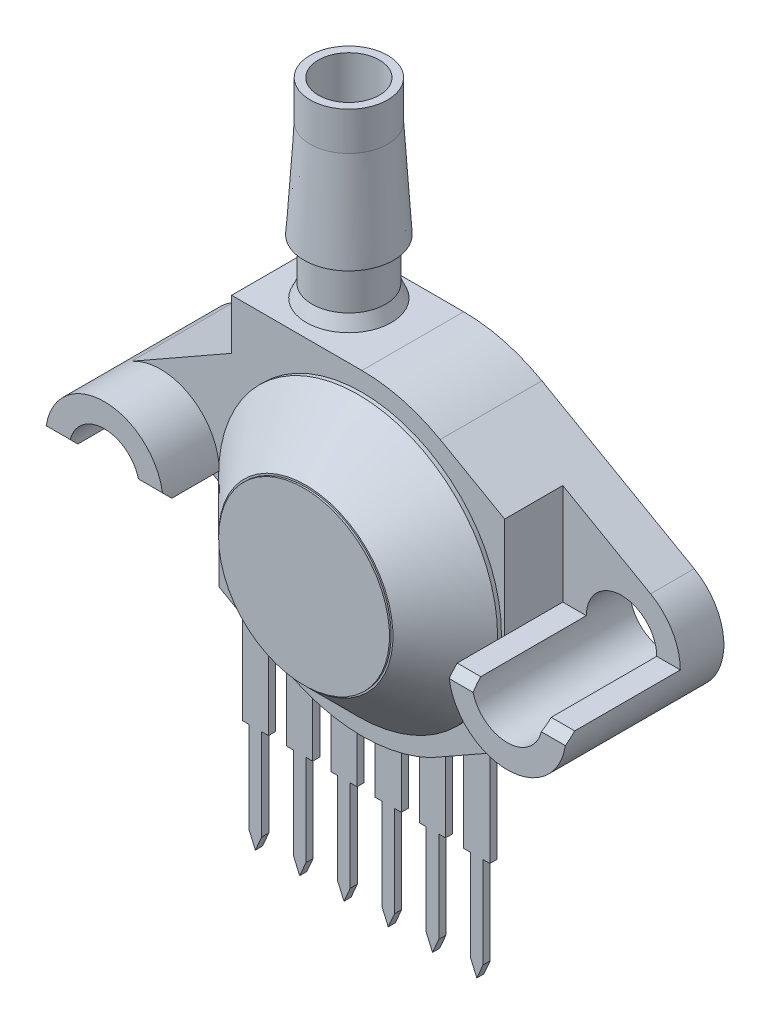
ISO-10303-21;
HEADER;
FILE_DESCRIPTION(('STEP AP214'),'2;1');
FILE_NAME('part.step','',(''),(''),'','','');
FILE_SCHEMA(('AUTOMOTIVE_DESIGN { 1 0 10303 214 1 1 1 1 }'));
ENDSEC;
DATA;
#1=APPLICATION_CONTEXT('core data for automotive mechanical design processes');
#2=APPLICATION_PROTOCOL_DEFINITION('international standard','automotive_design',2000,#1);
#3=PRODUCT_CONTEXT('',#1,'mechanical');
#4=PRODUCT('Part','Part','',(#3));
#5=PRODUCT_RELATED_PRODUCT_CATEGORY('part','',(#4));
#6=PRODUCT_DEFINITION_FORMATION('','',#4);
#7=PRODUCT_DEFINITION_CONTEXT('part definition',#1,'design');
#8=PRODUCT_DEFINITION('design','',#6,#7);
#9=PRODUCT_DEFINITION_SHAPE('','',#8);
#10=(LENGTH_UNIT() NAMED_UNIT(*) SI_UNIT(.MILLI.,.METRE.));
#11=(NAMED_UNIT(*) PLANE_ANGLE_UNIT() SI_UNIT($,.RADIAN.));
#12=(NAMED_UNIT(*) SI_UNIT($,.STERADIAN.) SOLID_ANGLE_UNIT());
#13=UNCERTAINTY_MEASURE_WITH_UNIT(LENGTH_MEASURE(1.E-05),#10,'distance_accuracy_value','');
#14=(GEOMETRIC_REPRESENTATION_CONTEXT(3) GLOBAL_UNCERTAINTY_ASSIGNED_CONTEXT((#13)) GLOBAL_UNIT_ASSIGNED_CONTEXT((#10,
#11,#12)) REPRESENTATION_CONTEXT('',''));
#15=CARTESIAN_POINT('',(0.,0.,0.));
#16=DIRECTION('',(0.,0.,1.));
#17=DIRECTION('',(1.,0.,0.));
#18=AXIS2_PLACEMENT_3D('',#15,#16,#17);
#19=CARTESIAN_POINT('',(331.470415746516,192.485482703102,0.));
#20=DIRECTION('',(0.,1.,0.));
#21=DIRECTION('',(0.,0.,1.));
#22=AXIS2_PLACEMENT_3D('',#19,#20,#21);
#23=PLANE('',#22);
#24=CARTESIAN_POINT('',(327.496162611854,192.485482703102,2.61));
#25=DIRECTION('',(0.,1.,0.));
#26=DIRECTION('',(0.,0.,1.));
#27=AXIS2_PLACEMENT_3D('',#24,#25,#26);
#28=CIRCLE('',#27,1.74999999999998);
#29=CARTESIAN_POINT('',(327.496162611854,192.485482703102,4.35999999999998));
#30=VERTEX_POINT('',#29);
#31=EDGE_CURVE('E654',#30,#30,#28,.T.);
#32=ORIENTED_EDGE('',*,*,#31,.T.);
#33=EDGE_LOOP('',(#32));
#34=FACE_BOUND('',#33,.T.);
#35=ADVANCED_FACE('F15',(#34),#23,.T.);
#36=CARTESIAN_POINT('',(327.496162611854,185.334519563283,2.61));
#37=DIRECTION('',(0.,1.,0.));
#38=DIRECTION('',(0.,0.,1.));
#39=AXIS2_PLACEMENT_3D('',#36,#37,#38);
#40=CYLINDRICAL_SURFACE('',#39,1.74999999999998);
#41=ORIENTED_EDGE('',*,*,#31,.F.);
#42=EDGE_LOOP('',(#41));
#43=FACE_BOUND('',#42,.T.);
#44=CARTESIAN_POINT('',(327.496162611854,203.434519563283,2.61));
#45=DIRECTION('',(0.,1.,0.));
#46=DIRECTION('',(0.,0.,1.));
#47=AXIS2_PLACEMENT_3D('',#44,#45,#46);
#48=CIRCLE('',#47,1.74999999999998);
#49=CARTESIAN_POINT('',(327.496162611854,203.434519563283,4.35999999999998));
#50=VERTEX_POINT('',#49);
#51=EDGE_CURVE('E651',#50,#50,#48,.T.);
#52=ORIENTED_EDGE('',*,*,#51,.T.);
#53=EDGE_LOOP('',(#52));
#54=FACE_BOUND('',#53,.T.);
#55=ADVANCED_FACE('F1065',(#43,#54),#40,.F.);
#56=CARTESIAN_POINT('',(331.470415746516,183.405482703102,9.155));
#57=DIRECTION('',(0.,0.,1.));
#58=DIRECTION('',(1.,0.,0.));
#59=AXIS2_PLACEMENT_3D('',#56,#57,#58);
#60=PLANE('',#59);
#61=CARTESIAN_POINT('',(331.470415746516,183.405482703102,9.155));
#62=DIRECTION('',(0.,0.,-1.));
#63=DIRECTION('',(-1.,0.,0.));
#64=AXIS2_PLACEMENT_3D('',#61,#62,#63);
#65=CIRCLE('',#64,4.90000000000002);
#66=CARTESIAN_POINT('',(326.570415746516,183.405482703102,9.155));
#67=VERTEX_POINT('',#66);
#68=EDGE_CURVE('E648',#67,#67,#65,.T.);
#69=ORIENTED_EDGE('',*,*,#68,.F.);
#70=EDGE_LOOP('',(#69));
#71=FACE_BOUND('',#70,.T.);
#72=ADVANCED_FACE('F1062',(#71),#60,.T.);
#73=CARTESIAN_POINT('',(327.496162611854,203.434519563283,2.61));
#74=DIRECTION('',(0.,-1.,0.));
#75=DIRECTION('',(0.,0.,-1.));
#76=AXIS2_PLACEMENT_3D('',#73,#74,#75);
#77=PLANE('',#76);
#78=CARTESIAN_POINT('',(327.496162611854,203.434519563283,2.61));
#79=DIRECTION('',(0.,1.,0.));
#80=DIRECTION('',(0.,0.,1.));
#81=AXIS2_PLACEMENT_3D('',#78,#79,#80);
#82=CIRCLE('',#81,2.22);
#83=CARTESIAN_POINT('',(327.496162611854,203.434519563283,4.83));
#84=VERTEX_POINT('',#83);
#85=EDGE_CURVE('E645',#84,#84,#82,.F.);
#86=ORIENTED_EDGE('',*,*,#85,.F.);
#87=EDGE_LOOP('',(#86));
#88=FACE_BOUND('',#87,.T.);
#89=ORIENTED_EDGE('',*,*,#51,.F.);
#90=EDGE_LOOP('',(#89));
#91=FACE_BOUND('',#90,.T.);
#92=ADVANCED_FACE('F1058',(#88,#91),#77,.F.);
#93=CARTESIAN_POINT('',(331.470415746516,183.405482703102,9.155));
#94=DIRECTION('',(0.,0.,-1.));
#95=DIRECTION('',(-1.,0.,0.));
#96=AXIS2_PLACEMENT_3D('',#93,#94,#95);
#97=CYLINDRICAL_SURFACE('',#96,4.90000000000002);
#98=CARTESIAN_POINT('',(331.470415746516,183.405482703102,9.055));
#99=DIRECTION('',(0.,0.,-1.));
#100=DIRECTION('',(-1.,0.,0.));
#101=AXIS2_PLACEMENT_3D('',#98,#99,#100);
#102=CIRCLE('',#101,4.90000000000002);
#103=CARTESIAN_POINT('',(326.570415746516,183.405482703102,9.055));
#104=VERTEX_POINT('',#103);
#105=EDGE_CURVE('E514',#104,#104,#102,.T.);
#106=ORIENTED_EDGE('',*,*,#105,.F.);
#107=EDGE_LOOP('',(#106));
#108=FACE_BOUND('',#107,.T.);
#109=ORIENTED_EDGE('',*,*,#68,.T.);
#110=EDGE_LOOP('',(#109));
#111=FACE_BOUND('',#110,.T.);
#112=ADVANCED_FACE('F1054',(#108,#111),#97,.T.);
#113=CARTESIAN_POINT('',(327.496162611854,210.623142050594,2.61));
#114=DIRECTION('',(0.,1.,0.));
#115=DIRECTION('',(0.,0.,1.));
#116=AXIS2_PLACEMENT_3D('',#113,#114,#115);
#117=CYLINDRICAL_SURFACE('',#116,2.22);
#118=CARTESIAN_POINT('',(327.496162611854,201.232551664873,2.61));
#119=DIRECTION('',(0.,-1.,0.));
#120=DIRECTION('',(0.,0.,-1.));
#121=AXIS2_PLACEMENT_3D('',#118,#119,#120);
#122=CIRCLE('',#121,2.219999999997);
#123=CARTESIAN_POINT('',(327.496162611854,201.232551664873,0.390000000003));
#124=VERTEX_POINT('',#123);
#125=EDGE_CURVE('E512',#124,#124,#122,.T.);
#126=ORIENTED_EDGE('',*,*,#125,.F.);
#127=EDGE_LOOP('',(#126));
#128=FACE_BOUND('',#127,.T.);
#129=ORIENTED_EDGE('',*,*,#85,.T.);
#130=EDGE_LOOP('',(#129));
#131=FACE_BOUND('',#130,.T.);
#132=ADVANCED_FACE('F1050',(#128,#131),#117,.T.);
#133=CARTESIAN_POINT('',(331.470415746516,183.405482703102,9.055));
#134=DIRECTION('',(0.,0.,1.));
#135=DIRECTION('',(1.,0.,0.));
#136=AXIS2_PLACEMENT_3D('',#133,#134,#135);
#137=PLANE('',#136);
#138=ORIENTED_EDGE('',*,*,#105,.T.);
#139=EDGE_LOOP('',(#138));
#140=FACE_BOUND('',#139,.T.);
#141=CARTESIAN_POINT('',(331.470415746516,183.405482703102,9.05499999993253));
#142=DIRECTION('',(0.,0.,-1.));
#143=DIRECTION('',(-1.,0.,0.));
#144=AXIS2_PLACEMENT_3D('',#141,#142,#143);
#145=CIRCLE('',#144,4.99999999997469);
#146=CARTESIAN_POINT('',(326.470415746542,183.405482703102,9.05499999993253));
#147=VERTEX_POINT('',#146);
#148=EDGE_CURVE('E632',#147,#147,#145,.T.);
#149=ORIENTED_EDGE('',*,*,#148,.F.);
#150=EDGE_LOOP('',(#149));
#151=FACE_BOUND('',#150,.T.);
#152=ADVANCED_FACE('F1046',(#140,#151),#137,.T.);
#153=CARTESIAN_POINT('',(327.496162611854,195.645271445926,2.61));
#154=DIRECTION('',(0.,-1.,0.));
#155=DIRECTION('',(0.,0.,-1.));
#156=AXIS2_PLACEMENT_3D('',#153,#154,#155);
#157=CONICAL_SURFACE('',#156,2.56992964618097,0.0625479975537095);
#158=ORIENTED_EDGE('',*,*,#125,.T.);
#159=EDGE_LOOP('',(#158));
#160=FACE_BOUND('',#159,.T.);
#161=CARTESIAN_POINT('',(327.496162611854,195.645271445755,2.61));
#162=DIRECTION('',(0.,-1.,0.));
#163=DIRECTION('',(0.,0.,-1.));
#164=AXIS2_PLACEMENT_3D('',#161,#162,#163);
#165=CIRCLE('',#164,2.56992964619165);
#166=CARTESIAN_POINT('',(327.496162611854,195.645271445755,0.0400703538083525));
#167=VERTEX_POINT('',#166);
#168=EDGE_CURVE('E628',#167,#167,#165,.F.);
#169=ORIENTED_EDGE('',*,*,#168,.T.);
#170=EDGE_LOOP('',(#169));
#171=FACE_BOUND('',#170,.T.);
#172=ADVANCED_FACE('F1043',(#160,#171),#157,.T.);
#173=CARTESIAN_POINT('',(0.,0.,5.175));
#174=DIRECTION('',(0.,0.,1.));
#175=DIRECTION('',(1.,0.,0.));
#176=AXIS2_PLACEMENT_3D('',#173,#174,#175);
#177=PLANE('',#176);
#178=DIRECTION('',(-0.870345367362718,0.49244181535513,0.));
#179=VECTOR('',#178,1.);
#180=CARTESIAN_POINT('',(325.858533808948,176.170837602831,5.175));
#181=LINE('',#180,#179);
#182=CARTESIAN_POINT('',(325.858533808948,176.170837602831,5.175));
#183=VERTEX_POINT('',#182);
#184=CARTESIAN_POINT('',(324.358533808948,177.019538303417,5.175));
#185=VERTEX_POINT('',#184);
#186=EDGE_CURVE('E291',#183,#185,#181,.T.);
#187=ORIENTED_EDGE('',*,*,#186,.F.);
#188=DIRECTION('',(0.,1.,0.));
#189=VECTOR('',#188,1.);
#190=CARTESIAN_POINT('',(325.858533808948,171.416518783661,5.175));
#191=LINE('',#190,#189);
#192=CARTESIAN_POINT('',(325.858533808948,171.416518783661,5.175));
#193=VERTEX_POINT('',#192);
#194=EDGE_CURVE('E1776',#183,#193,#191,.F.);
#195=ORIENTED_EDGE('',*,*,#194,.T.);
#196=DIRECTION('',(1.,0.,0.));
#197=VECTOR('',#196,1.);
#198=CARTESIAN_POINT('',(325.858533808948,171.416518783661,5.175));
#199=LINE('',#198,#197);
#200=CARTESIAN_POINT('',(325.468533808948,171.416518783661,5.175));
#201=VERTEX_POINT('',#200);
#202=EDGE_CURVE('E1784',#193,#201,#199,.F.);
#203=ORIENTED_EDGE('',*,*,#202,.T.);
#204=DIRECTION('',(0.,1.,0.));
#205=VECTOR('',#204,1.);
#206=CARTESIAN_POINT('',(325.468533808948,171.416518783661,5.175));
#207=LINE('',#206,#205);
#208=CARTESIAN_POINT('',(325.468533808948,166.181207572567,5.175));
#209=VERTEX_POINT('',#208);
#210=EDGE_CURVE('E1790',#201,#209,#207,.F.);
#211=ORIENTED_EDGE('',*,*,#210,.T.);
#212=DIRECTION('',(-0.398394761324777,-0.917214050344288,0.));
#213=VECTOR('',#212,1.);
#214=CARTESIAN_POINT('',(325.468533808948,166.181207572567,5.175));
#215=LINE('',#214,#213);
#216=CARTESIAN_POINT('',(325.108533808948,165.352388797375,5.175));
#217=VERTEX_POINT('',#216);
#218=EDGE_CURVE('E1796',#209,#217,#215,.T.);
#219=ORIENTED_EDGE('',*,*,#218,.T.);
#220=DIRECTION('',(-0.398394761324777,0.917214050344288,0.));
#221=VECTOR('',#220,1.);
#222=CARTESIAN_POINT('',(324.748533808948,166.181207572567,5.175));
#223=LINE('',#222,#221);
#224=CARTESIAN_POINT('',(324.748533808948,166.181207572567,5.175));
#225=VERTEX_POINT('',#224);
#226=EDGE_CURVE('E1802',#217,#225,#223,.T.);
#227=ORIENTED_EDGE('',*,*,#226,.T.);
#228=DIRECTION('',(0.,1.,0.));
#229=VECTOR('',#228,1.);
#230=CARTESIAN_POINT('',(324.748533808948,171.416518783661,5.175));
#231=LINE('',#230,#229);
#232=CARTESIAN_POINT('',(324.748533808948,171.416518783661,5.175));
#233=VERTEX_POINT('',#232);
#234=EDGE_CURVE('E1808',#225,#233,#231,.T.);
#235=ORIENTED_EDGE('',*,*,#234,.T.);
#236=DIRECTION('',(1.,0.,0.));
#237=VECTOR('',#236,1.);
#238=CARTESIAN_POINT('',(324.748533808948,171.416518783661,5.175));
#239=LINE('',#238,#237);
#240=CARTESIAN_POINT('',(324.358533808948,171.416518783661,5.175));
#241=VERTEX_POINT('',#240);
#242=EDGE_CURVE('E1814',#233,#241,#239,.F.);
#243=ORIENTED_EDGE('',*,*,#242,.T.);
#244=DIRECTION('',(0.,1.,0.));
#245=VECTOR('',#244,1.);
#246=CARTESIAN_POINT('',(324.358533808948,171.416518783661,5.175));
#247=LINE('',#246,#245);
#248=EDGE_CURVE('E631',#241,#185,#247,.T.);
#249=ORIENTED_EDGE('',*,*,#248,.T.);
#250=EDGE_LOOP('',(#187,#195,#203,#211,#219,#227,#235,#243,#249));
#251=FACE_BOUND('',#250,.T.);
#252=ADVANCED_FACE('F1040',(#251),#177,.F.);
#253=CARTESIAN_POINT('',(0.,0.,5.585));
#254=DIRECTION('',(0.,0.,1.));
#255=DIRECTION('',(1.,0.,0.));
#256=AXIS2_PLACEMENT_3D('',#253,#254,#255);
#257=PLANE('',#256);
#258=DIRECTION('',(1.,0.,0.));
#259=VECTOR('',#258,1.);
#260=CARTESIAN_POINT('',(328.398533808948,171.416518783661,5.585));
#261=LINE('',#260,#259);
#262=CARTESIAN_POINT('',(328.008533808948,171.416518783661,5.585));
#263=VERTEX_POINT('',#262);
#264=CARTESIAN_POINT('',(328.398533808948,171.416518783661,5.585));
#265=VERTEX_POINT('',#264);
#266=EDGE_CURVE('E231',#263,#265,#261,.T.);
#267=ORIENTED_EDGE('',*,*,#266,.T.);
#268=DIRECTION('',(0.,1.,0.));
#269=VECTOR('',#268,1.);
#270=CARTESIAN_POINT('',(328.398533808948,171.416518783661,5.585));
#271=LINE('',#270,#269);
#272=CARTESIAN_POINT('',(328.398533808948,174.860897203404,5.585));
#273=VERTEX_POINT('',#272);
#274=EDGE_CURVE('E487',#265,#273,#271,.T.);
#275=ORIENTED_EDGE('',*,*,#274,.T.);
#276=CARTESIAN_POINT('',(331.470415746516,183.405482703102,5.585));
#277=DIRECTION('',(0.,0.,-1.));
#278=DIRECTION('',(-1.,0.,0.));
#279=AXIS2_PLACEMENT_3D('',#276,#277,#278);
#280=CIRCLE('',#279,9.07999999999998);
#281=CARTESIAN_POINT('',(327.530878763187,175.224624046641,5.585));
#282=VERTEX_POINT('',#281);
#283=EDGE_CURVE('E219',#273,#282,#280,.T.);
#284=ORIENTED_EDGE('',*,*,#283,.T.);
#285=DIRECTION('',(-0.870345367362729,0.492441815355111,0.));
#286=VECTOR('',#285,1.);
#287=CARTESIAN_POINT('',(327.530878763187,175.224624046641,5.585));
#288=LINE('',#287,#286);
#289=CARTESIAN_POINT('',(326.898533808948,175.582405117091,5.585));
#290=VERTEX_POINT('',#289);
#291=EDGE_CURVE('E282',#282,#290,#288,.T.);
#292=ORIENTED_EDGE('',*,*,#291,.T.);
#293=DIRECTION('',(0.,1.,0.));
#294=VECTOR('',#293,1.);
#295=CARTESIAN_POINT('',(326.898533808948,171.416518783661,5.585));
#296=LINE('',#295,#294);
#297=CARTESIAN_POINT('',(326.898533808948,171.416518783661,5.585));
#298=VERTEX_POINT('',#297);
#299=EDGE_CURVE('E508',#290,#298,#296,.F.);
#300=ORIENTED_EDGE('',*,*,#299,.T.);
#301=DIRECTION('',(1.,0.,0.));
#302=VECTOR('',#301,1.);
#303=CARTESIAN_POINT('',(327.288533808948,171.416518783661,5.585));
#304=LINE('',#303,#302);
#305=CARTESIAN_POINT('',(327.288533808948,171.416518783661,5.585));
#306=VERTEX_POINT('',#305);
#307=EDGE_CURVE('E505',#298,#306,#304,.T.);
#308=ORIENTED_EDGE('',*,*,#307,.T.);
#309=DIRECTION('',(0.,1.,0.));
#310=VECTOR('',#309,1.);
#311=CARTESIAN_POINT('',(327.288533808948,171.416518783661,5.585));
#312=LINE('',#311,#310);
#313=CARTESIAN_POINT('',(327.288533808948,166.181207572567,5.585));
#314=VERTEX_POINT('',#313);
#315=EDGE_CURVE('E502',#306,#314,#312,.F.);
#316=ORIENTED_EDGE('',*,*,#315,.T.);
#317=DIRECTION('',(-0.398394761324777,0.917214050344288,0.));
#318=VECTOR('',#317,1.);
#319=CARTESIAN_POINT('',(327.288533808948,166.181207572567,5.585));
#320=LINE('',#319,#318);
#321=CARTESIAN_POINT('',(327.648533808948,165.352388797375,5.585));
#322=VERTEX_POINT('',#321);
#323=EDGE_CURVE('E499',#314,#322,#320,.F.);
#324=ORIENTED_EDGE('',*,*,#323,.T.);
#325=DIRECTION('',(-0.398394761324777,-0.917214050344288,0.));
#326=VECTOR('',#325,1.);
#327=CARTESIAN_POINT('',(328.008533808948,166.181207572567,5.585));
#328=LINE('',#327,#326);
#329=CARTESIAN_POINT('',(328.008533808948,166.181207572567,5.585));
#330=VERTEX_POINT('',#329);
#331=EDGE_CURVE('E496',#322,#330,#328,.F.);
#332=ORIENTED_EDGE('',*,*,#331,.T.);
#333=DIRECTION('',(0.,1.,0.));
#334=VECTOR('',#333,1.);
#335=CARTESIAN_POINT('',(328.008533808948,171.416518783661,5.585));
#336=LINE('',#335,#334);
#337=EDGE_CURVE('E493',#330,#263,#336,.T.);
#338=ORIENTED_EDGE('',*,*,#337,.T.);
#339=EDGE_LOOP('',(#267,#275,#284,#292,#300,#308,#316,#324,#332,#338));
#340=FACE_BOUND('',#339,.T.);
#341=ADVANCED_FACE('F1037',(#340),#257,.T.);
#342=CARTESIAN_POINT('',(0.,0.,5.585));
#343=DIRECTION('',(0.,0.,1.));
#344=DIRECTION('',(1.,0.,0.));
#345=AXIS2_PLACEMENT_3D('',#342,#343,#344);
#346=PLANE('',#345);
#347=DIRECTION('',(1.,0.,0.));
#348=VECTOR('',#347,1.);
#349=CARTESIAN_POINT('',(330.938533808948,171.416518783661,5.585));
#350=LINE('',#349,#348);
#351=CARTESIAN_POINT('',(330.548533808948,171.416518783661,5.585));
#352=VERTEX_POINT('',#351);
#353=CARTESIAN_POINT('',(330.938533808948,171.416518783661,5.585));
#354=VERTEX_POINT('',#353);
#355=EDGE_CURVE('E473',#352,#354,#350,.T.);
#356=ORIENTED_EDGE('',*,*,#355,.T.);
#357=DIRECTION('',(0.,1.,0.));
#358=VECTOR('',#357,1.);
#359=CARTESIAN_POINT('',(330.938533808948,171.416518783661,5.585));
#360=LINE('',#359,#358);
#361=CARTESIAN_POINT('',(330.938533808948,174.341074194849,5.585));
#362=VERTEX_POINT('',#361);
#363=EDGE_CURVE('E470',#354,#362,#360,.T.);
#364=ORIENTED_EDGE('',*,*,#363,.T.);
#365=CARTESIAN_POINT('',(331.470415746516,183.405482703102,5.585));
#366=DIRECTION('',(0.,0.,-1.));
#367=DIRECTION('',(-1.,0.,0.));
#368=AXIS2_PLACEMENT_3D('',#365,#366,#367);
#369=CIRCLE('',#368,9.07999999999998);
#370=CARTESIAN_POINT('',(329.438533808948,174.555745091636,5.585));
#371=VERTEX_POINT('',#370);
#372=EDGE_CURVE('E460',#362,#371,#369,.T.);
#373=ORIENTED_EDGE('',*,*,#372,.T.);
#374=DIRECTION('',(0.,1.,0.));
#375=VECTOR('',#374,1.);
#376=CARTESIAN_POINT('',(329.438533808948,171.416518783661,5.585));
#377=LINE('',#376,#375);
#378=CARTESIAN_POINT('',(329.438533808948,171.416518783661,5.585));
#379=VERTEX_POINT('',#378);
#380=EDGE_CURVE('E451',#371,#379,#377,.F.);
#381=ORIENTED_EDGE('',*,*,#380,.T.);
#382=DIRECTION('',(1.,0.,0.));
#383=VECTOR('',#382,1.);
#384=CARTESIAN_POINT('',(329.828533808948,171.416518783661,5.585));
#385=LINE('',#384,#383);
#386=CARTESIAN_POINT('',(329.828533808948,171.416518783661,5.585));
#387=VERTEX_POINT('',#386);
#388=EDGE_CURVE('E436',#379,#387,#385,.T.);
#389=ORIENTED_EDGE('',*,*,#388,.T.);
#390=DIRECTION('',(0.,1.,0.));
#391=VECTOR('',#390,1.);
#392=CARTESIAN_POINT('',(329.828533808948,171.416518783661,5.585));
#393=LINE('',#392,#391);
#394=CARTESIAN_POINT('',(329.828533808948,166.181207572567,5.585));
#395=VERTEX_POINT('',#394);
#396=EDGE_CURVE('E485',#387,#395,#393,.F.);
#397=ORIENTED_EDGE('',*,*,#396,.T.);
#398=DIRECTION('',(-0.398394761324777,0.917214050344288,0.));
#399=VECTOR('',#398,1.);
#400=CARTESIAN_POINT('',(329.828533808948,166.181207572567,5.585));
#401=LINE('',#400,#399);
#402=CARTESIAN_POINT('',(330.188533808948,165.352388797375,5.585));
#403=VERTEX_POINT('',#402);
#404=EDGE_CURVE('E482',#395,#403,#401,.F.);
#405=ORIENTED_EDGE('',*,*,#404,.T.);
#406=DIRECTION('',(-0.398394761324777,-0.917214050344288,0.));
#407=VECTOR('',#406,1.);
#408=CARTESIAN_POINT('',(330.548533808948,166.181207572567,5.585));
#409=LINE('',#408,#407);
#410=CARTESIAN_POINT('',(330.548533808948,166.181207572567,5.585));
#411=VERTEX_POINT('',#410);
#412=EDGE_CURVE('E479',#403,#411,#409,.F.);
#413=ORIENTED_EDGE('',*,*,#412,.T.);
#414=DIRECTION('',(0.,1.,0.));
#415=VECTOR('',#414,1.);
#416=CARTESIAN_POINT('',(330.548533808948,171.416518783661,5.585));
#417=LINE('',#416,#415);
#418=EDGE_CURVE('E476',#411,#352,#417,.T.);
#419=ORIENTED_EDGE('',*,*,#418,.T.);
#420=EDGE_LOOP('',(#356,#364,#373,#381,#389,#397,#405,#413,#419));
#421=FACE_BOUND('',#420,.T.);
#422=ADVANCED_FACE('F458',(#421),#346,.T.);
#423=CARTESIAN_POINT('',(0.,0.,5.585));
#424=DIRECTION('',(0.,0.,1.));
#425=DIRECTION('',(1.,0.,0.));
#426=AXIS2_PLACEMENT_3D('',#423,#424,#425);
#427=PLANE('',#426);
#428=DIRECTION('',(1.,0.,0.));
#429=VECTOR('',#428,1.);
#430=CARTESIAN_POINT('',(333.478533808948,171.416518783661,5.585));
#431=LINE('',#430,#429);
#432=CARTESIAN_POINT('',(333.088533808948,171.416518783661,5.585));
#433=VERTEX_POINT('',#432);
#434=CARTESIAN_POINT('',(333.478533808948,171.416518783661,5.585));
#435=VERTEX_POINT('',#434);
#436=EDGE_CURVE('E1660',#433,#435,#431,.T.);
#437=ORIENTED_EDGE('',*,*,#436,.T.);
#438=DIRECTION('',(0.,1.,0.));
#439=VECTOR('',#438,1.);
#440=CARTESIAN_POINT('',(333.478533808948,171.416518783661,5.585));
#441=LINE('',#440,#439);
#442=CARTESIAN_POINT('',(333.478533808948,174.550322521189,5.585));
#443=VERTEX_POINT('',#442);
#444=EDGE_CURVE('E1662',#435,#443,#441,.T.);
#445=ORIENTED_EDGE('',*,*,#444,.T.);
#446=CARTESIAN_POINT('',(331.470415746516,183.405482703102,5.585));
#447=DIRECTION('',(0.,0.,-1.));
#448=DIRECTION('',(-1.,0.,0.));
#449=AXIS2_PLACEMENT_3D('',#446,#447,#448);
#450=CIRCLE('',#449,9.07999999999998);
#451=CARTESIAN_POINT('',(331.978533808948,174.339711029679,5.585));
#452=VERTEX_POINT('',#451);
#453=EDGE_CURVE('E639',#443,#452,#450,.T.);
#454=ORIENTED_EDGE('',*,*,#453,.T.);
#455=DIRECTION('',(0.,1.,0.));
#456=VECTOR('',#455,1.);
#457=CARTESIAN_POINT('',(331.978533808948,171.416518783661,5.585));
#458=LINE('',#457,#456);
#459=CARTESIAN_POINT('',(331.978533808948,171.416518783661,5.585));
#460=VERTEX_POINT('',#459);
#461=EDGE_CURVE('E1865',#452,#460,#458,.F.);
#462=ORIENTED_EDGE('',*,*,#461,.T.);
#463=DIRECTION('',(1.,0.,0.));
#464=VECTOR('',#463,1.);
#465=CARTESIAN_POINT('',(332.368533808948,171.416518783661,5.585));
#466=LINE('',#465,#464);
#467=CARTESIAN_POINT('',(332.368533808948,171.416518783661,5.585));
#468=VERTEX_POINT('',#467);
#469=EDGE_CURVE('E461',#460,#468,#466,.T.);
#470=ORIENTED_EDGE('',*,*,#469,.T.);
#471=DIRECTION('',(0.,1.,0.));
#472=VECTOR('',#471,1.);
#473=CARTESIAN_POINT('',(332.368533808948,171.416518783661,5.585));
#474=LINE('',#473,#472);
#475=CARTESIAN_POINT('',(332.368533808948,166.181207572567,5.585));
#476=VERTEX_POINT('',#475);
#477=EDGE_CURVE('E467',#468,#476,#474,.F.);
#478=ORIENTED_EDGE('',*,*,#477,.T.);
#479=DIRECTION('',(-0.398394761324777,0.917214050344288,0.));
#480=VECTOR('',#479,1.);
#481=CARTESIAN_POINT('',(332.368533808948,166.181207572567,5.585));
#482=LINE('',#481,#480);
#483=CARTESIAN_POINT('',(332.728533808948,165.352388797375,5.585));
#484=VERTEX_POINT('',#483);
#485=EDGE_CURVE('E1699',#476,#484,#482,.F.);
#486=ORIENTED_EDGE('',*,*,#485,.T.);
#487=DIRECTION('',(-0.398394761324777,-0.917214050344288,0.));
#488=VECTOR('',#487,1.);
#489=CARTESIAN_POINT('',(333.088533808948,166.181207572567,5.585));
#490=LINE('',#489,#488);
#491=CARTESIAN_POINT('',(333.088533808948,166.181207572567,5.585));
#492=VERTEX_POINT('',#491);
#493=EDGE_CURVE('E1692',#484,#492,#490,.F.);
#494=ORIENTED_EDGE('',*,*,#493,.T.);
#495=DIRECTION('',(0.,1.,0.));
#496=VECTOR('',#495,1.);
#497=CARTESIAN_POINT('',(333.088533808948,171.416518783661,5.585));
#498=LINE('',#497,#496);
#499=EDGE_CURVE('E1664',#492,#433,#498,.T.);
#500=ORIENTED_EDGE('',*,*,#499,.T.);
#501=EDGE_LOOP('',(#437,#445,#454,#462,#470,#478,#486,#494,#500));
#502=FACE_BOUND('',#501,.T.);
#503=ADVANCED_FACE('F1030',(#502),#427,.T.);
#504=CARTESIAN_POINT('',(0.,0.,5.175));
#505=DIRECTION('',(0.,0.,1.));
#506=DIRECTION('',(1.,0.,0.));
#507=AXIS2_PLACEMENT_3D('',#504,#505,#506);
#508=PLANE('',#507);
#509=CARTESIAN_POINT('',(331.470415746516,183.405482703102,5.175));
#510=DIRECTION('',(0.,0.,-1.));
#511=DIRECTION('',(-1.,0.,0.));
#512=AXIS2_PLACEMENT_3D('',#509,#510,#511);
#513=CIRCLE('',#512,9.07999999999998);
#514=CARTESIAN_POINT('',(335.409952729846,175.224624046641,5.175));
#515=VERTEX_POINT('',#514);
#516=CARTESIAN_POINT('',(334.518533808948,174.852391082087,5.175));
#517=VERTEX_POINT('',#516);
#518=EDGE_CURVE('E636',#515,#517,#513,.T.);
#519=ORIENTED_EDGE('',*,*,#518,.F.);
#520=DIRECTION('',(-0.870345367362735,-0.492441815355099,0.));
#521=VECTOR('',#520,1.);
#522=CARTESIAN_POINT('',(336.018533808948,175.56895950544,5.175));
#523=LINE('',#522,#521);
#524=CARTESIAN_POINT('',(336.018533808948,175.56895950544,5.175));
#525=VERTEX_POINT('',#524);
#526=EDGE_CURVE('E638',#525,#515,#523,.T.);
#527=ORIENTED_EDGE('',*,*,#526,.F.);
#528=DIRECTION('',(0.,1.,0.));
#529=VECTOR('',#528,1.);
#530=CARTESIAN_POINT('',(336.018533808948,171.416518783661,5.175));
#531=LINE('',#530,#529);
#532=CARTESIAN_POINT('',(336.018533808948,171.416518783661,5.175));
#533=VERTEX_POINT('',#532);
#534=EDGE_CURVE('E1831',#525,#533,#531,.F.);
#535=ORIENTED_EDGE('',*,*,#534,.T.);
#536=DIRECTION('',(1.,0.,0.));
#537=VECTOR('',#536,1.);
#538=CARTESIAN_POINT('',(336.018533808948,171.416518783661,5.175));
#539=LINE('',#538,#537);
#540=CARTESIAN_POINT('',(335.628533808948,171.416518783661,5.175));
#541=VERTEX_POINT('',#540);
#542=EDGE_CURVE('E1836',#533,#541,#539,.F.);
#543=ORIENTED_EDGE('',*,*,#542,.T.);
#544=DIRECTION('',(0.,1.,0.));
#545=VECTOR('',#544,1.);
#546=CARTESIAN_POINT('',(335.628533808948,171.416518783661,5.175));
#547=LINE('',#546,#545);
#548=CARTESIAN_POINT('',(335.628533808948,166.181207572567,5.175));
#549=VERTEX_POINT('',#548);
#550=EDGE_CURVE('E1841',#541,#549,#547,.F.);
#551=ORIENTED_EDGE('',*,*,#550,.T.);
#552=DIRECTION('',(-0.398394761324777,-0.917214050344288,0.));
#553=VECTOR('',#552,1.);
#554=CARTESIAN_POINT('',(335.628533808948,166.181207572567,5.175));
#555=LINE('',#554,#553);
#556=CARTESIAN_POINT('',(335.268533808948,165.352388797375,5.175));
#557=VERTEX_POINT('',#556);
#558=EDGE_CURVE('E1845',#549,#557,#555,.T.);
#559=ORIENTED_EDGE('',*,*,#558,.T.);
#560=DIRECTION('',(-0.398394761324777,0.917214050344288,0.));
#561=VECTOR('',#560,1.);
#562=CARTESIAN_POINT('',(334.908533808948,166.181207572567,5.175));
#563=LINE('',#562,#561);
#564=CARTESIAN_POINT('',(334.908533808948,166.181207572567,5.175));
#565=VERTEX_POINT('',#564);
#566=EDGE_CURVE('E1849',#557,#565,#563,.T.);
#567=ORIENTED_EDGE('',*,*,#566,.T.);
#568=DIRECTION('',(0.,1.,0.));
#569=VECTOR('',#568,1.);
#570=CARTESIAN_POINT('',(334.908533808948,171.416518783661,5.175));
#571=LINE('',#570,#569);
#572=CARTESIAN_POINT('',(334.908533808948,171.416518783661,5.175));
#573=VERTEX_POINT('',#572);
#574=EDGE_CURVE('E1853',#565,#573,#571,.T.);
#575=ORIENTED_EDGE('',*,*,#574,.T.);
#576=DIRECTION('',(1.,0.,0.));
#577=VECTOR('',#576,1.);
#578=CARTESIAN_POINT('',(334.908533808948,171.416518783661,5.175));
#579=LINE('',#578,#577);
#580=CARTESIAN_POINT('',(334.518533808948,171.416518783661,5.175));
#581=VERTEX_POINT('',#580);
#582=EDGE_CURVE('E1857',#573,#581,#579,.F.);
#583=ORIENTED_EDGE('',*,*,#582,.T.);
#584=DIRECTION('',(0.,1.,0.));
#585=VECTOR('',#584,1.);
#586=CARTESIAN_POINT('',(334.518533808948,171.416518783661,5.175));
#587=LINE('',#586,#585);
#588=EDGE_CURVE('E1861',#581,#517,#587,.T.);
#589=ORIENTED_EDGE('',*,*,#588,.T.);
#590=EDGE_LOOP('',(#519,#527,#535,#543,#551,#559,#567,#575,#583,#589));
#591=FACE_BOUND('',#590,.T.);
#592=ADVANCED_FACE('F1026',(#591),#508,.F.);
#593=CARTESIAN_POINT('',(0.,0.,5.175));
#594=DIRECTION('',(0.,0.,1.));
#595=DIRECTION('',(1.,0.,0.));
#596=AXIS2_PLACEMENT_3D('',#593,#594,#595);
#597=PLANE('',#596);
#598=DIRECTION('',(-0.870345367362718,-0.49244181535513,0.));
#599=VECTOR('',#598,1.);
#600=CARTESIAN_POINT('',(338.558533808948,177.006092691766,5.175));
#601=LINE('',#600,#599);
#602=CARTESIAN_POINT('',(338.558533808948,177.006092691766,5.175));
#603=VERTEX_POINT('',#602);
#604=CARTESIAN_POINT('',(337.058533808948,176.15739199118,5.175));
#605=VERTEX_POINT('',#604);
#606=EDGE_CURVE('E635',#603,#605,#601,.T.);
#607=ORIENTED_EDGE('',*,*,#606,.F.);
#608=DIRECTION('',(0.,1.,0.));
#609=VECTOR('',#608,1.);
#610=CARTESIAN_POINT('',(338.558533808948,171.416518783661,5.175));
#611=LINE('',#610,#609);
#612=CARTESIAN_POINT('',(338.558533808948,171.416518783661,5.175));
#613=VERTEX_POINT('',#612);
#614=EDGE_CURVE('E1826',#603,#613,#611,.F.);
#615=ORIENTED_EDGE('',*,*,#614,.T.);
#616=DIRECTION('',(1.,0.,0.));
#617=VECTOR('',#616,1.);
#618=CARTESIAN_POINT('',(338.558533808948,171.416518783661,5.175));
#619=LINE('',#618,#617);
#620=CARTESIAN_POINT('',(338.168533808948,171.416518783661,5.175));
#621=VERTEX_POINT('',#620);
#622=EDGE_CURVE('E1961',#613,#621,#619,.F.);
#623=ORIENTED_EDGE('',*,*,#622,.T.);
#624=DIRECTION('',(0.,1.,0.));
#625=VECTOR('',#624,1.);
#626=CARTESIAN_POINT('',(338.168533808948,171.416518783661,5.175));
#627=LINE('',#626,#625);
#628=CARTESIAN_POINT('',(338.168533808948,166.181207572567,5.175));
#629=VERTEX_POINT('',#628);
#630=EDGE_CURVE('E1955',#621,#629,#627,.F.);
#631=ORIENTED_EDGE('',*,*,#630,.T.);
#632=DIRECTION('',(-0.398394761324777,-0.917214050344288,0.));
#633=VECTOR('',#632,1.);
#634=CARTESIAN_POINT('',(338.168533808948,166.181207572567,5.175));
#635=LINE('',#634,#633);
#636=CARTESIAN_POINT('',(337.808533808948,165.352388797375,5.175));
#637=VERTEX_POINT('',#636);
#638=EDGE_CURVE('E1949',#629,#637,#635,.T.);
#639=ORIENTED_EDGE('',*,*,#638,.T.);
#640=DIRECTION('',(-0.398394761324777,0.917214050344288,0.));
#641=VECTOR('',#640,1.);
#642=CARTESIAN_POINT('',(337.448533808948,166.181207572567,5.175));
#643=LINE('',#642,#641);
#644=CARTESIAN_POINT('',(337.448533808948,166.181207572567,5.175));
#645=VERTEX_POINT('',#644);
#646=EDGE_CURVE('E1943',#637,#645,#643,.T.);
#647=ORIENTED_EDGE('',*,*,#646,.T.);
#648=DIRECTION('',(0.,1.,0.));
#649=VECTOR('',#648,1.);
#650=CARTESIAN_POINT('',(337.448533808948,171.416518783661,5.175));
#651=LINE('',#650,#649);
#652=CARTESIAN_POINT('',(337.448533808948,171.416518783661,5.175));
#653=VERTEX_POINT('',#652);
#654=EDGE_CURVE('E1937',#645,#653,#651,.T.);
#655=ORIENTED_EDGE('',*,*,#654,.T.);
#656=DIRECTION('',(1.,0.,0.));
#657=VECTOR('',#656,1.);
#658=CARTESIAN_POINT('',(337.448533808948,171.416518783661,5.175));
#659=LINE('',#658,#657);
#660=CARTESIAN_POINT('',(337.058533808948,171.416518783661,5.175));
#661=VERTEX_POINT('',#660);
#662=EDGE_CURVE('E1931',#653,#661,#659,.F.);
#663=ORIENTED_EDGE('',*,*,#662,.T.);
#664=DIRECTION('',(0.,1.,0.));
#665=VECTOR('',#664,1.);
#666=CARTESIAN_POINT('',(337.058533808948,171.416518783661,5.175));
#667=LINE('',#666,#665);
#668=EDGE_CURVE('E1834',#661,#605,#667,.T.);
#669=ORIENTED_EDGE('',*,*,#668,.T.);
#670=EDGE_LOOP('',(#607,#615,#623,#631,#639,#647,#655,#663,#669));
#671=FACE_BOUND('',#670,.T.);
#672=ADVANCED_FACE('F1022',(#671),#597,.F.);
#673=CARTESIAN_POINT('',(331.470415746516,183.405482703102,6.05500000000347));
#674=DIRECTION('',(0.,0.,-1.));
#675=DIRECTION('',(-1.,0.,0.));
#676=AXIS2_PLACEMENT_3D('',#673,#674,#675);
#677=CONICAL_SURFACE('',#676,7.99999999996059,0.785398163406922);
#678=CARTESIAN_POINT('',(331.470415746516,183.405482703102,6.05500000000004));
#679=DIRECTION('',(0.,0.,-1.));
#680=DIRECTION('',(-1.,0.,0.));
#681=AXIS2_PLACEMENT_3D('',#678,#679,#680);
#682=CIRCLE('',#681,8.00000000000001);
#683=CARTESIAN_POINT('',(323.470415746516,183.405482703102,6.05500000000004));
#684=VERTEX_POINT('',#683);
#685=EDGE_CURVE('E627',#684,#684,#682,.T.);
#686=ORIENTED_EDGE('',*,*,#685,.F.);
#687=EDGE_LOOP('',(#686));
#688=FACE_BOUND('',#687,.T.);
#689=ORIENTED_EDGE('',*,*,#148,.T.);
#690=EDGE_LOOP('',(#689));
#691=FACE_BOUND('',#690,.T.);
#692=ADVANCED_FACE('F1018',(#688,#691),#677,.T.);
#693=CARTESIAN_POINT('',(330.066092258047,195.645271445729,2.61));
#694=DIRECTION('',(0.,1.,0.));
#695=DIRECTION('',(0.,0.,1.));
#696=AXIS2_PLACEMENT_3D('',#693,#694,#695);
#697=PLANE('',#696);
#698=CARTESIAN_POINT('',(327.496162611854,195.645271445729,2.61));
#699=DIRECTION('',(0.,1.,0.));
#700=DIRECTION('',(0.,0.,1.));
#701=AXIS2_PLACEMENT_3D('',#698,#699,#700);
#702=CIRCLE('',#701,2.11145536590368);
#703=CARTESIAN_POINT('',(327.496162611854,195.645271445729,4.72145536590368));
#704=VERTEX_POINT('',#703);
#705=EDGE_CURVE('E623',#704,#704,#702,.F.);
#706=ORIENTED_EDGE('',*,*,#705,.F.);
#707=EDGE_LOOP('',(#706));
#708=FACE_BOUND('',#707,.T.);
#709=ORIENTED_EDGE('',*,*,#168,.F.);
#710=EDGE_LOOP('',(#709));
#711=FACE_BOUND('',#710,.T.);
#712=ADVANCED_FACE('F1014',(#708,#711),#697,.F.);
#713=CARTESIAN_POINT('',(324.358533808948,171.416518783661,5.585));
#714=DIRECTION('',(1.,0.,0.));
#715=DIRECTION('',(0.,0.,-1.));
#716=AXIS2_PLACEMENT_3D('',#713,#714,#715);
#717=PLANE('',#716);
#718=DIRECTION('',(0.,0.,-1.));
#719=VECTOR('',#718,1.);
#720=CARTESIAN_POINT('',(324.358533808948,177.019538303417,5.585));
#721=LINE('',#720,#719);
#722=CARTESIAN_POINT('',(324.358533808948,177.019538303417,5.585));
#723=VERTEX_POINT('',#722);
#724=EDGE_CURVE('E1820',#185,#723,#721,.F.);
#725=ORIENTED_EDGE('',*,*,#724,.F.);
#726=ORIENTED_EDGE('',*,*,#248,.F.);
#727=DIRECTION('',(0.,0.,1.));
#728=VECTOR('',#727,1.);
#729=CARTESIAN_POINT('',(324.358533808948,171.416518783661,5.585));
#730=LINE('',#729,#728);
#731=CARTESIAN_POINT('',(324.358533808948,171.416518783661,5.585));
#732=VERTEX_POINT('',#731);
#733=EDGE_CURVE('E1817',#241,#732,#730,.T.);
#734=ORIENTED_EDGE('',*,*,#733,.T.);
#735=DIRECTION('',(0.,1.,0.));
#736=VECTOR('',#735,1.);
#737=CARTESIAN_POINT('',(324.358533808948,0.,5.585));
#738=LINE('',#737,#736);
#739=EDGE_CURVE('E626',#723,#732,#738,.F.);
#740=ORIENTED_EDGE('',*,*,#739,.F.);
#741=EDGE_LOOP('',(#725,#726,#734,#740));
#742=FACE_BOUND('',#741,.T.);
#743=ADVANCED_FACE('F1010',(#742),#717,.F.);
#744=CARTESIAN_POINT('',(324.748533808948,171.416518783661,5.585));
#745=DIRECTION('',(0.,1.,0.));
#746=DIRECTION('',(0.,0.,1.));
#747=AXIS2_PLACEMENT_3D('',#744,#745,#746);
#748=PLANE('',#747);
#749=DIRECTION('',(0.,0.,-1.));
#750=VECTOR('',#749,1.);
#751=CARTESIAN_POINT('',(324.748533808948,171.416518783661,5.585));
#752=LINE('',#751,#750);
#753=CARTESIAN_POINT('',(324.748533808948,171.416518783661,5.585));
#754=VERTEX_POINT('',#753);
#755=EDGE_CURVE('E1811',#233,#754,#752,.F.);
#756=ORIENTED_EDGE('',*,*,#755,.T.);
#757=DIRECTION('',(1.,0.,0.));
#758=VECTOR('',#757,1.);
#759=CARTESIAN_POINT('',(0.,171.416518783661,5.585));
#760=LINE('',#759,#758);
#761=EDGE_CURVE('E1989',#732,#754,#760,.T.);
#762=ORIENTED_EDGE('',*,*,#761,.F.);
#763=ORIENTED_EDGE('',*,*,#733,.F.);
#764=ORIENTED_EDGE('',*,*,#242,.F.);
#765=EDGE_LOOP('',(#756,#762,#763,#764));
#766=FACE_BOUND('',#765,.T.);
#767=ADVANCED_FACE('F1006',(#766),#748,.F.);
#768=CARTESIAN_POINT('',(324.748533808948,171.416518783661,5.585));
#769=DIRECTION('',(1.,0.,0.));
#770=DIRECTION('',(0.,0.,-1.));
#771=AXIS2_PLACEMENT_3D('',#768,#769,#770);
#772=PLANE('',#771);
#773=DIRECTION('',(0.,0.,1.));
#774=VECTOR('',#773,1.);
#775=CARTESIAN_POINT('',(324.748533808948,166.181207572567,5.585));
#776=LINE('',#775,#774);
#777=CARTESIAN_POINT('',(324.748533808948,166.181207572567,5.585));
#778=VERTEX_POINT('',#777);
#779=EDGE_CURVE('E1805',#225,#778,#776,.T.);
#780=ORIENTED_EDGE('',*,*,#779,.T.);
#781=DIRECTION('',(0.,1.,0.));
#782=VECTOR('',#781,1.);
#783=CARTESIAN_POINT('',(324.748533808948,0.,5.585));
#784=LINE('',#783,#782);
#785=EDGE_CURVE('E1992',#754,#778,#784,.F.);
#786=ORIENTED_EDGE('',*,*,#785,.F.);
#787=ORIENTED_EDGE('',*,*,#755,.F.);
#788=ORIENTED_EDGE('',*,*,#234,.F.);
#789=EDGE_LOOP('',(#780,#786,#787,#788));
#790=FACE_BOUND('',#789,.T.);
#791=ADVANCED_FACE('F1002',(#790),#772,.F.);
#792=CARTESIAN_POINT('',(324.748533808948,166.181207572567,5.585));
#793=DIRECTION('',(0.917214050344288,0.398394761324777,0.));
#794=DIRECTION('',(-0.398394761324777,0.917214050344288,0.));
#795=AXIS2_PLACEMENT_3D('',#792,#793,#794);
#796=PLANE('',#795);
#797=DIRECTION('',(0.,0.,1.));
#798=VECTOR('',#797,1.);
#799=CARTESIAN_POINT('',(325.108533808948,165.352388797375,5.585));
#800=LINE('',#799,#798);
#801=CARTESIAN_POINT('',(325.108533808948,165.352388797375,5.585));
#802=VERTEX_POINT('',#801);
#803=EDGE_CURVE('E1799',#217,#802,#800,.T.);
#804=ORIENTED_EDGE('',*,*,#803,.T.);
#805=DIRECTION('',(0.398394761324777,-0.917214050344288,0.));
#806=VECTOR('',#805,1.);
#807=CARTESIAN_POINT('',(324.748533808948,166.181207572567,5.585));
#808=LINE('',#807,#806);
#809=EDGE_CURVE('E1995',#778,#802,#808,.T.);
#810=ORIENTED_EDGE('',*,*,#809,.F.);
#811=ORIENTED_EDGE('',*,*,#779,.F.);
#812=ORIENTED_EDGE('',*,*,#226,.F.);
#813=EDGE_LOOP('',(#804,#810,#811,#812));
#814=FACE_BOUND('',#813,.T.);
#815=ADVANCED_FACE('F998',(#814),#796,.F.);
#816=CARTESIAN_POINT('',(325.468533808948,166.181207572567,5.585));
#817=DIRECTION('',(-0.917214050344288,0.398394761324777,0.));
#818=DIRECTION('',(-0.398394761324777,-0.917214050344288,0.));
#819=AXIS2_PLACEMENT_3D('',#816,#817,#818);
#820=PLANE('',#819);
#821=DIRECTION('',(0.,0.,1.));
#822=VECTOR('',#821,1.);
#823=CARTESIAN_POINT('',(325.468533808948,166.181207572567,5.585));
#824=LINE('',#823,#822);
#825=CARTESIAN_POINT('',(325.468533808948,166.181207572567,5.585));
#826=VERTEX_POINT('',#825);
#827=EDGE_CURVE('E1793',#209,#826,#824,.T.);
#828=ORIENTED_EDGE('',*,*,#827,.T.);
#829=DIRECTION('',(0.398394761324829,0.917214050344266,0.));
#830=VECTOR('',#829,1.);
#831=CARTESIAN_POINT('',(325.108533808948,165.352388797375,5.585));
#832=LINE('',#831,#830);
#833=EDGE_CURVE('E1998',#802,#826,#832,.T.);
#834=ORIENTED_EDGE('',*,*,#833,.F.);
#835=ORIENTED_EDGE('',*,*,#803,.F.);
#836=ORIENTED_EDGE('',*,*,#218,.F.);
#837=EDGE_LOOP('',(#828,#834,#835,#836));
#838=FACE_BOUND('',#837,.T.);
#839=ADVANCED_FACE('F994',(#838),#820,.F.);
#840=CARTESIAN_POINT('',(325.468533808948,171.416518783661,5.585));
#841=DIRECTION('',(-1.,0.,0.));
#842=DIRECTION('',(0.,0.,1.));
#843=AXIS2_PLACEMENT_3D('',#840,#841,#842);
#844=PLANE('',#843);
#845=DIRECTION('',(0.,0.,1.));
#846=VECTOR('',#845,1.);
#847=CARTESIAN_POINT('',(325.468533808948,171.416518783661,5.585));
#848=LINE('',#847,#846);
#849=CARTESIAN_POINT('',(325.468533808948,171.416518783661,5.585));
#850=VERTEX_POINT('',#849);
#851=EDGE_CURVE('E1787',#201,#850,#848,.T.);
#852=ORIENTED_EDGE('',*,*,#851,.T.);
#853=DIRECTION('',(0.,1.,0.));
#854=VECTOR('',#853,1.);
#855=CARTESIAN_POINT('',(325.468533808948,0.,5.585));
#856=LINE('',#855,#854);
#857=EDGE_CURVE('E2001',#826,#850,#856,.T.);
#858=ORIENTED_EDGE('',*,*,#857,.F.);
#859=ORIENTED_EDGE('',*,*,#827,.F.);
#860=ORIENTED_EDGE('',*,*,#210,.F.);
#861=EDGE_LOOP('',(#852,#858,#859,#860));
#862=FACE_BOUND('',#861,.T.);
#863=ADVANCED_FACE('F990',(#862),#844,.F.);
#864=CARTESIAN_POINT('',(325.858533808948,171.416518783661,5.585));
#865=DIRECTION('',(0.,1.,0.));
#866=DIRECTION('',(0.,0.,1.));
#867=AXIS2_PLACEMENT_3D('',#864,#865,#866);
#868=PLANE('',#867);
#869=DIRECTION('',(0.,0.,1.));
#870=VECTOR('',#869,1.);
#871=CARTESIAN_POINT('',(325.858533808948,171.416518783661,5.585));
#872=LINE('',#871,#870);
#873=CARTESIAN_POINT('',(325.858533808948,171.416518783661,5.585));
#874=VERTEX_POINT('',#873);
#875=EDGE_CURVE('E1781',#193,#874,#872,.T.);
#876=ORIENTED_EDGE('',*,*,#875,.T.);
#877=DIRECTION('',(1.,0.,0.));
#878=VECTOR('',#877,1.);
#879=CARTESIAN_POINT('',(0.,171.416518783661,5.585));
#880=LINE('',#879,#878);
#881=EDGE_CURVE('E2004',#850,#874,#880,.T.);
#882=ORIENTED_EDGE('',*,*,#881,.F.);
#883=ORIENTED_EDGE('',*,*,#851,.F.);
#884=ORIENTED_EDGE('',*,*,#202,.F.);
#885=EDGE_LOOP('',(#876,#882,#883,#884));
#886=FACE_BOUND('',#885,.T.);
#887=ADVANCED_FACE('F986',(#886),#868,.F.);
#888=CARTESIAN_POINT('',(325.858533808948,171.416518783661,5.585));
#889=DIRECTION('',(-1.,0.,0.));
#890=DIRECTION('',(0.,0.,1.));
#891=AXIS2_PLACEMENT_3D('',#888,#889,#890);
#892=PLANE('',#891);
#893=DIRECTION('',(0.,0.,1.));
#894=VECTOR('',#893,1.);
#895=CARTESIAN_POINT('',(325.858533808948,176.170837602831,5.585));
#896=LINE('',#895,#894);
#897=CARTESIAN_POINT('',(325.858533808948,176.170837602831,5.585));
#898=VERTEX_POINT('',#897);
#899=EDGE_CURVE('E1778',#898,#183,#896,.F.);
#900=ORIENTED_EDGE('',*,*,#899,.F.);
#901=DIRECTION('',(0.,1.,0.));
#902=VECTOR('',#901,1.);
#903=CARTESIAN_POINT('',(325.858533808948,0.,5.585));
#904=LINE('',#903,#902);
#905=EDGE_CURVE('E2007',#874,#898,#904,.T.);
#906=ORIENTED_EDGE('',*,*,#905,.F.);
#907=ORIENTED_EDGE('',*,*,#875,.F.);
#908=ORIENTED_EDGE('',*,*,#194,.F.);
#909=EDGE_LOOP('',(#900,#906,#907,#908));
#910=FACE_BOUND('',#909,.T.);
#911=ADVANCED_FACE('F982',(#910),#892,.F.);
#912=CARTESIAN_POINT('',(326.898533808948,171.416518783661,5.585));
#913=DIRECTION('',(1.,0.,0.));
#914=DIRECTION('',(0.,0.,-1.));
#915=AXIS2_PLACEMENT_3D('',#912,#913,#914);
#916=PLANE('',#915);
#917=DIRECTION('',(0.,0.,-1.));
#918=VECTOR('',#917,1.);
#919=CARTESIAN_POINT('',(326.898533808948,175.582405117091,5.585));
#920=LINE('',#919,#918);
#921=CARTESIAN_POINT('',(326.898533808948,175.582405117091,5.175));
#922=VERTEX_POINT('',#921);
#923=EDGE_CURVE('E510',#922,#290,#920,.F.);
#924=ORIENTED_EDGE('',*,*,#923,.F.);
#925=DIRECTION('',(0.,1.,0.));
#926=VECTOR('',#925,1.);
#927=CARTESIAN_POINT('',(326.898533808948,0.,5.175));
#928=LINE('',#927,#926);
#929=CARTESIAN_POINT('',(326.898533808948,171.416518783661,5.175));
#930=VERTEX_POINT('',#929);
#931=EDGE_CURVE('E1771',#922,#930,#928,.F.);
#932=ORIENTED_EDGE('',*,*,#931,.T.);
#933=DIRECTION('',(0.,0.,1.));
#934=VECTOR('',#933,1.);
#935=CARTESIAN_POINT('',(326.898533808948,171.416518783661,5.585));
#936=LINE('',#935,#934);
#937=EDGE_CURVE('E507',#930,#298,#936,.T.);
#938=ORIENTED_EDGE('',*,*,#937,.T.);
#939=ORIENTED_EDGE('',*,*,#299,.F.);
#940=EDGE_LOOP('',(#924,#932,#938,#939));
#941=FACE_BOUND('',#940,.T.);
#942=ADVANCED_FACE('F978',(#941),#916,.F.);
#943=CARTESIAN_POINT('',(327.288533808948,171.416518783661,5.585));
#944=DIRECTION('',(0.,1.,0.));
#945=DIRECTION('',(0.,0.,1.));
#946=AXIS2_PLACEMENT_3D('',#943,#944,#945);
#947=PLANE('',#946);
#948=DIRECTION('',(0.,0.,-1.));
#949=VECTOR('',#948,1.);
#950=CARTESIAN_POINT('',(327.288533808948,171.416518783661,5.585));
#951=LINE('',#950,#949);
#952=CARTESIAN_POINT('',(327.288533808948,171.416518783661,5.175));
#953=VERTEX_POINT('',#952);
#954=EDGE_CURVE('E504',#953,#306,#951,.F.);
#955=ORIENTED_EDGE('',*,*,#954,.T.);
#956=ORIENTED_EDGE('',*,*,#307,.F.);
#957=ORIENTED_EDGE('',*,*,#937,.F.);
#958=DIRECTION('',(1.,0.,0.));
#959=VECTOR('',#958,1.);
#960=CARTESIAN_POINT('',(0.,171.416518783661,5.175));
#961=LINE('',#960,#959);
#962=EDGE_CURVE('E1766',#930,#953,#961,.T.);
#963=ORIENTED_EDGE('',*,*,#962,.T.);
#964=EDGE_LOOP('',(#955,#956,#957,#963));
#965=FACE_BOUND('',#964,.T.);
#966=ADVANCED_FACE('F974',(#965),#947,.F.);
#967=CARTESIAN_POINT('',(327.288533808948,171.416518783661,5.585));
#968=DIRECTION('',(1.,0.,0.));
#969=DIRECTION('',(0.,0.,-1.));
#970=AXIS2_PLACEMENT_3D('',#967,#968,#969);
#971=PLANE('',#970);
#972=DIRECTION('',(0.,0.,1.));
#973=VECTOR('',#972,1.);
#974=CARTESIAN_POINT('',(327.288533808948,166.181207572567,5.585));
#975=LINE('',#974,#973);
#976=CARTESIAN_POINT('',(327.288533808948,166.181207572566,5.175));
#977=VERTEX_POINT('',#976);
#978=EDGE_CURVE('E501',#977,#314,#975,.T.);
#979=ORIENTED_EDGE('',*,*,#978,.T.);
#980=ORIENTED_EDGE('',*,*,#315,.F.);
#981=ORIENTED_EDGE('',*,*,#954,.F.);
#982=DIRECTION('',(0.,1.,0.));
#983=VECTOR('',#982,1.);
#984=CARTESIAN_POINT('',(327.288533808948,0.,5.175));
#985=LINE('',#984,#983);
#986=EDGE_CURVE('E1761',#953,#977,#985,.F.);
#987=ORIENTED_EDGE('',*,*,#986,.T.);
#988=EDGE_LOOP('',(#979,#980,#981,#987));
#989=FACE_BOUND('',#988,.T.);
#990=ADVANCED_FACE('F970',(#989),#971,.F.);
#991=CARTESIAN_POINT('',(327.288533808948,166.181207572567,5.585));
#992=DIRECTION('',(0.917214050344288,0.398394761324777,0.));
#993=DIRECTION('',(-0.398394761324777,0.917214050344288,0.));
#994=AXIS2_PLACEMENT_3D('',#991,#992,#993);
#995=PLANE('',#994);
#996=DIRECTION('',(0.,0.,1.));
#997=VECTOR('',#996,1.);
#998=CARTESIAN_POINT('',(327.648533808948,165.352388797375,5.585));
#999=LINE('',#998,#997);
#1000=CARTESIAN_POINT('',(327.648533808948,165.352388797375,5.175));
#1001=VERTEX_POINT('',#1000);
#1002=EDGE_CURVE('E498',#1001,#322,#999,.T.);
#1003=ORIENTED_EDGE('',*,*,#1002,.T.);
#1004=ORIENTED_EDGE('',*,*,#323,.F.);
#1005=ORIENTED_EDGE('',*,*,#978,.F.);
#1006=DIRECTION('',(0.398394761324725,-0.91721405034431,0.));
#1007=VECTOR('',#1006,1.);
#1008=CARTESIAN_POINT('',(327.288533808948,166.181207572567,5.175));
#1009=LINE('',#1008,#1007);
#1010=EDGE_CURVE('E1756',#977,#1001,#1009,.T.);
#1011=ORIENTED_EDGE('',*,*,#1010,.T.);
#1012=EDGE_LOOP('',(#1003,#1004,#1005,#1011));
#1013=FACE_BOUND('',#1012,.T.);
#1014=ADVANCED_FACE('F966',(#1013),#995,.F.);
#1015=CARTESIAN_POINT('',(328.008533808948,166.181207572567,5.585));
#1016=DIRECTION('',(-0.917214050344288,0.398394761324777,0.));
#1017=DIRECTION('',(-0.398394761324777,-0.917214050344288,0.));
#1018=AXIS2_PLACEMENT_3D('',#1015,#1016,#1017);
#1019=PLANE('',#1018);
#1020=DIRECTION('',(0.,0.,1.));
#1021=VECTOR('',#1020,1.);
#1022=CARTESIAN_POINT('',(328.008533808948,166.181207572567,5.585));
#1023=LINE('',#1022,#1021);
#1024=CARTESIAN_POINT('',(328.008533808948,166.181207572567,5.175));
#1025=VERTEX_POINT('',#1024);
#1026=EDGE_CURVE('E495',#1025,#330,#1023,.T.);
#1027=ORIENTED_EDGE('',*,*,#1026,.T.);
#1028=ORIENTED_EDGE('',*,*,#331,.F.);
#1029=ORIENTED_EDGE('',*,*,#1002,.F.);
#1030=DIRECTION('',(0.398394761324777,0.917214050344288,0.));
#1031=VECTOR('',#1030,1.);
#1032=CARTESIAN_POINT('',(327.648533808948,165.352388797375,5.175));
#1033=LINE('',#1032,#1031);
#1034=EDGE_CURVE('E1751',#1001,#1025,#1033,.T.);
#1035=ORIENTED_EDGE('',*,*,#1034,.T.);
#1036=EDGE_LOOP('',(#1027,#1028,#1029,#1035));
#1037=FACE_BOUND('',#1036,.T.);
#1038=ADVANCED_FACE('F962',(#1037),#1019,.F.);
#1039=CARTESIAN_POINT('',(328.008533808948,171.416518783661,5.585));
#1040=DIRECTION('',(-1.,0.,0.));
#1041=DIRECTION('',(0.,0.,1.));
#1042=AXIS2_PLACEMENT_3D('',#1039,#1040,#1041);
#1043=PLANE('',#1042);
#1044=DIRECTION('',(0.,0.,1.));
#1045=VECTOR('',#1044,1.);
#1046=CARTESIAN_POINT('',(328.008533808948,171.416518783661,5.585));
#1047=LINE('',#1046,#1045);
#1048=CARTESIAN_POINT('',(328.008533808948,171.416518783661,5.175));
#1049=VERTEX_POINT('',#1048);
#1050=EDGE_CURVE('E492',#1049,#263,#1047,.T.);
#1051=ORIENTED_EDGE('',*,*,#1050,.T.);
#1052=ORIENTED_EDGE('',*,*,#337,.F.);
#1053=ORIENTED_EDGE('',*,*,#1026,.F.);
#1054=DIRECTION('',(0.,1.,0.));
#1055=VECTOR('',#1054,1.);
#1056=CARTESIAN_POINT('',(328.008533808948,0.,5.175));
#1057=LINE('',#1056,#1055);
#1058=EDGE_CURVE('E1746',#1025,#1049,#1057,.T.);
#1059=ORIENTED_EDGE('',*,*,#1058,.T.);
#1060=EDGE_LOOP('',(#1051,#1052,#1053,#1059));
#1061=FACE_BOUND('',#1060,.T.);
#1062=ADVANCED_FACE('F958',(#1061),#1043,.F.);
#1063=CARTESIAN_POINT('',(328.398533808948,171.416518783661,5.585));
#1064=DIRECTION('',(0.,1.,0.));
#1065=DIRECTION('',(0.,0.,1.));
#1066=AXIS2_PLACEMENT_3D('',#1063,#1064,#1065);
#1067=PLANE('',#1066);
#1068=DIRECTION('',(0.,0.,1.));
#1069=VECTOR('',#1068,1.);
#1070=CARTESIAN_POINT('',(328.398533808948,171.416518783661,5.585));
#1071=LINE('',#1070,#1069);
#1072=CARTESIAN_POINT('',(328.398533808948,171.416518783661,5.175));
#1073=VERTEX_POINT('',#1072);
#1074=EDGE_CURVE('E489',#1073,#265,#1071,.T.);
#1075=ORIENTED_EDGE('',*,*,#1074,.T.);
#1076=ORIENTED_EDGE('',*,*,#266,.F.);
#1077=ORIENTED_EDGE('',*,*,#1050,.F.);
#1078=DIRECTION('',(1.,0.,0.));
#1079=VECTOR('',#1078,1.);
#1080=CARTESIAN_POINT('',(0.,171.416518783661,5.175));
#1081=LINE('',#1080,#1079);
#1082=EDGE_CURVE('E1743',#1049,#1073,#1081,.T.);
#1083=ORIENTED_EDGE('',*,*,#1082,.T.);
#1084=EDGE_LOOP('',(#1075,#1076,#1077,#1083));
#1085=FACE_BOUND('',#1084,.T.);
#1086=ADVANCED_FACE('F954',(#1085),#1067,.F.);
#1087=CARTESIAN_POINT('',(328.398533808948,171.416518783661,5.585));
#1088=DIRECTION('',(-1.,0.,0.));
#1089=DIRECTION('',(0.,0.,1.));
#1090=AXIS2_PLACEMENT_3D('',#1087,#1088,#1089);
#1091=PLANE('',#1090);
#1092=DIRECTION('',(0.,0.,1.));
#1093=VECTOR('',#1092,1.);
#1094=CARTESIAN_POINT('',(328.398533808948,174.860897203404,5.585));
#1095=LINE('',#1094,#1093);
#1096=CARTESIAN_POINT('',(328.398533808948,174.860897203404,5.175));
#1097=VERTEX_POINT('',#1096);
#1098=EDGE_CURVE('E446',#273,#1097,#1095,.F.);
#1099=ORIENTED_EDGE('',*,*,#1098,.F.);
#1100=ORIENTED_EDGE('',*,*,#274,.F.);
#1101=ORIENTED_EDGE('',*,*,#1074,.F.);
#1102=DIRECTION('',(0.,1.,0.));
#1103=VECTOR('',#1102,1.);
#1104=CARTESIAN_POINT('',(328.398533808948,0.,5.175));
#1105=LINE('',#1104,#1103);
#1106=EDGE_CURVE('E622',#1073,#1097,#1105,.T.);
#1107=ORIENTED_EDGE('',*,*,#1106,.T.);
#1108=EDGE_LOOP('',(#1099,#1100,#1101,#1107));
#1109=FACE_BOUND('',#1108,.T.);
#1110=ADVANCED_FACE('F951',(#1109),#1091,.F.);
#1111=CARTESIAN_POINT('',(329.828533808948,171.416518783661,5.585));
#1112=DIRECTION('',(0.,1.,0.));
#1113=DIRECTION('',(0.,0.,1.));
#1114=AXIS2_PLACEMENT_3D('',#1111,#1112,#1113);
#1115=PLANE('',#1114);
#1116=DIRECTION('',(0.,0.,-1.));
#1117=VECTOR('',#1116,1.);
#1118=CARTESIAN_POINT('',(329.828533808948,171.416518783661,5.585));
#1119=LINE('',#1118,#1117);
#1120=CARTESIAN_POINT('',(329.828533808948,171.416518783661,5.175));
#1121=VERTEX_POINT('',#1120);
#1122=EDGE_CURVE('E442',#1121,#387,#1119,.F.);
#1123=ORIENTED_EDGE('',*,*,#1122,.T.);
#1124=ORIENTED_EDGE('',*,*,#388,.F.);
#1125=DIRECTION('',(0.,0.,-1.));
#1126=VECTOR('',#1125,1.);
#1127=CARTESIAN_POINT('',(329.438533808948,171.416518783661,5.585));
#1128=LINE('',#1127,#1126);
#1129=CARTESIAN_POINT('',(329.438533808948,171.416518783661,5.175));
#1130=VERTEX_POINT('',#1129);
#1131=EDGE_CURVE('E440',#379,#1130,#1128,.T.);
#1132=ORIENTED_EDGE('',*,*,#1131,.T.);
#1133=DIRECTION('',(1.,0.,0.));
#1134=VECTOR('',#1133,1.);
#1135=CARTESIAN_POINT('',(0.,171.416518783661,5.175));
#1136=LINE('',#1135,#1134);
#1137=EDGE_CURVE('E621',#1130,#1121,#1136,.T.);
#1138=ORIENTED_EDGE('',*,*,#1137,.T.);
#1139=EDGE_LOOP('',(#1123,#1124,#1132,#1138));
#1140=FACE_BOUND('',#1139,.T.);
#1141=ADVANCED_FACE('F438',(#1140),#1115,.F.);
#1142=CARTESIAN_POINT('',(329.828533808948,171.416518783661,5.585));
#1143=DIRECTION('',(1.,0.,0.));
#1144=DIRECTION('',(0.,0.,-1.));
#1145=AXIS2_PLACEMENT_3D('',#1142,#1143,#1144);
#1146=PLANE('',#1145);
#1147=DIRECTION('',(0.,0.,1.));
#1148=VECTOR('',#1147,1.);
#1149=CARTESIAN_POINT('',(329.828533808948,166.181207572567,5.585));
#1150=LINE('',#1149,#1148);
#1151=CARTESIAN_POINT('',(329.828533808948,166.181207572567,5.175));
#1152=VERTEX_POINT('',#1151);
#1153=EDGE_CURVE('E484',#1152,#395,#1150,.T.);
#1154=ORIENTED_EDGE('',*,*,#1153,.T.);
#1155=ORIENTED_EDGE('',*,*,#396,.F.);
#1156=ORIENTED_EDGE('',*,*,#1122,.F.);
#1157=DIRECTION('',(0.,1.,0.));
#1158=VECTOR('',#1157,1.);
#1159=CARTESIAN_POINT('',(329.828533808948,0.,5.175));
#1160=LINE('',#1159,#1158);
#1161=EDGE_CURVE('E1712',#1121,#1152,#1160,.F.);
#1162=ORIENTED_EDGE('',*,*,#1161,.T.);
#1163=EDGE_LOOP('',(#1154,#1155,#1156,#1162));
#1164=FACE_BOUND('',#1163,.T.);
#1165=ADVANCED_FACE('F944',(#1164),#1146,.F.);
#1166=CARTESIAN_POINT('',(329.828533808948,166.181207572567,5.585));
#1167=DIRECTION('',(0.917214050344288,0.398394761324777,0.));
#1168=DIRECTION('',(-0.398394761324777,0.917214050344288,0.));
#1169=AXIS2_PLACEMENT_3D('',#1166,#1167,#1168);
#1170=PLANE('',#1169);
#1171=DIRECTION('',(0.,0.,1.));
#1172=VECTOR('',#1171,1.);
#1173=CARTESIAN_POINT('',(330.188533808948,165.352388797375,5.585));
#1174=LINE('',#1173,#1172);
#1175=CARTESIAN_POINT('',(330.188533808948,165.352388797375,5.175));
#1176=VERTEX_POINT('',#1175);
#1177=EDGE_CURVE('E481',#1176,#403,#1174,.T.);
#1178=ORIENTED_EDGE('',*,*,#1177,.T.);
#1179=ORIENTED_EDGE('',*,*,#404,.F.);
#1180=ORIENTED_EDGE('',*,*,#1153,.F.);
#1181=DIRECTION('',(0.398394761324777,-0.917214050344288,0.));
#1182=VECTOR('',#1181,1.);
#1183=CARTESIAN_POINT('',(329.828533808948,166.181207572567,5.175));
#1184=LINE('',#1183,#1182);
#1185=EDGE_CURVE('E1730',#1152,#1176,#1184,.T.);
#1186=ORIENTED_EDGE('',*,*,#1185,.T.);
#1187=EDGE_LOOP('',(#1178,#1179,#1180,#1186));
#1188=FACE_BOUND('',#1187,.T.);
#1189=ADVANCED_FACE('F940',(#1188),#1170,.F.);
#1190=CARTESIAN_POINT('',(330.548533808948,166.181207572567,5.585));
#1191=DIRECTION('',(-0.917214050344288,0.398394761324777,0.));
#1192=DIRECTION('',(-0.398394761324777,-0.917214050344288,0.));
#1193=AXIS2_PLACEMENT_3D('',#1190,#1191,#1192);
#1194=PLANE('',#1193);
#1195=DIRECTION('',(0.,0.,1.));
#1196=VECTOR('',#1195,1.);
#1197=CARTESIAN_POINT('',(330.548533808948,166.181207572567,5.585));
#1198=LINE('',#1197,#1196);
#1199=CARTESIAN_POINT('',(330.548533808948,166.181207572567,5.175));
#1200=VERTEX_POINT('',#1199);
#1201=EDGE_CURVE('E478',#1200,#411,#1198,.T.);
#1202=ORIENTED_EDGE('',*,*,#1201,.T.);
#1203=ORIENTED_EDGE('',*,*,#412,.F.);
#1204=ORIENTED_EDGE('',*,*,#1177,.F.);
#1205=DIRECTION('',(0.398394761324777,0.917214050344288,0.));
#1206=VECTOR('',#1205,1.);
#1207=CARTESIAN_POINT('',(330.188533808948,165.352388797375,5.175));
#1208=LINE('',#1207,#1206);
#1209=EDGE_CURVE('E1725',#1176,#1200,#1208,.T.);
#1210=ORIENTED_EDGE('',*,*,#1209,.T.);
#1211=EDGE_LOOP('',(#1202,#1203,#1204,#1210));
#1212=FACE_BOUND('',#1211,.T.);
#1213=ADVANCED_FACE('F936',(#1212),#1194,.F.);
#1214=CARTESIAN_POINT('',(330.548533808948,171.416518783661,5.585));
#1215=DIRECTION('',(-1.,0.,0.));
#1216=DIRECTION('',(0.,0.,1.));
#1217=AXIS2_PLACEMENT_3D('',#1214,#1215,#1216);
#1218=PLANE('',#1217);
#1219=DIRECTION('',(0.,0.,1.));
#1220=VECTOR('',#1219,1.);
#1221=CARTESIAN_POINT('',(330.548533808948,171.416518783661,5.585));
#1222=LINE('',#1221,#1220);
#1223=CARTESIAN_POINT('',(330.548533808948,171.416518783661,5.175));
#1224=VERTEX_POINT('',#1223);
#1225=EDGE_CURVE('E475',#1224,#352,#1222,.T.);
#1226=ORIENTED_EDGE('',*,*,#1225,.T.);
#1227=ORIENTED_EDGE('',*,*,#418,.F.);
#1228=ORIENTED_EDGE('',*,*,#1201,.F.);
#1229=DIRECTION('',(0.,1.,0.));
#1230=VECTOR('',#1229,1.);
#1231=CARTESIAN_POINT('',(330.548533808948,0.,5.175));
#1232=LINE('',#1231,#1230);
#1233=EDGE_CURVE('E1720',#1200,#1224,#1232,.T.);
#1234=ORIENTED_EDGE('',*,*,#1233,.T.);
#1235=EDGE_LOOP('',(#1226,#1227,#1228,#1234));
#1236=FACE_BOUND('',#1235,.T.);
#1237=ADVANCED_FACE('F932',(#1236),#1218,.F.);
#1238=CARTESIAN_POINT('',(330.938533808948,171.416518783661,5.585));
#1239=DIRECTION('',(0.,1.,0.));
#1240=DIRECTION('',(0.,0.,1.));
#1241=AXIS2_PLACEMENT_3D('',#1238,#1239,#1240);
#1242=PLANE('',#1241);
#1243=DIRECTION('',(0.,0.,1.));
#1244=VECTOR('',#1243,1.);
#1245=CARTESIAN_POINT('',(330.938533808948,171.416518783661,5.585));
#1246=LINE('',#1245,#1244);
#1247=CARTESIAN_POINT('',(330.938533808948,171.416518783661,5.175));
#1248=VERTEX_POINT('',#1247);
#1249=EDGE_CURVE('E472',#1248,#354,#1246,.T.);
#1250=ORIENTED_EDGE('',*,*,#1249,.T.);
#1251=ORIENTED_EDGE('',*,*,#355,.F.);
#1252=ORIENTED_EDGE('',*,*,#1225,.F.);
#1253=DIRECTION('',(1.,0.,0.));
#1254=VECTOR('',#1253,1.);
#1255=CARTESIAN_POINT('',(0.,171.416518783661,5.175));
#1256=LINE('',#1255,#1254);
#1257=EDGE_CURVE('E1716',#1224,#1248,#1256,.T.);
#1258=ORIENTED_EDGE('',*,*,#1257,.T.);
#1259=EDGE_LOOP('',(#1250,#1251,#1252,#1258));
#1260=FACE_BOUND('',#1259,.T.);
#1261=ADVANCED_FACE('F928',(#1260),#1242,.F.);
#1262=CARTESIAN_POINT('',(330.938533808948,171.416518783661,5.585));
#1263=DIRECTION('',(-1.,0.,0.));
#1264=DIRECTION('',(0.,0.,1.));
#1265=AXIS2_PLACEMENT_3D('',#1262,#1263,#1264);
#1266=PLANE('',#1265);
#1267=DIRECTION('',(0.,0.,1.));
#1268=VECTOR('',#1267,1.);
#1269=CARTESIAN_POINT('',(330.938533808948,174.341074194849,5.585));
#1270=LINE('',#1269,#1268);
#1271=CARTESIAN_POINT('',(330.938533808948,174.341074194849,5.175));
#1272=VERTEX_POINT('',#1271);
#1273=EDGE_CURVE('E456',#362,#1272,#1270,.F.);
#1274=ORIENTED_EDGE('',*,*,#1273,.F.);
#1275=ORIENTED_EDGE('',*,*,#363,.F.);
#1276=ORIENTED_EDGE('',*,*,#1249,.F.);
#1277=DIRECTION('',(0.,1.,0.));
#1278=VECTOR('',#1277,1.);
#1279=CARTESIAN_POINT('',(330.938533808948,0.,5.175));
#1280=LINE('',#1279,#1278);
#1281=EDGE_CURVE('E1719',#1248,#1272,#1280,.T.);
#1282=ORIENTED_EDGE('',*,*,#1281,.T.);
#1283=EDGE_LOOP('',(#1274,#1275,#1276,#1282));
#1284=FACE_BOUND('',#1283,.T.);
#1285=ADVANCED_FACE('F925',(#1284),#1266,.F.);
#1286=CARTESIAN_POINT('',(329.438533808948,171.416518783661,5.585));
#1287=DIRECTION('',(1.,0.,0.));
#1288=DIRECTION('',(0.,0.,-1.));
#1289=AXIS2_PLACEMENT_3D('',#1286,#1287,#1288);
#1290=PLANE('',#1289);
#1291=DIRECTION('',(0.,0.,-1.));
#1292=VECTOR('',#1291,1.);
#1293=CARTESIAN_POINT('',(329.438533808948,174.555745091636,5.585));
#1294=LINE('',#1293,#1292);
#1295=CARTESIAN_POINT('',(329.438533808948,174.555745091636,5.175));
#1296=VERTEX_POINT('',#1295);
#1297=EDGE_CURVE('E455',#1296,#371,#1294,.F.);
#1298=ORIENTED_EDGE('',*,*,#1297,.F.);
#1299=DIRECTION('',(0.,1.,0.));
#1300=VECTOR('',#1299,1.);
#1301=CARTESIAN_POINT('',(329.438533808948,0.,5.175));
#1302=LINE('',#1301,#1300);
#1303=EDGE_CURVE('E454',#1296,#1130,#1302,.F.);
#1304=ORIENTED_EDGE('',*,*,#1303,.T.);
#1305=ORIENTED_EDGE('',*,*,#1131,.F.);
#1306=ORIENTED_EDGE('',*,*,#380,.F.);
#1307=EDGE_LOOP('',(#1298,#1304,#1305,#1306));
#1308=FACE_BOUND('',#1307,.T.);
#1309=ADVANCED_FACE('F450',(#1308),#1290,.F.);
#1310=CARTESIAN_POINT('',(332.368533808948,171.416518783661,5.585));
#1311=DIRECTION('',(0.,1.,0.));
#1312=DIRECTION('',(0.,0.,1.));
#1313=AXIS2_PLACEMENT_3D('',#1310,#1311,#1312);
#1314=PLANE('',#1313);
#1315=DIRECTION('',(0.,0.,-1.));
#1316=VECTOR('',#1315,1.);
#1317=CARTESIAN_POINT('',(332.368533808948,171.416518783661,5.585));
#1318=LINE('',#1317,#1316);
#1319=CARTESIAN_POINT('',(332.368533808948,171.416518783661,5.175));
#1320=VERTEX_POINT('',#1319);
#1321=EDGE_CURVE('E463',#1320,#468,#1318,.F.);
#1322=ORIENTED_EDGE('',*,*,#1321,.T.);
#1323=ORIENTED_EDGE('',*,*,#469,.F.);
#1324=DIRECTION('',(0.,0.,-1.));
#1325=VECTOR('',#1324,1.);
#1326=CARTESIAN_POINT('',(331.978533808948,171.416518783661,5.585));
#1327=LINE('',#1326,#1325);
#1328=CARTESIAN_POINT('',(331.978533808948,171.416518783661,5.175));
#1329=VERTEX_POINT('',#1328);
#1330=EDGE_CURVE('E1881',#460,#1329,#1327,.T.);
#1331=ORIENTED_EDGE('',*,*,#1330,.T.);
#1332=DIRECTION('',(1.,0.,0.));
#1333=VECTOR('',#1332,1.);
#1334=CARTESIAN_POINT('',(0.,171.416518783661,5.175));
#1335=LINE('',#1334,#1333);
#1336=EDGE_CURVE('E1708',#1329,#1320,#1335,.T.);
#1337=ORIENTED_EDGE('',*,*,#1336,.T.);
#1338=EDGE_LOOP('',(#1322,#1323,#1331,#1337));
#1339=FACE_BOUND('',#1338,.T.);
#1340=ADVANCED_FACE('F918',(#1339),#1314,.F.);
#1341=CARTESIAN_POINT('',(332.368533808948,171.416518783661,5.585));
#1342=DIRECTION('',(1.,0.,0.));
#1343=DIRECTION('',(0.,0.,-1.));
#1344=AXIS2_PLACEMENT_3D('',#1341,#1342,#1343);
#1345=PLANE('',#1344);
#1346=DIRECTION('',(0.,0.,1.));
#1347=VECTOR('',#1346,1.);
#1348=CARTESIAN_POINT('',(332.368533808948,166.181207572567,5.585));
#1349=LINE('',#1348,#1347);
#1350=CARTESIAN_POINT('',(332.368533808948,166.181207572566,5.175));
#1351=VERTEX_POINT('',#1350);
#1352=EDGE_CURVE('E1703',#1351,#476,#1349,.T.);
#1353=ORIENTED_EDGE('',*,*,#1352,.T.);
#1354=ORIENTED_EDGE('',*,*,#477,.F.);
#1355=ORIENTED_EDGE('',*,*,#1321,.F.);
#1356=DIRECTION('',(0.,1.,0.));
#1357=VECTOR('',#1356,1.);
#1358=CARTESIAN_POINT('',(332.368533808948,0.,5.175));
#1359=LINE('',#1358,#1357);
#1360=EDGE_CURVE('E1702',#1320,#1351,#1359,.F.);
#1361=ORIENTED_EDGE('',*,*,#1360,.T.);
#1362=EDGE_LOOP('',(#1353,#1354,#1355,#1361));
#1363=FACE_BOUND('',#1362,.T.);
#1364=ADVANCED_FACE('F914',(#1363),#1345,.F.);
#1365=CARTESIAN_POINT('',(332.368533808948,166.181207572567,5.585));
#1366=DIRECTION('',(0.917214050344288,0.398394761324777,0.));
#1367=DIRECTION('',(-0.398394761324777,0.917214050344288,0.));
#1368=AXIS2_PLACEMENT_3D('',#1365,#1366,#1367);
#1369=PLANE('',#1368);
#1370=DIRECTION('',(0.,0.,1.));
#1371=VECTOR('',#1370,1.);
#1372=CARTESIAN_POINT('',(332.728533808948,165.352388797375,5.585));
#1373=LINE('',#1372,#1371);
#1374=CARTESIAN_POINT('',(332.728533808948,165.352388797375,5.175));
#1375=VERTEX_POINT('',#1374);
#1376=EDGE_CURVE('E1696',#1375,#484,#1373,.T.);
#1377=ORIENTED_EDGE('',*,*,#1376,.T.);
#1378=ORIENTED_EDGE('',*,*,#485,.F.);
#1379=ORIENTED_EDGE('',*,*,#1352,.F.);
#1380=DIRECTION('',(0.398394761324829,-0.917214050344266,0.));
#1381=VECTOR('',#1380,1.);
#1382=CARTESIAN_POINT('',(332.368533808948,166.181207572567,5.175));
#1383=LINE('',#1382,#1381);
#1384=EDGE_CURVE('E1695',#1351,#1375,#1383,.T.);
#1385=ORIENTED_EDGE('',*,*,#1384,.T.);
#1386=EDGE_LOOP('',(#1377,#1378,#1379,#1385));
#1387=FACE_BOUND('',#1386,.T.);
#1388=ADVANCED_FACE('F910',(#1387),#1369,.F.);
#1389=CARTESIAN_POINT('',(333.088533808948,166.181207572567,5.585));
#1390=DIRECTION('',(-0.917214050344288,0.398394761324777,0.));
#1391=DIRECTION('',(-0.398394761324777,-0.917214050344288,0.));
#1392=AXIS2_PLACEMENT_3D('',#1389,#1390,#1391);
#1393=PLANE('',#1392);
#1394=DIRECTION('',(0.,0.,1.));
#1395=VECTOR('',#1394,1.);
#1396=CARTESIAN_POINT('',(333.088533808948,166.181207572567,5.585));
#1397=LINE('',#1396,#1395);
#1398=CARTESIAN_POINT('',(333.088533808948,166.181207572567,5.175));
#1399=VERTEX_POINT('',#1398);
#1400=EDGE_CURVE('E1689',#1399,#492,#1397,.T.);
#1401=ORIENTED_EDGE('',*,*,#1400,.T.);
#1402=ORIENTED_EDGE('',*,*,#493,.F.);
#1403=ORIENTED_EDGE('',*,*,#1376,.F.);
#1404=DIRECTION('',(0.398394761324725,0.91721405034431,0.));
#1405=VECTOR('',#1404,1.);
#1406=CARTESIAN_POINT('',(332.728533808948,165.352388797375,5.175));
#1407=LINE('',#1406,#1405);
#1408=EDGE_CURVE('E1688',#1375,#1399,#1407,.T.);
#1409=ORIENTED_EDGE('',*,*,#1408,.T.);
#1410=EDGE_LOOP('',(#1401,#1402,#1403,#1409));
#1411=FACE_BOUND('',#1410,.T.);
#1412=ADVANCED_FACE('F906',(#1411),#1393,.F.);
#1413=CARTESIAN_POINT('',(333.088533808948,171.416518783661,5.585));
#1414=DIRECTION('',(-1.,0.,0.));
#1415=DIRECTION('',(0.,0.,1.));
#1416=AXIS2_PLACEMENT_3D('',#1413,#1414,#1415);
#1417=PLANE('',#1416);
#1418=DIRECTION('',(0.,0.,1.));
#1419=VECTOR('',#1418,1.);
#1420=CARTESIAN_POINT('',(333.088533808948,171.416518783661,5.585));
#1421=LINE('',#1420,#1419);
#1422=CARTESIAN_POINT('',(333.088533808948,171.416518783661,5.175));
#1423=VERTEX_POINT('',#1422);
#1424=EDGE_CURVE('E1668',#1423,#433,#1421,.T.);
#1425=ORIENTED_EDGE('',*,*,#1424,.T.);
#1426=ORIENTED_EDGE('',*,*,#499,.F.);
#1427=ORIENTED_EDGE('',*,*,#1400,.F.);
#1428=DIRECTION('',(0.,1.,0.));
#1429=VECTOR('',#1428,1.);
#1430=CARTESIAN_POINT('',(333.088533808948,0.,5.175));
#1431=LINE('',#1430,#1429);
#1432=EDGE_CURVE('E1684',#1399,#1423,#1431,.T.);
#1433=ORIENTED_EDGE('',*,*,#1432,.T.);
#1434=EDGE_LOOP('',(#1425,#1426,#1427,#1433));
#1435=FACE_BOUND('',#1434,.T.);
#1436=ADVANCED_FACE('F902',(#1435),#1417,.F.);
#1437=CARTESIAN_POINT('',(333.478533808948,171.416518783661,5.585));
#1438=DIRECTION('',(0.,1.,0.));
#1439=DIRECTION('',(0.,0.,1.));
#1440=AXIS2_PLACEMENT_3D('',#1437,#1438,#1439);
#1441=PLANE('',#1440);
#1442=DIRECTION('',(0.,0.,1.));
#1443=VECTOR('',#1442,1.);
#1444=CARTESIAN_POINT('',(333.478533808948,171.416518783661,5.585));
#1445=LINE('',#1444,#1443);
#1446=CARTESIAN_POINT('',(333.478533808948,171.416518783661,5.175));
#1447=VERTEX_POINT('',#1446);
#1448=EDGE_CURVE('E1667',#1447,#435,#1445,.T.);
#1449=ORIENTED_EDGE('',*,*,#1448,.T.);
#1450=ORIENTED_EDGE('',*,*,#436,.F.);
#1451=ORIENTED_EDGE('',*,*,#1424,.F.);
#1452=DIRECTION('',(1.,0.,0.));
#1453=VECTOR('',#1452,1.);
#1454=CARTESIAN_POINT('',(0.,171.416518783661,5.175));
#1455=LINE('',#1454,#1453);
#1456=EDGE_CURVE('E1677',#1423,#1447,#1455,.T.);
#1457=ORIENTED_EDGE('',*,*,#1456,.T.);
#1458=EDGE_LOOP('',(#1449,#1450,#1451,#1457));
#1459=FACE_BOUND('',#1458,.T.);
#1460=ADVANCED_FACE('F898',(#1459),#1441,.F.);
#1461=CARTESIAN_POINT('',(333.478533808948,171.416518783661,5.585));
#1462=DIRECTION('',(-1.,0.,0.));
#1463=DIRECTION('',(0.,0.,1.));
#1464=AXIS2_PLACEMENT_3D('',#1461,#1462,#1463);
#1465=PLANE('',#1464);
#1466=DIRECTION('',(0.,0.,1.));
#1467=VECTOR('',#1466,1.);
#1468=CARTESIAN_POINT('',(333.478533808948,174.550322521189,5.585));
#1469=LINE('',#1468,#1467);
#1470=CARTESIAN_POINT('',(333.478533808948,174.550322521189,5.175));
#1471=VERTEX_POINT('',#1470);
#1472=EDGE_CURVE('E1673',#443,#1471,#1469,.F.);
#1473=ORIENTED_EDGE('',*,*,#1472,.F.);
#1474=ORIENTED_EDGE('',*,*,#444,.F.);
#1475=ORIENTED_EDGE('',*,*,#1448,.F.);
#1476=DIRECTION('',(0.,1.,0.));
#1477=VECTOR('',#1476,1.);
#1478=CARTESIAN_POINT('',(333.478533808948,0.,5.175));
#1479=LINE('',#1478,#1477);
#1480=EDGE_CURVE('E1683',#1447,#1471,#1479,.T.);
#1481=ORIENTED_EDGE('',*,*,#1480,.T.);
#1482=EDGE_LOOP('',(#1473,#1474,#1475,#1481));
#1483=FACE_BOUND('',#1482,.T.);
#1484=ADVANCED_FACE('F894',(#1483),#1465,.F.);
#1485=CARTESIAN_POINT('',(331.978533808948,171.416518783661,5.585));
#1486=DIRECTION('',(1.,0.,0.));
#1487=DIRECTION('',(0.,0.,-1.));
#1488=AXIS2_PLACEMENT_3D('',#1485,#1486,#1487);
#1489=PLANE('',#1488);
#1490=DIRECTION('',(0.,0.,-1.));
#1491=VECTOR('',#1490,1.);
#1492=CARTESIAN_POINT('',(331.978533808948,174.339711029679,5.585));
#1493=LINE('',#1492,#1491);
#1494=CARTESIAN_POINT('',(331.978533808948,174.339711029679,5.175));
#1495=VERTEX_POINT('',#1494);
#1496=EDGE_CURVE('E1867',#1495,#452,#1493,.F.);
#1497=ORIENTED_EDGE('',*,*,#1496,.F.);
#1498=DIRECTION('',(0.,1.,0.));
#1499=VECTOR('',#1498,1.);
#1500=CARTESIAN_POINT('',(331.978533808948,0.,5.175));
#1501=LINE('',#1500,#1499);
#1502=EDGE_CURVE('E2028',#1495,#1329,#1501,.F.);
#1503=ORIENTED_EDGE('',*,*,#1502,.T.);
#1504=ORIENTED_EDGE('',*,*,#1330,.F.);
#1505=ORIENTED_EDGE('',*,*,#461,.F.);
#1506=EDGE_LOOP('',(#1497,#1503,#1504,#1505));
#1507=FACE_BOUND('',#1506,.T.);
#1508=ADVANCED_FACE('F890',(#1507),#1489,.F.);
#1509=CARTESIAN_POINT('',(334.518533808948,171.416518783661,5.585));
#1510=DIRECTION('',(1.,0.,0.));
#1511=DIRECTION('',(0.,0.,-1.));
#1512=AXIS2_PLACEMENT_3D('',#1509,#1510,#1511);
#1513=PLANE('',#1512);
#1514=DIRECTION('',(0.,0.,-1.));
#1515=VECTOR('',#1514,1.);
#1516=CARTESIAN_POINT('',(334.518533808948,174.852391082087,5.585));
#1517=LINE('',#1516,#1515);
#1518=CARTESIAN_POINT('',(334.518533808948,174.852391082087,5.585));
#1519=VERTEX_POINT('',#1518);
#1520=EDGE_CURVE('E1864',#517,#1519,#1517,.F.);
#1521=ORIENTED_EDGE('',*,*,#1520,.F.);
#1522=ORIENTED_EDGE('',*,*,#588,.F.);
#1523=DIRECTION('',(0.,0.,1.));
#1524=VECTOR('',#1523,1.);
#1525=CARTESIAN_POINT('',(334.518533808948,171.416518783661,5.585));
#1526=LINE('',#1525,#1524);
#1527=CARTESIAN_POINT('',(334.518533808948,171.416518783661,5.585));
#1528=VERTEX_POINT('',#1527);
#1529=EDGE_CURVE('E1860',#581,#1528,#1526,.T.);
#1530=ORIENTED_EDGE('',*,*,#1529,.T.);
#1531=DIRECTION('',(0.,1.,0.));
#1532=VECTOR('',#1531,1.);
#1533=CARTESIAN_POINT('',(334.518533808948,0.,5.585));
#1534=LINE('',#1533,#1532);
#1535=EDGE_CURVE('E1895',#1519,#1528,#1534,.F.);
#1536=ORIENTED_EDGE('',*,*,#1535,.F.);
#1537=EDGE_LOOP('',(#1521,#1522,#1530,#1536));
#1538=FACE_BOUND('',#1537,.T.);
#1539=ADVANCED_FACE('F886',(#1538),#1513,.F.);
#1540=CARTESIAN_POINT('',(334.908533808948,171.416518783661,5.585));
#1541=DIRECTION('',(0.,1.,0.));
#1542=DIRECTION('',(0.,0.,1.));
#1543=AXIS2_PLACEMENT_3D('',#1540,#1541,#1542);
#1544=PLANE('',#1543);
#1545=DIRECTION('',(0.,0.,-1.));
#1546=VECTOR('',#1545,1.);
#1547=CARTESIAN_POINT('',(334.908533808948,171.416518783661,5.585));
#1548=LINE('',#1547,#1546);
#1549=CARTESIAN_POINT('',(334.908533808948,171.416518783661,5.585));
#1550=VERTEX_POINT('',#1549);
#1551=EDGE_CURVE('E1856',#573,#1550,#1548,.F.);
#1552=ORIENTED_EDGE('',*,*,#1551,.T.);
#1553=DIRECTION('',(1.,0.,0.));
#1554=VECTOR('',#1553,1.);
#1555=CARTESIAN_POINT('',(0.,171.416518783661,5.585));
#1556=LINE('',#1555,#1554);
#1557=EDGE_CURVE('E1892',#1528,#1550,#1556,.T.);
#1558=ORIENTED_EDGE('',*,*,#1557,.F.);
#1559=ORIENTED_EDGE('',*,*,#1529,.F.);
#1560=ORIENTED_EDGE('',*,*,#582,.F.);
#1561=EDGE_LOOP('',(#1552,#1558,#1559,#1560));
#1562=FACE_BOUND('',#1561,.T.);
#1563=ADVANCED_FACE('F882',(#1562),#1544,.F.);
#1564=CARTESIAN_POINT('',(334.908533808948,171.416518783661,5.585));
#1565=DIRECTION('',(1.,0.,0.));
#1566=DIRECTION('',(0.,0.,-1.));
#1567=AXIS2_PLACEMENT_3D('',#1564,#1565,#1566);
#1568=PLANE('',#1567);
#1569=DIRECTION('',(0.,0.,1.));
#1570=VECTOR('',#1569,1.);
#1571=CARTESIAN_POINT('',(334.908533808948,166.181207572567,5.585));
#1572=LINE('',#1571,#1570);
#1573=CARTESIAN_POINT('',(334.908533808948,166.181207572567,5.585));
#1574=VERTEX_POINT('',#1573);
#1575=EDGE_CURVE('E1852',#565,#1574,#1572,.T.);
#1576=ORIENTED_EDGE('',*,*,#1575,.T.);
#1577=DIRECTION('',(0.,1.,0.));
#1578=VECTOR('',#1577,1.);
#1579=CARTESIAN_POINT('',(334.908533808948,0.,5.585));
#1580=LINE('',#1579,#1578);
#1581=EDGE_CURVE('E1894',#1550,#1574,#1580,.F.);
#1582=ORIENTED_EDGE('',*,*,#1581,.F.);
#1583=ORIENTED_EDGE('',*,*,#1551,.F.);
#1584=ORIENTED_EDGE('',*,*,#574,.F.);
#1585=EDGE_LOOP('',(#1576,#1582,#1583,#1584));
#1586=FACE_BOUND('',#1585,.T.);
#1587=ADVANCED_FACE('F878',(#1586),#1568,.F.);
#1588=CARTESIAN_POINT('',(334.908533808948,166.181207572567,5.585));
#1589=DIRECTION('',(0.917214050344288,0.398394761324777,0.));
#1590=DIRECTION('',(-0.398394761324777,0.917214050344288,0.));
#1591=AXIS2_PLACEMENT_3D('',#1588,#1589,#1590);
#1592=PLANE('',#1591);
#1593=DIRECTION('',(0.,0.,1.));
#1594=VECTOR('',#1593,1.);
#1595=CARTESIAN_POINT('',(335.268533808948,165.352388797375,5.585));
#1596=LINE('',#1595,#1594);
#1597=CARTESIAN_POINT('',(335.268533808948,165.352388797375,5.585));
#1598=VERTEX_POINT('',#1597);
#1599=EDGE_CURVE('E1848',#557,#1598,#1596,.T.);
#1600=ORIENTED_EDGE('',*,*,#1599,.T.);
#1601=DIRECTION('',(0.398394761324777,-0.917214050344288,0.));
#1602=VECTOR('',#1601,1.);
#1603=CARTESIAN_POINT('',(334.908533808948,166.181207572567,5.585));
#1604=LINE('',#1603,#1602);
#1605=EDGE_CURVE('E1899',#1574,#1598,#1604,.T.);
#1606=ORIENTED_EDGE('',*,*,#1605,.F.);
#1607=ORIENTED_EDGE('',*,*,#1575,.F.);
#1608=ORIENTED_EDGE('',*,*,#566,.F.);
#1609=EDGE_LOOP('',(#1600,#1606,#1607,#1608));
#1610=FACE_BOUND('',#1609,.T.);
#1611=ADVANCED_FACE('F874',(#1610),#1592,.F.);
#1612=CARTESIAN_POINT('',(335.628533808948,166.181207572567,5.585));
#1613=DIRECTION('',(-0.917214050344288,0.398394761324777,0.));
#1614=DIRECTION('',(-0.398394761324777,-0.917214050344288,0.));
#1615=AXIS2_PLACEMENT_3D('',#1612,#1613,#1614);
#1616=PLANE('',#1615);
#1617=DIRECTION('',(0.,0.,1.));
#1618=VECTOR('',#1617,1.);
#1619=CARTESIAN_POINT('',(335.628533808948,166.181207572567,5.585));
#1620=LINE('',#1619,#1618);
#1621=CARTESIAN_POINT('',(335.628533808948,166.181207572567,5.585));
#1622=VERTEX_POINT('',#1621);
#1623=EDGE_CURVE('E1844',#549,#1622,#1620,.T.);
#1624=ORIENTED_EDGE('',*,*,#1623,.T.);
#1625=DIRECTION('',(0.398394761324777,0.917214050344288,0.));
#1626=VECTOR('',#1625,1.);
#1627=CARTESIAN_POINT('',(335.268533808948,165.352388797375,5.585));
#1628=LINE('',#1627,#1626);
#1629=EDGE_CURVE('E1903',#1598,#1622,#1628,.T.);
#1630=ORIENTED_EDGE('',*,*,#1629,.F.);
#1631=ORIENTED_EDGE('',*,*,#1599,.F.);
#1632=ORIENTED_EDGE('',*,*,#558,.F.);
#1633=EDGE_LOOP('',(#1624,#1630,#1631,#1632));
#1634=FACE_BOUND('',#1633,.T.);
#1635=ADVANCED_FACE('F870',(#1634),#1616,.F.);
#1636=CARTESIAN_POINT('',(335.628533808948,171.416518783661,5.585));
#1637=DIRECTION('',(-1.,0.,0.));
#1638=DIRECTION('',(0.,0.,1.));
#1639=AXIS2_PLACEMENT_3D('',#1636,#1637,#1638);
#1640=PLANE('',#1639);
#1641=DIRECTION('',(0.,0.,1.));
#1642=VECTOR('',#1641,1.);
#1643=CARTESIAN_POINT('',(335.628533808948,171.416518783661,5.585));
#1644=LINE('',#1643,#1642);
#1645=CARTESIAN_POINT('',(335.628533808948,171.416518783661,5.585));
#1646=VERTEX_POINT('',#1645);
#1647=EDGE_CURVE('E1840',#541,#1646,#1644,.T.);
#1648=ORIENTED_EDGE('',*,*,#1647,.T.);
#1649=DIRECTION('',(0.,1.,0.));
#1650=VECTOR('',#1649,1.);
#1651=CARTESIAN_POINT('',(335.628533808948,0.,5.585));
#1652=LINE('',#1651,#1650);
#1653=EDGE_CURVE('E1907',#1622,#1646,#1652,.T.);
#1654=ORIENTED_EDGE('',*,*,#1653,.F.);
#1655=ORIENTED_EDGE('',*,*,#1623,.F.);
#1656=ORIENTED_EDGE('',*,*,#550,.F.);
#1657=EDGE_LOOP('',(#1648,#1654,#1655,#1656));
#1658=FACE_BOUND('',#1657,.T.);
#1659=ADVANCED_FACE('F866',(#1658),#1640,.F.);
#1660=CARTESIAN_POINT('',(336.018533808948,171.416518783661,5.585));
#1661=DIRECTION('',(0.,1.,0.));
#1662=DIRECTION('',(0.,0.,1.));
#1663=AXIS2_PLACEMENT_3D('',#1660,#1661,#1662);
#1664=PLANE('',#1663);
#1665=DIRECTION('',(0.,0.,1.));
#1666=VECTOR('',#1665,1.);
#1667=CARTESIAN_POINT('',(336.018533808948,171.416518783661,5.585));
#1668=LINE('',#1667,#1666);
#1669=CARTESIAN_POINT('',(336.018533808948,171.416518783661,5.585));
#1670=VERTEX_POINT('',#1669);
#1671=EDGE_CURVE('E1839',#533,#1670,#1668,.T.);
#1672=ORIENTED_EDGE('',*,*,#1671,.T.);
#1673=DIRECTION('',(1.,0.,0.));
#1674=VECTOR('',#1673,1.);
#1675=CARTESIAN_POINT('',(0.,171.416518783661,5.585));
#1676=LINE('',#1675,#1674);
#1677=EDGE_CURVE('E1911',#1646,#1670,#1676,.T.);
#1678=ORIENTED_EDGE('',*,*,#1677,.F.);
#1679=ORIENTED_EDGE('',*,*,#1647,.F.);
#1680=ORIENTED_EDGE('',*,*,#542,.F.);
#1681=EDGE_LOOP('',(#1672,#1678,#1679,#1680));
#1682=FACE_BOUND('',#1681,.T.);
#1683=ADVANCED_FACE('F862',(#1682),#1664,.F.);
#1684=CARTESIAN_POINT('',(336.018533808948,171.416518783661,5.585));
#1685=DIRECTION('',(-1.,0.,0.));
#1686=DIRECTION('',(0.,0.,1.));
#1687=AXIS2_PLACEMENT_3D('',#1684,#1685,#1686);
#1688=PLANE('',#1687);
#1689=DIRECTION('',(0.,0.,1.));
#1690=VECTOR('',#1689,1.);
#1691=CARTESIAN_POINT('',(336.018533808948,175.56895950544,5.585));
#1692=LINE('',#1691,#1690);
#1693=CARTESIAN_POINT('',(336.018533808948,175.56895950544,5.585));
#1694=VERTEX_POINT('',#1693);
#1695=EDGE_CURVE('E1835',#1694,#525,#1692,.F.);
#1696=ORIENTED_EDGE('',*,*,#1695,.F.);
#1697=DIRECTION('',(0.,1.,0.));
#1698=VECTOR('',#1697,1.);
#1699=CARTESIAN_POINT('',(336.018533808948,0.,5.585));
#1700=LINE('',#1699,#1698);
#1701=EDGE_CURVE('E1915',#1670,#1694,#1700,.T.);
#1702=ORIENTED_EDGE('',*,*,#1701,.F.);
#1703=ORIENTED_EDGE('',*,*,#1671,.F.);
#1704=ORIENTED_EDGE('',*,*,#534,.F.);
#1705=EDGE_LOOP('',(#1696,#1702,#1703,#1704));
#1706=FACE_BOUND('',#1705,.T.);
#1707=ADVANCED_FACE('F858',(#1706),#1688,.F.);
#1708=CARTESIAN_POINT('',(337.058533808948,171.416518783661,5.585));
#1709=DIRECTION('',(1.,0.,0.));
#1710=DIRECTION('',(0.,0.,-1.));
#1711=AXIS2_PLACEMENT_3D('',#1708,#1709,#1710);
#1712=PLANE('',#1711);
#1713=DIRECTION('',(0.,0.,-1.));
#1714=VECTOR('',#1713,1.);
#1715=CARTESIAN_POINT('',(337.058533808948,176.15739199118,5.585));
#1716=LINE('',#1715,#1714);
#1717=CARTESIAN_POINT('',(337.058533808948,176.15739199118,5.585));
#1718=VERTEX_POINT('',#1717);
#1719=EDGE_CURVE('E1925',#605,#1718,#1716,.F.);
#1720=ORIENTED_EDGE('',*,*,#1719,.F.);
#1721=ORIENTED_EDGE('',*,*,#668,.F.);
#1722=DIRECTION('',(0.,0.,1.));
#1723=VECTOR('',#1722,1.);
#1724=CARTESIAN_POINT('',(337.058533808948,171.416518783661,5.585));
#1725=LINE('',#1724,#1723);
#1726=CARTESIAN_POINT('',(337.058533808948,171.416518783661,5.585));
#1727=VERTEX_POINT('',#1726);
#1728=EDGE_CURVE('E1928',#661,#1727,#1725,.T.);
#1729=ORIENTED_EDGE('',*,*,#1728,.T.);
#1730=DIRECTION('',(0.,1.,0.));
#1731=VECTOR('',#1730,1.);
#1732=CARTESIAN_POINT('',(337.058533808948,0.,5.585));
#1733=LINE('',#1732,#1731);
#1734=EDGE_CURVE('E2038',#1718,#1727,#1733,.F.);
#1735=ORIENTED_EDGE('',*,*,#1734,.F.);
#1736=EDGE_LOOP('',(#1720,#1721,#1729,#1735));
#1737=FACE_BOUND('',#1736,.T.);
#1738=ADVANCED_FACE('F854',(#1737),#1712,.F.);
#1739=CARTESIAN_POINT('',(337.448533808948,171.416518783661,5.585));
#1740=DIRECTION('',(0.,1.,0.));
#1741=DIRECTION('',(0.,0.,1.));
#1742=AXIS2_PLACEMENT_3D('',#1739,#1740,#1741);
#1743=PLANE('',#1742);
#1744=DIRECTION('',(0.,0.,-1.));
#1745=VECTOR('',#1744,1.);
#1746=CARTESIAN_POINT('',(337.448533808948,171.416518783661,5.585));
#1747=LINE('',#1746,#1745);
#1748=CARTESIAN_POINT('',(337.448533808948,171.416518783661,5.585));
#1749=VERTEX_POINT('',#1748);
#1750=EDGE_CURVE('E1934',#653,#1749,#1747,.F.);
#1751=ORIENTED_EDGE('',*,*,#1750,.T.);
#1752=DIRECTION('',(1.,0.,0.));
#1753=VECTOR('',#1752,1.);
#1754=CARTESIAN_POINT('',(0.,171.416518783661,5.585));
#1755=LINE('',#1754,#1753);
#1756=EDGE_CURVE('E2041',#1727,#1749,#1755,.T.);
#1757=ORIENTED_EDGE('',*,*,#1756,.F.);
#1758=ORIENTED_EDGE('',*,*,#1728,.F.);
#1759=ORIENTED_EDGE('',*,*,#662,.F.);
#1760=EDGE_LOOP('',(#1751,#1757,#1758,#1759));
#1761=FACE_BOUND('',#1760,.T.);
#1762=ADVANCED_FACE('F850',(#1761),#1743,.F.);
#1763=CARTESIAN_POINT('',(337.448533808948,171.416518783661,5.585));
#1764=DIRECTION('',(1.,0.,0.));
#1765=DIRECTION('',(0.,0.,-1.));
#1766=AXIS2_PLACEMENT_3D('',#1763,#1764,#1765);
#1767=PLANE('',#1766);
#1768=DIRECTION('',(0.,0.,1.));
#1769=VECTOR('',#1768,1.);
#1770=CARTESIAN_POINT('',(337.448533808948,166.181207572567,5.585));
#1771=LINE('',#1770,#1769);
#1772=CARTESIAN_POINT('',(337.448533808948,166.181207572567,5.585));
#1773=VERTEX_POINT('',#1772);
#1774=EDGE_CURVE('E1940',#645,#1773,#1771,.T.);
#1775=ORIENTED_EDGE('',*,*,#1774,.T.);
#1776=DIRECTION('',(0.,1.,0.));
#1777=VECTOR('',#1776,1.);
#1778=CARTESIAN_POINT('',(337.448533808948,0.,5.585));
#1779=LINE('',#1778,#1777);
#1780=EDGE_CURVE('E2044',#1749,#1773,#1779,.F.);
#1781=ORIENTED_EDGE('',*,*,#1780,.F.);
#1782=ORIENTED_EDGE('',*,*,#1750,.F.);
#1783=ORIENTED_EDGE('',*,*,#654,.F.);
#1784=EDGE_LOOP('',(#1775,#1781,#1782,#1783));
#1785=FACE_BOUND('',#1784,.T.);
#1786=ADVANCED_FACE('F846',(#1785),#1767,.F.);
#1787=CARTESIAN_POINT('',(337.448533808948,166.181207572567,5.585));
#1788=DIRECTION('',(0.917214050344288,0.398394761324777,0.));
#1789=DIRECTION('',(-0.398394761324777,0.917214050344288,0.));
#1790=AXIS2_PLACEMENT_3D('',#1787,#1788,#1789);
#1791=PLANE('',#1790);
#1792=DIRECTION('',(0.,0.,1.));
#1793=VECTOR('',#1792,1.);
#1794=CARTESIAN_POINT('',(337.808533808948,165.352388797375,5.585));
#1795=LINE('',#1794,#1793);
#1796=CARTESIAN_POINT('',(337.808533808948,165.352388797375,5.585));
#1797=VERTEX_POINT('',#1796);
#1798=EDGE_CURVE('E1946',#637,#1797,#1795,.T.);
#1799=ORIENTED_EDGE('',*,*,#1798,.T.);
#1800=DIRECTION('',(0.398394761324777,-0.917214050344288,0.));
#1801=VECTOR('',#1800,1.);
#1802=CARTESIAN_POINT('',(337.448533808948,166.181207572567,5.585));
#1803=LINE('',#1802,#1801);
#1804=EDGE_CURVE('E2047',#1773,#1797,#1803,.T.);
#1805=ORIENTED_EDGE('',*,*,#1804,.F.);
#1806=ORIENTED_EDGE('',*,*,#1774,.F.);
#1807=ORIENTED_EDGE('',*,*,#646,.F.);
#1808=EDGE_LOOP('',(#1799,#1805,#1806,#1807));
#1809=FACE_BOUND('',#1808,.T.);
#1810=ADVANCED_FACE('F842',(#1809),#1791,.F.);
#1811=CARTESIAN_POINT('',(338.168533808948,166.181207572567,5.585));
#1812=DIRECTION('',(-0.917214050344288,0.398394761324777,0.));
#1813=DIRECTION('',(-0.398394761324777,-0.917214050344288,0.));
#1814=AXIS2_PLACEMENT_3D('',#1811,#1812,#1813);
#1815=PLANE('',#1814);
#1816=DIRECTION('',(0.,0.,1.));
#1817=VECTOR('',#1816,1.);
#1818=CARTESIAN_POINT('',(338.168533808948,166.181207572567,5.585));
#1819=LINE('',#1818,#1817);
#1820=CARTESIAN_POINT('',(338.168533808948,166.181207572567,5.585));
#1821=VERTEX_POINT('',#1820);
#1822=EDGE_CURVE('E1952',#629,#1821,#1819,.T.);
#1823=ORIENTED_EDGE('',*,*,#1822,.T.);
#1824=DIRECTION('',(0.398394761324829,0.917214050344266,0.));
#1825=VECTOR('',#1824,1.);
#1826=CARTESIAN_POINT('',(337.808533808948,165.352388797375,5.585));
#1827=LINE('',#1826,#1825);
#1828=EDGE_CURVE('E2050',#1797,#1821,#1827,.T.);
#1829=ORIENTED_EDGE('',*,*,#1828,.F.);
#1830=ORIENTED_EDGE('',*,*,#1798,.F.);
#1831=ORIENTED_EDGE('',*,*,#638,.F.);
#1832=EDGE_LOOP('',(#1823,#1829,#1830,#1831));
#1833=FACE_BOUND('',#1832,.T.);
#1834=ADVANCED_FACE('F838',(#1833),#1815,.F.);
#1835=CARTESIAN_POINT('',(338.168533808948,171.416518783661,5.585));
#1836=DIRECTION('',(-1.,0.,0.));
#1837=DIRECTION('',(0.,0.,1.));
#1838=AXIS2_PLACEMENT_3D('',#1835,#1836,#1837);
#1839=PLANE('',#1838);
#1840=DIRECTION('',(0.,0.,1.));
#1841=VECTOR('',#1840,1.);
#1842=CARTESIAN_POINT('',(338.168533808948,171.416518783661,5.585));
#1843=LINE('',#1842,#1841);
#1844=CARTESIAN_POINT('',(338.168533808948,171.416518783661,5.585));
#1845=VERTEX_POINT('',#1844);
#1846=EDGE_CURVE('E1958',#621,#1845,#1843,.T.);
#1847=ORIENTED_EDGE('',*,*,#1846,.T.);
#1848=DIRECTION('',(0.,1.,0.));
#1849=VECTOR('',#1848,1.);
#1850=CARTESIAN_POINT('',(338.168533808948,0.,5.585));
#1851=LINE('',#1850,#1849);
#1852=EDGE_CURVE('E2053',#1821,#1845,#1851,.T.);
#1853=ORIENTED_EDGE('',*,*,#1852,.F.);
#1854=ORIENTED_EDGE('',*,*,#1822,.F.);
#1855=ORIENTED_EDGE('',*,*,#630,.F.);
#1856=EDGE_LOOP('',(#1847,#1853,#1854,#1855));
#1857=FACE_BOUND('',#1856,.T.);
#1858=ADVANCED_FACE('F834',(#1857),#1839,.F.);
#1859=CARTESIAN_POINT('',(338.558533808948,171.416518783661,5.585));
#1860=DIRECTION('',(0.,1.,0.));
#1861=DIRECTION('',(0.,0.,1.));
#1862=AXIS2_PLACEMENT_3D('',#1859,#1860,#1861);
#1863=PLANE('',#1862);
#1864=DIRECTION('',(0.,0.,1.));
#1865=VECTOR('',#1864,1.);
#1866=CARTESIAN_POINT('',(338.558533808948,171.416518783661,5.585));
#1867=LINE('',#1866,#1865);
#1868=CARTESIAN_POINT('',(338.558533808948,171.416518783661,5.585));
#1869=VERTEX_POINT('',#1868);
#1870=EDGE_CURVE('E1964',#613,#1869,#1867,.T.);
#1871=ORIENTED_EDGE('',*,*,#1870,.T.);
#1872=DIRECTION('',(1.,0.,0.));
#1873=VECTOR('',#1872,1.);
#1874=CARTESIAN_POINT('',(0.,171.416518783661,5.585));
#1875=LINE('',#1874,#1873);
#1876=EDGE_CURVE('E2056',#1845,#1869,#1875,.T.);
#1877=ORIENTED_EDGE('',*,*,#1876,.F.);
#1878=ORIENTED_EDGE('',*,*,#1846,.F.);
#1879=ORIENTED_EDGE('',*,*,#622,.F.);
#1880=EDGE_LOOP('',(#1871,#1877,#1878,#1879));
#1881=FACE_BOUND('',#1880,.T.);
#1882=ADVANCED_FACE('F830',(#1881),#1863,.F.);
#1883=CARTESIAN_POINT('',(338.558533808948,171.416518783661,5.585));
#1884=DIRECTION('',(-1.,0.,0.));
#1885=DIRECTION('',(0.,0.,1.));
#1886=AXIS2_PLACEMENT_3D('',#1883,#1884,#1885);
#1887=PLANE('',#1886);
#1888=DIRECTION('',(0.,0.,1.));
#1889=VECTOR('',#1888,1.);
#1890=CARTESIAN_POINT('',(338.558533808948,177.006092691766,5.585));
#1891=LINE('',#1890,#1889);
#1892=CARTESIAN_POINT('',(338.558533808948,177.006092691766,5.585));
#1893=VERTEX_POINT('',#1892);
#1894=EDGE_CURVE('E1967',#1893,#603,#1891,.F.);
#1895=ORIENTED_EDGE('',*,*,#1894,.F.);
#1896=DIRECTION('',(0.,1.,0.));
#1897=VECTOR('',#1896,1.);
#1898=CARTESIAN_POINT('',(338.558533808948,0.,5.585));
#1899=LINE('',#1898,#1897);
#1900=EDGE_CURVE('E2059',#1869,#1893,#1899,.T.);
#1901=ORIENTED_EDGE('',*,*,#1900,.F.);
#1902=ORIENTED_EDGE('',*,*,#1870,.F.);
#1903=ORIENTED_EDGE('',*,*,#614,.F.);
#1904=EDGE_LOOP('',(#1895,#1901,#1902,#1903));
#1905=FACE_BOUND('',#1904,.T.);
#1906=ADVANCED_FACE('F826',(#1905),#1887,.F.);
#1907=CARTESIAN_POINT('',(331.470415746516,183.405482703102,9.055));
#1908=DIRECTION('',(0.,0.,-1.));
#1909=DIRECTION('',(-1.,0.,0.));
#1910=AXIS2_PLACEMENT_3D('',#1907,#1908,#1909);
#1911=CYLINDRICAL_SURFACE('',#1910,8.00000000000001);
#1912=CARTESIAN_POINT('',(331.470415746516,183.405482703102,5.835));
#1913=DIRECTION('',(0.,0.,-1.));
#1914=DIRECTION('',(-1.,0.,0.));
#1915=AXIS2_PLACEMENT_3D('',#1912,#1913,#1914);
#1916=CIRCLE('',#1915,8.00000000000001);
#1917=CARTESIAN_POINT('',(323.470415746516,183.405482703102,5.835));
#1918=VERTEX_POINT('',#1917);
#1919=EDGE_CURVE('E614',#1918,#1918,#1916,.T.);
#1920=ORIENTED_EDGE('',*,*,#1919,.F.);
#1921=EDGE_LOOP('',(#1920));
#1922=FACE_BOUND('',#1921,.T.);
#1923=ORIENTED_EDGE('',*,*,#685,.T.);
#1924=EDGE_LOOP('',(#1923));
#1925=FACE_BOUND('',#1924,.T.);
#1926=ADVANCED_FACE('F822',(#1922,#1925),#1911,.T.);
#1927=CARTESIAN_POINT('',(327.496162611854,210.623142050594,2.61));
#1928=DIRECTION('',(0.,1.,0.));
#1929=DIRECTION('',(0.,0.,1.));
#1930=AXIS2_PLACEMENT_3D('',#1927,#1928,#1929);
#1931=CYLINDRICAL_SURFACE('',#1930,2.11145536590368);
#1932=ORIENTED_EDGE('',*,*,#705,.T.);
#1933=EDGE_LOOP('',(#1932));
#1934=FACE_BOUND('',#1933,.T.);
#1935=CARTESIAN_POINT('',(327.496162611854,193.232745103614,2.61));
#1936=DIRECTION('',(0.,-1.,0.));
#1937=DIRECTION('',(0.,0.,-1.));
#1938=AXIS2_PLACEMENT_3D('',#1935,#1936,#1937);
#1939=CIRCLE('',#1938,2.111455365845);
#1940=CARTESIAN_POINT('',(327.496162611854,193.232745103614,0.498544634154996));
#1941=VERTEX_POINT('',#1940);
#1942=EDGE_CURVE('E617',#1941,#1941,#1939,.T.);
#1943=ORIENTED_EDGE('',*,*,#1942,.F.);
#1944=EDGE_LOOP('',(#1943));
#1945=FACE_BOUND('',#1944,.T.);
#1946=ADVANCED_FACE('F818',(#1934,#1945),#1931,.T.);
#1947=CARTESIAN_POINT('',(0.,0.,5.585));
#1948=DIRECTION('',(0.,0.,1.));
#1949=DIRECTION('',(1.,0.,0.));
#1950=AXIS2_PLACEMENT_3D('',#1947,#1948,#1949);
#1951=PLANE('',#1950);
#1952=ORIENTED_EDGE('',*,*,#881,.T.);
#1953=ORIENTED_EDGE('',*,*,#905,.T.);
#1954=DIRECTION('',(-0.870345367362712,0.49244181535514,0.));
#1955=VECTOR('',#1954,1.);
#1956=CARTESIAN_POINT('',(318.25588682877,180.472418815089,5.585));
#1957=LINE('',#1956,#1955);
#1958=EDGE_CURVE('E602',#898,#723,#1957,.T.);
#1959=ORIENTED_EDGE('',*,*,#1958,.T.);
#1960=ORIENTED_EDGE('',*,*,#739,.T.);
#1961=ORIENTED_EDGE('',*,*,#761,.T.);
#1962=ORIENTED_EDGE('',*,*,#785,.T.);
#1963=ORIENTED_EDGE('',*,*,#809,.T.);
#1964=ORIENTED_EDGE('',*,*,#833,.T.);
#1965=ORIENTED_EDGE('',*,*,#857,.T.);
#1966=EDGE_LOOP('',(#1952,#1953,#1959,#1960,#1961,#1962,#1963,#1964,#1965));
#1967=FACE_BOUND('',#1966,.T.);
#1968=ADVANCED_FACE('F814',(#1967),#1951,.T.);
#1969=CARTESIAN_POINT('',(323.285415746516,174.305482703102,9.055));
#1970=DIRECTION('',(-1.,0.,0.));
#1971=DIRECTION('',(0.,0.,1.));
#1972=AXIS2_PLACEMENT_3D('',#1969,#1970,#1971);
#1973=PLANE('',#1972);
#1974=DIRECTION('',(0.,0.,1.));
#1975=VECTOR('',#1974,1.);
#1976=CARTESIAN_POINT('',(323.285415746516,177.626709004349,8.26));
#1977=LINE('',#1976,#1975);
#1978=CARTESIAN_POINT('',(323.285415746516,177.626709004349,2.5));
#1979=VERTEX_POINT('',#1978);
#1980=CARTESIAN_POINT('',(323.285415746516,177.626709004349,5.835));
#1981=VERTEX_POINT('',#1980);
#1982=EDGE_CURVE('E2014',#1979,#1981,#1977,.T.);
#1983=ORIENTED_EDGE('',*,*,#1982,.T.);
#1984=DIRECTION('',(0.,1.,0.));
#1985=VECTOR('',#1984,1.);
#1986=CARTESIAN_POINT('',(323.285415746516,0.,5.835));
#1987=LINE('',#1986,#1985);
#1988=CARTESIAN_POINT('',(323.285415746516,183.405482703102,5.835));
#1989=VERTEX_POINT('',#1988);
#1990=EDGE_CURVE('E2062',#1989,#1981,#1987,.F.);
#1991=ORIENTED_EDGE('',*,*,#1990,.F.);
#1992=DIRECTION('',(0.,0.,1.));
#1993=VECTOR('',#1992,1.);
#1994=CARTESIAN_POINT('',(323.285415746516,183.405482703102,16.5905490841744));
#1995=LINE('',#1994,#1993);
#1996=CARTESIAN_POINT('',(323.285415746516,183.405482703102,2.5));
#1997=VERTEX_POINT('',#1996);
#1998=EDGE_CURVE('E1975',#1989,#1997,#1995,.F.);
#1999=ORIENTED_EDGE('',*,*,#1998,.T.);
#2000=DIRECTION('',(0.,1.,0.));
#2001=VECTOR('',#2000,1.);
#2002=CARTESIAN_POINT('',(323.285415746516,174.305482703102,2.5));
#2003=LINE('',#2002,#2001);
#2004=EDGE_CURVE('E2018',#1979,#1997,#2003,.T.);
#2005=ORIENTED_EDGE('',*,*,#2004,.F.);
#2006=EDGE_LOOP('',(#1983,#1991,#1999,#2005));
#2007=FACE_BOUND('',#2006,.T.);
#2008=ADVANCED_FACE('F810',(#2007),#1973,.T.);
#2009=CARTESIAN_POINT('',(0.,0.,5.175));
#2010=DIRECTION('',(0.,0.,1.));
#2011=DIRECTION('',(1.,0.,0.));
#2012=AXIS2_PLACEMENT_3D('',#2009,#2010,#2011);
#2013=PLANE('',#2012);
#2014=CARTESIAN_POINT('',(331.470415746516,183.405482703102,5.175));
#2015=DIRECTION('',(0.,0.,-1.));
#2016=DIRECTION('',(-1.,0.,0.));
#2017=AXIS2_PLACEMENT_3D('',#2014,#2015,#2016);
#2018=CIRCLE('',#2017,9.07999999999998);
#2019=CARTESIAN_POINT('',(327.530878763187,175.224624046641,5.175));
#2020=VERTEX_POINT('',#2019);
#2021=EDGE_CURVE('E619',#1097,#2020,#2018,.T.);
#2022=ORIENTED_EDGE('',*,*,#2021,.F.);
#2023=ORIENTED_EDGE('',*,*,#1106,.F.);
#2024=ORIENTED_EDGE('',*,*,#1082,.F.);
#2025=ORIENTED_EDGE('',*,*,#1058,.F.);
#2026=ORIENTED_EDGE('',*,*,#1034,.F.);
#2027=ORIENTED_EDGE('',*,*,#1010,.F.);
#2028=ORIENTED_EDGE('',*,*,#986,.F.);
#2029=ORIENTED_EDGE('',*,*,#962,.F.);
#2030=ORIENTED_EDGE('',*,*,#931,.F.);
#2031=DIRECTION('',(-0.870345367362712,0.49244181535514,0.));
#2032=VECTOR('',#2031,1.);
#2033=CARTESIAN_POINT('',(318.25588682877,180.472418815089,5.175));
#2034=LINE('',#2033,#2032);
#2035=EDGE_CURVE('E2033',#922,#2020,#2034,.F.);
#2036=ORIENTED_EDGE('',*,*,#2035,.T.);
#2037=EDGE_LOOP('',(#2022,#2023,#2024,#2025,#2026,#2027,#2028,#2029,#2030,#2036));
#2038=FACE_BOUND('',#2037,.T.);
#2039=ADVANCED_FACE('F806',(#2038),#2013,.F.);
#2040=CARTESIAN_POINT('',(0.,0.,5.175));
#2041=DIRECTION('',(0.,0.,1.));
#2042=DIRECTION('',(1.,0.,0.));
#2043=AXIS2_PLACEMENT_3D('',#2040,#2041,#2042);
#2044=PLANE('',#2043);
#2045=CARTESIAN_POINT('',(331.470415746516,183.405482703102,5.175));
#2046=DIRECTION('',(0.,0.,-1.));
#2047=DIRECTION('',(-1.,0.,0.));
#2048=AXIS2_PLACEMENT_3D('',#2045,#2046,#2047);
#2049=CIRCLE('',#2048,9.07999999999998);
#2050=EDGE_CURVE('E595',#1272,#1296,#2049,.T.);
#2051=ORIENTED_EDGE('',*,*,#2050,.F.);
#2052=ORIENTED_EDGE('',*,*,#1281,.F.);
#2053=ORIENTED_EDGE('',*,*,#1257,.F.);
#2054=ORIENTED_EDGE('',*,*,#1233,.F.);
#2055=ORIENTED_EDGE('',*,*,#1209,.F.);
#2056=ORIENTED_EDGE('',*,*,#1185,.F.);
#2057=ORIENTED_EDGE('',*,*,#1161,.F.);
#2058=ORIENTED_EDGE('',*,*,#1137,.F.);
#2059=ORIENTED_EDGE('',*,*,#1303,.F.);
#2060=EDGE_LOOP('',(#2051,#2052,#2053,#2054,#2055,#2056,#2057,#2058,#2059));
#2061=FACE_BOUND('',#2060,.T.);
#2062=ADVANCED_FACE('F802',(#2061),#2044,.F.);
#2063=CARTESIAN_POINT('',(0.,0.,5.175));
#2064=DIRECTION('',(0.,0.,1.));
#2065=DIRECTION('',(1.,0.,0.));
#2066=AXIS2_PLACEMENT_3D('',#2063,#2064,#2065);
#2067=PLANE('',#2066);
#2068=CARTESIAN_POINT('',(331.470415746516,183.405482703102,5.175));
#2069=DIRECTION('',(0.,0.,-1.));
#2070=DIRECTION('',(-1.,0.,0.));
#2071=AXIS2_PLACEMENT_3D('',#2068,#2069,#2070);
#2072=CIRCLE('',#2071,9.07999999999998);
#2073=EDGE_CURVE('E592',#1471,#1495,#2072,.T.);
#2074=ORIENTED_EDGE('',*,*,#2073,.F.);
#2075=ORIENTED_EDGE('',*,*,#1480,.F.);
#2076=ORIENTED_EDGE('',*,*,#1456,.F.);
#2077=ORIENTED_EDGE('',*,*,#1432,.F.);
#2078=ORIENTED_EDGE('',*,*,#1408,.F.);
#2079=ORIENTED_EDGE('',*,*,#1384,.F.);
#2080=ORIENTED_EDGE('',*,*,#1360,.F.);
#2081=ORIENTED_EDGE('',*,*,#1336,.F.);
#2082=ORIENTED_EDGE('',*,*,#1502,.F.);
#2083=EDGE_LOOP('',(#2074,#2075,#2076,#2077,#2078,#2079,#2080,#2081,#2082));
#2084=FACE_BOUND('',#2083,.T.);
#2085=ADVANCED_FACE('F798',(#2084),#2067,.F.);
#2086=CARTESIAN_POINT('',(0.,0.,5.585));
#2087=DIRECTION('',(0.,0.,1.));
#2088=DIRECTION('',(1.,0.,0.));
#2089=AXIS2_PLACEMENT_3D('',#2086,#2087,#2088);
#2090=PLANE('',#2089);
#2091=ORIENTED_EDGE('',*,*,#1701,.T.);
#2092=DIRECTION('',(-0.870345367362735,-0.492441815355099,0.));
#2093=VECTOR('',#2092,1.);
#2094=CARTESIAN_POINT('',(336.018533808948,175.56895950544,5.585));
#2095=LINE('',#2094,#2093);
#2096=CARTESIAN_POINT('',(335.409952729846,175.224624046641,5.585));
#2097=VERTEX_POINT('',#2096);
#2098=EDGE_CURVE('E1922',#1694,#2097,#2095,.T.);
#2099=ORIENTED_EDGE('',*,*,#2098,.T.);
#2100=CARTESIAN_POINT('',(331.470415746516,183.405482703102,5.585));
#2101=DIRECTION('',(0.,0.,-1.));
#2102=DIRECTION('',(-1.,0.,0.));
#2103=AXIS2_PLACEMENT_3D('',#2100,#2101,#2102);
#2104=CIRCLE('',#2103,9.07999999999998);
#2105=EDGE_CURVE('E584',#1519,#2097,#2104,.F.);
#2106=ORIENTED_EDGE('',*,*,#2105,.F.);
#2107=ORIENTED_EDGE('',*,*,#1535,.T.);
#2108=ORIENTED_EDGE('',*,*,#1557,.T.);
#2109=ORIENTED_EDGE('',*,*,#1581,.T.);
#2110=ORIENTED_EDGE('',*,*,#1605,.T.);
#2111=ORIENTED_EDGE('',*,*,#1629,.T.);
#2112=ORIENTED_EDGE('',*,*,#1653,.T.);
#2113=ORIENTED_EDGE('',*,*,#1677,.T.);
#2114=EDGE_LOOP('',(#2091,#2099,#2106,#2107,#2108,#2109,#2110,#2111,#2112,#2113));
#2115=FACE_BOUND('',#2114,.T.);
#2116=ADVANCED_FACE('F794',(#2115),#2090,.T.);
#2117=CARTESIAN_POINT('',(0.,0.,5.585));
#2118=DIRECTION('',(0.,0.,1.));
#2119=DIRECTION('',(1.,0.,0.));
#2120=AXIS2_PLACEMENT_3D('',#2117,#2118,#2119);
#2121=PLANE('',#2120);
#2122=ORIENTED_EDGE('',*,*,#1876,.T.);
#2123=ORIENTED_EDGE('',*,*,#1900,.T.);
#2124=DIRECTION('',(-0.870345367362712,-0.49244181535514,0.));
#2125=VECTOR('',#2124,1.);
#2126=CARTESIAN_POINT('',(344.684944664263,180.472418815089,5.585));
#2127=LINE('',#2126,#2125);
#2128=EDGE_CURVE('E587',#1893,#1718,#2127,.T.);
#2129=ORIENTED_EDGE('',*,*,#2128,.T.);
#2130=ORIENTED_EDGE('',*,*,#1734,.T.);
#2131=ORIENTED_EDGE('',*,*,#1756,.T.);
#2132=ORIENTED_EDGE('',*,*,#1780,.T.);
#2133=ORIENTED_EDGE('',*,*,#1804,.T.);
#2134=ORIENTED_EDGE('',*,*,#1828,.T.);
#2135=ORIENTED_EDGE('',*,*,#1852,.T.);
#2136=EDGE_LOOP('',(#2122,#2123,#2129,#2130,#2131,#2132,#2133,#2134,#2135));
#2137=FACE_BOUND('',#2136,.T.);
#2138=ADVANCED_FACE('F790',(#2137),#2121,.T.);
#2139=CARTESIAN_POINT('',(339.655415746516,192.505482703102,9.055));
#2140=DIRECTION('',(1.,0.,0.));
#2141=DIRECTION('',(0.,0.,-1.));
#2142=AXIS2_PLACEMENT_3D('',#2139,#2140,#2141);
#2143=PLANE('',#2142);
#2144=DIRECTION('',(0.,0.,1.));
#2145=VECTOR('',#2144,1.);
#2146=CARTESIAN_POINT('',(339.655415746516,189.197381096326,8.26));
#2147=LINE('',#2146,#2145);
#2148=CARTESIAN_POINT('',(339.655415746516,189.197381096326,2.5));
#2149=VERTEX_POINT('',#2148);
#2150=CARTESIAN_POINT('',(339.655415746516,189.197381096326,5.835));
#2151=VERTEX_POINT('',#2150);
#2152=EDGE_CURVE('E572',#2149,#2151,#2147,.T.);
#2153=ORIENTED_EDGE('',*,*,#2152,.T.);
#2154=DIRECTION('',(0.,1.,0.));
#2155=VECTOR('',#2154,1.);
#2156=CARTESIAN_POINT('',(339.655415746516,0.,5.835));
#2157=LINE('',#2156,#2155);
#2158=CARTESIAN_POINT('',(339.655415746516,183.405482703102,5.835));
#2159=VERTEX_POINT('',#2158);
#2160=EDGE_CURVE('E618',#2159,#2151,#2157,.T.);
#2161=ORIENTED_EDGE('',*,*,#2160,.F.);
#2162=DIRECTION('',(0.,0.,-1.));
#2163=VECTOR('',#2162,1.);
#2164=CARTESIAN_POINT('',(339.655415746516,183.405482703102,16.5905490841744));
#2165=LINE('',#2164,#2163);
#2166=CARTESIAN_POINT('',(339.655415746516,183.405482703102,2.5));
#2167=VERTEX_POINT('',#2166);
#2168=EDGE_CURVE('E2068',#2159,#2167,#2165,.T.);
#2169=ORIENTED_EDGE('',*,*,#2168,.T.);
#2170=DIRECTION('',(0.,1.,0.));
#2171=VECTOR('',#2170,1.);
#2172=CARTESIAN_POINT('',(339.655415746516,192.505482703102,2.5));
#2173=LINE('',#2172,#2171);
#2174=EDGE_CURVE('E2082',#2149,#2167,#2173,.F.);
#2175=ORIENTED_EDGE('',*,*,#2174,.F.);
#2176=EDGE_LOOP('',(#2153,#2161,#2169,#2175));
#2177=FACE_BOUND('',#2176,.T.);
#2178=ADVANCED_FACE('F786',(#2177),#2143,.T.);
#2179=CARTESIAN_POINT('',(0.,0.,5.835));
#2180=DIRECTION('',(0.,0.,1.));
#2181=DIRECTION('',(1.,0.,0.));
#2182=AXIS2_PLACEMENT_3D('',#2179,#2180,#2181);
#2183=PLANE('',#2182);
#2184=ORIENTED_EDGE('',*,*,#1919,.T.);
#2185=EDGE_LOOP('',(#2184));
#2186=FACE_BOUND('',#2185,.T.);
#2187=ORIENTED_EDGE('',*,*,#2160,.T.);
#2188=DIRECTION('',(0.869371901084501,-0.494158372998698,0.));
#2189=VECTOR('',#2188,1.);
#2190=CARTESIAN_POINT('',(335.957373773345,191.299379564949,5.835));
#2191=LINE('',#2190,#2189);
#2192=CARTESIAN_POINT('',(335.957373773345,191.299379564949,5.835));
#2193=VERTEX_POINT('',#2192);
#2194=EDGE_CURVE('E2081',#2151,#2193,#2191,.F.);
#2195=ORIENTED_EDGE('',*,*,#2194,.T.);
#2196=CARTESIAN_POINT('',(331.470415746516,183.405482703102,5.835));
#2197=DIRECTION('',(0.,0.,-1.));
#2198=DIRECTION('',(-1.,0.,0.));
#2199=AXIS2_PLACEMENT_3D('',#2196,#2197,#2198);
#2200=CIRCLE('',#2199,9.07999999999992);
#2201=CARTESIAN_POINT('',(331.470415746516,192.485482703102,5.835));
#2202=VERTEX_POINT('',#2201);
#2203=EDGE_CURVE('E565',#2202,#2193,#2200,.T.);
#2204=ORIENTED_EDGE('',*,*,#2203,.F.);
#2205=DIRECTION('',(1.,0.,0.));
#2206=VECTOR('',#2205,1.);
#2207=CARTESIAN_POINT('',(331.470415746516,192.485482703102,5.835));
#2208=LINE('',#2207,#2206);
#2209=CARTESIAN_POINT('',(323.996162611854,192.485482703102,5.835));
#2210=VERTEX_POINT('',#2209);
#2211=EDGE_CURVE('E2096',#2210,#2202,#2208,.T.);
#2212=ORIENTED_EDGE('',*,*,#2211,.F.);
#2213=DIRECTION('',(0.,1.,0.));
#2214=VECTOR('',#2213,1.);
#2215=CARTESIAN_POINT('',(323.996162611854,192.485482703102,5.835));
#2216=LINE('',#2215,#2214);
#2217=CARTESIAN_POINT('',(323.996162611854,189.601375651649,5.835));
#2218=VERTEX_POINT('',#2217);
#2219=EDGE_CURVE('E2098',#2218,#2210,#2216,.T.);
#2220=ORIENTED_EDGE('',*,*,#2219,.F.);
#2221=DIRECTION('',(0.869371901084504,0.494158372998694,0.));
#2222=VECTOR('',#2221,1.);
#2223=CARTESIAN_POINT('',(326.983457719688,191.299379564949,5.835));
#2224=LINE('',#2223,#2222);
#2225=CARTESIAN_POINT('',(318.250102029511,186.335266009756,5.835));
#2226=VERTEX_POINT('',#2225);
#2227=EDGE_CURVE('E1982',#2218,#2226,#2224,.F.);
#2228=ORIENTED_EDGE('',*,*,#2227,.T.);
#2229=CARTESIAN_POINT('',(319.915415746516,183.405482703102,5.835));
#2230=DIRECTION('',(0.,0.,-1.));
#2231=DIRECTION('',(-1.,0.,0.));
#2232=AXIS2_PLACEMENT_3D('',#2229,#2230,#2231);
#2233=CIRCLE('',#2232,3.37000000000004);
#2234=EDGE_CURVE('E604',#1989,#2226,#2233,.F.);
#2235=ORIENTED_EDGE('',*,*,#2234,.F.);
#2236=ORIENTED_EDGE('',*,*,#1990,.T.);
#2237=DIRECTION('',(-0.870345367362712,0.49244181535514,0.));
#2238=VECTOR('',#2237,1.);
#2239=CARTESIAN_POINT('',(318.25588682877,180.472418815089,5.835));
#2240=LINE('',#2239,#2238);
#2241=CARTESIAN_POINT('',(327.530878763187,175.224624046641,5.835));
#2242=VERTEX_POINT('',#2241);
#2243=EDGE_CURVE('E2017',#1981,#2242,#2240,.F.);
#2244=ORIENTED_EDGE('',*,*,#2243,.T.);
#2245=CARTESIAN_POINT('',(331.470415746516,183.405482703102,5.835));
#2246=DIRECTION('',(0.,0.,-1.));
#2247=DIRECTION('',(-1.,0.,0.));
#2248=AXIS2_PLACEMENT_3D('',#2245,#2246,#2247);
#2249=CIRCLE('',#2248,9.07999999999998);
#2250=CARTESIAN_POINT('',(335.409952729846,175.224624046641,5.835));
#2251=VERTEX_POINT('',#2250);
#2252=EDGE_CURVE('E589',#2251,#2242,#2249,.T.);
#2253=ORIENTED_EDGE('',*,*,#2252,.F.);
#2254=DIRECTION('',(-0.870345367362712,-0.49244181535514,0.));
#2255=VECTOR('',#2254,1.);
#2256=CARTESIAN_POINT('',(344.684944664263,180.472418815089,5.835));
#2257=LINE('',#2256,#2255);
#2258=CARTESIAN_POINT('',(344.684944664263,180.472418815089,5.835));
#2259=VERTEX_POINT('',#2258);
#2260=EDGE_CURVE('E2066',#2251,#2259,#2257,.F.);
#2261=ORIENTED_EDGE('',*,*,#2260,.T.);
#2262=CARTESIAN_POINT('',(343.025415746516,183.405482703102,5.835));
#2263=DIRECTION('',(0.,0.,-1.));
#2264=DIRECTION('',(-1.,0.,0.));
#2265=AXIS2_PLACEMENT_3D('',#2262,#2263,#2264);
#2266=CIRCLE('',#2265,3.37000000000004);
#2267=EDGE_CURVE('E574',#2159,#2259,#2266,.F.);
#2268=ORIENTED_EDGE('',*,*,#2267,.F.);
#2269=EDGE_LOOP('',(#2187,#2195,#2204,#2212,#2220,#2228,#2235,#2236,#2244,#2253,#2261,#2268));
#2270=FACE_BOUND('',#2269,.T.);
#2271=ADVANCED_FACE('F782',(#2186,#2270),#2183,.T.);
#2272=CARTESIAN_POINT('',(327.496162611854,192.485482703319,2.61));
#2273=DIRECTION('',(0.,-1.,0.));
#2274=DIRECTION('',(0.,0.,-1.));
#2275=AXIS2_PLACEMENT_3D('',#2272,#2273,#2274);
#2276=CONICAL_SURFACE('',#2275,2.44058466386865,0.41488110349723);
#2277=CARTESIAN_POINT('',(327.496162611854,192.485482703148,2.61));
#2278=DIRECTION('',(0.,-1.,0.));
#2279=DIRECTION('',(0.,0.,-1.));
#2280=AXIS2_PLACEMENT_3D('',#2277,#2278,#2279);
#2281=CIRCLE('',#2280,2.44058466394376);
#2282=CARTESIAN_POINT('',(327.496162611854,192.485482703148,0.169415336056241));
#2283=VERTEX_POINT('',#2282);
#2284=EDGE_CURVE('E561',#2283,#2283,#2281,.T.);
#2285=ORIENTED_EDGE('',*,*,#2284,.F.);
#2286=EDGE_LOOP('',(#2285));
#2287=FACE_BOUND('',#2286,.T.);
#2288=ORIENTED_EDGE('',*,*,#1942,.T.);
#2289=EDGE_LOOP('',(#2288));
#2290=FACE_BOUND('',#2289,.T.);
#2291=ADVANCED_FACE('F778',(#2287,#2290),#2276,.T.);
#2292=CARTESIAN_POINT('',(316.545415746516,183.405482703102,16.5905490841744));
#2293=DIRECTION('',(0.,1.,0.));
#2294=DIRECTION('',(0.,0.,1.));
#2295=AXIS2_PLACEMENT_3D('',#2292,#2293,#2294);
#2296=PLANE('',#2295);
#2297=DIRECTION('',(1.,0.,0.));
#2298=VECTOR('',#2297,1.);
#2299=CARTESIAN_POINT('',(331.470415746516,183.405482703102,8.55499999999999));
#2300=LINE('',#2299,#2298);
#2301=CARTESIAN_POINT('',(316.545415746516,183.405482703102,8.55499999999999));
#2302=VERTEX_POINT('',#2301);
#2303=CARTESIAN_POINT('',(317.895415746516,183.405482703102,8.55499999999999));
#2304=VERTEX_POINT('',#2303);
#2305=EDGE_CURVE('E1974',#2302,#2304,#2300,.T.);
#2306=ORIENTED_EDGE('',*,*,#2305,.F.);
#2307=DIRECTION('',(0.,0.,-1.));
#2308=VECTOR('',#2307,1.);
#2309=CARTESIAN_POINT('',(316.545415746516,183.405482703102,8.26));
#2310=LINE('',#2309,#2308);
#2311=CARTESIAN_POINT('',(316.545415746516,183.405482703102,2.5));
#2312=VERTEX_POINT('',#2311);
#2313=EDGE_CURVE('E613',#2312,#2302,#2310,.F.);
#2314=ORIENTED_EDGE('',*,*,#2313,.F.);
#2315=DIRECTION('',(1.,0.,0.));
#2316=VECTOR('',#2315,1.);
#2317=CARTESIAN_POINT('',(316.545415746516,183.405482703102,2.5));
#2318=LINE('',#2317,#2316);
#2319=CARTESIAN_POINT('',(317.895415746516,183.405482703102,2.5));
#2320=VERTEX_POINT('',#2319);
#2321=EDGE_CURVE('E2086',#2320,#2312,#2318,.F.);
#2322=ORIENTED_EDGE('',*,*,#2321,.F.);
#2323=DIRECTION('',(0.,0.,-1.));
#2324=VECTOR('',#2323,1.);
#2325=CARTESIAN_POINT('',(317.895415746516,183.405482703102,8.26));
#2326=LINE('',#2325,#2324);
#2327=EDGE_CURVE('E560',#2320,#2304,#2326,.F.);
#2328=ORIENTED_EDGE('',*,*,#2327,.T.);
#2329=EDGE_LOOP('',(#2306,#2314,#2322,#2328));
#2330=FACE_BOUND('',#2329,.T.);
#2331=ADVANCED_FACE('F774',(#2330),#2296,.F.);
#2332=CARTESIAN_POINT('',(331.470415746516,183.905482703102,9.055));
#2333=DIRECTION('',(0.,-0.707106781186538,0.707106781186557));
#2334=DIRECTION('',(0.,-0.707106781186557,-0.707106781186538));
#2335=AXIS2_PLACEMENT_3D('',#2332,#2333,#2334);
#2336=PLANE('',#2335);
#2337=CARTESIAN_POINT('',(319.915415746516,183.405482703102,8.55499999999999));
#2338=DIRECTION('',(0.,-0.707106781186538,0.707106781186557));
#2339=DIRECTION('',(0.,-0.707106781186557,-0.707106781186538));
#2340=AXIS2_PLACEMENT_3D('',#2337,#2338,#2339);
#2341=ELLIPSE('',#2340,2.85671139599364,2.02000000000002);
#2342=CARTESIAN_POINT('',(317.95827497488,183.905482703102,9.055));
#2343=VERTEX_POINT('',#2342);
#2344=EDGE_CURVE('E557',#2304,#2343,#2341,.F.);
#2345=ORIENTED_EDGE('',*,*,#2344,.T.);
#2346=DIRECTION('',(1.,0.,0.));
#2347=VECTOR('',#2346,1.);
#2348=CARTESIAN_POINT('',(331.470415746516,183.905482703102,9.055));
#2349=LINE('',#2348,#2347);
#2350=CARTESIAN_POINT('',(316.582714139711,183.905482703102,9.055));
#2351=VERTEX_POINT('',#2350);
#2352=EDGE_CURVE('E2103',#2351,#2343,#2349,.T.);
#2353=ORIENTED_EDGE('',*,*,#2352,.F.);
#2354=CARTESIAN_POINT('',(319.915415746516,183.405482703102,8.55499999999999));
#2355=DIRECTION('',(0.,-0.707106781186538,0.707106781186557));
#2356=DIRECTION('',(0.,-0.707106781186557,-0.707106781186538));
#2357=AXIS2_PLACEMENT_3D('',#2354,#2355,#2356);
#2358=ELLIPSE('',#2357,4.76589970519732,3.37000000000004);
#2359=EDGE_CURVE('E611',#2302,#2351,#2358,.F.);
#2360=ORIENTED_EDGE('',*,*,#2359,.F.);
#2361=ORIENTED_EDGE('',*,*,#2305,.T.);
#2362=EDGE_LOOP('',(#2345,#2353,#2360,#2361));
#2363=FACE_BOUND('',#2362,.T.);
#2364=ADVANCED_FACE('F770',(#2363),#2336,.T.);
#2365=CARTESIAN_POINT('',(331.470415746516,183.405482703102,9.055));
#2366=DIRECTION('',(0.,0.,1.));
#2367=DIRECTION('',(1.,0.,0.));
#2368=AXIS2_PLACEMENT_3D('',#2365,#2366,#2367);
#2369=PLANE('',#2368);
#2370=CARTESIAN_POINT('',(319.915415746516,183.405482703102,9.055));
#2371=DIRECTION('',(0.,0.,-1.));
#2372=DIRECTION('',(-1.,0.,0.));
#2373=AXIS2_PLACEMENT_3D('',#2370,#2371,#2372);
#2374=CIRCLE('',#2373,3.37000000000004);
#2375=CARTESIAN_POINT('',(323.248117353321,183.905482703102,9.055));
#2376=VERTEX_POINT('',#2375);
#2377=EDGE_CURVE('E609',#2351,#2376,#2374,.T.);
#2378=ORIENTED_EDGE('',*,*,#2377,.F.);
#2379=ORIENTED_EDGE('',*,*,#2352,.T.);
#2380=CARTESIAN_POINT('',(319.915415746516,183.405482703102,9.055));
#2381=DIRECTION('',(0.,0.,-1.));
#2382=DIRECTION('',(-1.,0.,0.));
#2383=AXIS2_PLACEMENT_3D('',#2380,#2381,#2382);
#2384=CIRCLE('',#2383,2.02000000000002);
#2385=CARTESIAN_POINT('',(321.872556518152,183.905482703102,9.055));
#2386=VERTEX_POINT('',#2385);
#2387=EDGE_CURVE('E554',#2343,#2386,#2384,.T.);
#2388=ORIENTED_EDGE('',*,*,#2387,.T.);
#2389=DIRECTION('',(1.,0.,0.));
#2390=VECTOR('',#2389,1.);
#2391=CARTESIAN_POINT('',(331.470415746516,183.905482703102,9.055));
#2392=LINE('',#2391,#2390);
#2393=EDGE_CURVE('E1979',#2376,#2386,#2392,.F.);
#2394=ORIENTED_EDGE('',*,*,#2393,.F.);
#2395=EDGE_LOOP('',(#2378,#2379,#2388,#2394));
#2396=FACE_BOUND('',#2395,.T.);
#2397=ADVANCED_FACE('F766',(#2396),#2369,.T.);
#2398=CARTESIAN_POINT('',(331.470415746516,183.905482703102,9.055));
#2399=DIRECTION('',(0.,-0.707106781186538,0.707106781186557));
#2400=DIRECTION('',(0.,-0.707106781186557,-0.707106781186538));
#2401=AXIS2_PLACEMENT_3D('',#2398,#2399,#2400);
#2402=PLANE('',#2401);
#2403=CARTESIAN_POINT('',(319.915415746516,183.405482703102,8.55499999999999));
#2404=DIRECTION('',(0.,-0.707106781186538,0.707106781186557));
#2405=DIRECTION('',(0.,-0.707106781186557,-0.707106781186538));
#2406=AXIS2_PLACEMENT_3D('',#2403,#2404,#2405);
#2407=ELLIPSE('',#2406,4.76589970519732,3.37000000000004);
#2408=CARTESIAN_POINT('',(323.285415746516,183.405482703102,8.55499999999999));
#2409=VERTEX_POINT('',#2408);
#2410=EDGE_CURVE('E607',#2376,#2409,#2407,.F.);
#2411=ORIENTED_EDGE('',*,*,#2410,.F.);
#2412=ORIENTED_EDGE('',*,*,#2393,.T.);
#2413=CARTESIAN_POINT('',(319.915415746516,183.405482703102,8.55499999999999));
#2414=DIRECTION('',(0.,-0.707106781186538,0.707106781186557));
#2415=DIRECTION('',(0.,-0.707106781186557,-0.707106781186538));
#2416=AXIS2_PLACEMENT_3D('',#2413,#2414,#2415);
#2417=ELLIPSE('',#2416,2.85671139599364,2.02000000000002);
#2418=CARTESIAN_POINT('',(321.935415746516,183.405482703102,8.55499999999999));
#2419=VERTEX_POINT('',#2418);
#2420=EDGE_CURVE('E551',#2386,#2419,#2417,.F.);
#2421=ORIENTED_EDGE('',*,*,#2420,.T.);
#2422=DIRECTION('',(1.,0.,0.));
#2423=VECTOR('',#2422,1.);
#2424=CARTESIAN_POINT('',(321.935415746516,183.405482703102,8.55499999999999));
#2425=LINE('',#2424,#2423);
#2426=EDGE_CURVE('E1978',#2419,#2409,#2425,.T.);
#2427=ORIENTED_EDGE('',*,*,#2426,.T.);
#2428=EDGE_LOOP('',(#2411,#2412,#2421,#2427));
#2429=FACE_BOUND('',#2428,.T.);
#2430=ADVANCED_FACE('F762',(#2429),#2402,.T.);
#2431=CARTESIAN_POINT('',(321.935415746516,183.405482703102,16.5905490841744));
#2432=DIRECTION('',(0.,1.,0.));
#2433=DIRECTION('',(0.,0.,1.));
#2434=AXIS2_PLACEMENT_3D('',#2431,#2432,#2433);
#2435=PLANE('',#2434);
#2436=ORIENTED_EDGE('',*,*,#2426,.F.);
#2437=DIRECTION('',(0.,0.,-1.));
#2438=VECTOR('',#2437,1.);
#2439=CARTESIAN_POINT('',(321.935415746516,183.405482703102,8.26));
#2440=LINE('',#2439,#2438);
#2441=CARTESIAN_POINT('',(321.935415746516,183.405482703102,2.5));
#2442=VERTEX_POINT('',#2441);
#2443=EDGE_CURVE('E550',#2419,#2442,#2440,.T.);
#2444=ORIENTED_EDGE('',*,*,#2443,.T.);
#2445=DIRECTION('',(1.,0.,0.));
#2446=VECTOR('',#2445,1.);
#2447=CARTESIAN_POINT('',(316.545415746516,183.405482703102,2.5));
#2448=LINE('',#2447,#2446);
#2449=EDGE_CURVE('E2021',#1997,#2442,#2448,.F.);
#2450=ORIENTED_EDGE('',*,*,#2449,.F.);
#2451=ORIENTED_EDGE('',*,*,#1998,.F.);
#2452=DIRECTION('',(0.,0.,-1.));
#2453=VECTOR('',#2452,1.);
#2454=CARTESIAN_POINT('',(323.285415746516,183.405482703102,8.26));
#2455=LINE('',#2454,#2453);
#2456=EDGE_CURVE('E606',#2409,#1989,#2455,.T.);
#2457=ORIENTED_EDGE('',*,*,#2456,.F.);
#2458=EDGE_LOOP('',(#2436,#2444,#2450,#2451,#2457));
#2459=FACE_BOUND('',#2458,.T.);
#2460=ADVANCED_FACE('F758',(#2459),#2435,.F.);
#2461=CARTESIAN_POINT('',(316.545415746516,174.305482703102,2.5));
#2462=DIRECTION('',(0.,0.,1.));
#2463=DIRECTION('',(1.,0.,0.));
#2464=AXIS2_PLACEMENT_3D('',#2461,#2462,#2463);
#2465=PLANE('',#2464);
#2466=CARTESIAN_POINT('',(319.915415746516,183.405482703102,2.5));
#2467=DIRECTION('',(0.,0.,-1.));
#2468=DIRECTION('',(-1.,0.,0.));
#2469=AXIS2_PLACEMENT_3D('',#2466,#2467,#2468);
#2470=CIRCLE('',#2469,2.02000000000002);
#2471=EDGE_CURVE('E547',#2442,#2320,#2470,.T.);
#2472=ORIENTED_EDGE('',*,*,#2471,.T.);
#2473=ORIENTED_EDGE('',*,*,#2321,.T.);
#2474=CARTESIAN_POINT('',(319.915415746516,183.405482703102,2.5));
#2475=DIRECTION('',(0.,0.,-1.));
#2476=DIRECTION('',(-1.,0.,0.));
#2477=AXIS2_PLACEMENT_3D('',#2474,#2475,#2476);
#2478=CIRCLE('',#2477,3.37000000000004);
#2479=CARTESIAN_POINT('',(318.25588682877,180.472418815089,2.5));
#2480=VERTEX_POINT('',#2479);
#2481=EDGE_CURVE('E599',#2480,#2312,#2478,.T.);
#2482=ORIENTED_EDGE('',*,*,#2481,.F.);
#2483=DIRECTION('',(-0.870345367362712,0.49244181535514,0.));
#2484=VECTOR('',#2483,1.);
#2485=CARTESIAN_POINT('',(318.25588682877,180.472418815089,2.5));
#2486=LINE('',#2485,#2484);
#2487=EDGE_CURVE('E598',#2480,#1979,#2486,.F.);
#2488=ORIENTED_EDGE('',*,*,#2487,.T.);
#2489=ORIENTED_EDGE('',*,*,#2004,.T.);
#2490=ORIENTED_EDGE('',*,*,#2449,.T.);
#2491=EDGE_LOOP('',(#2472,#2473,#2482,#2488,#2489,#2490));
#2492=FACE_BOUND('',#2491,.T.);
#2493=ADVANCED_FACE('F754',(#2492),#2465,.T.);
#2494=CARTESIAN_POINT('',(346.395415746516,192.505482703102,2.5));
#2495=DIRECTION('',(0.,0.,1.));
#2496=DIRECTION('',(1.,0.,0.));
#2497=AXIS2_PLACEMENT_3D('',#2494,#2495,#2496);
#2498=PLANE('',#2497);
#2499=CARTESIAN_POINT('',(343.025415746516,183.405482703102,2.5));
#2500=DIRECTION('',(0.,0.,-1.));
#2501=DIRECTION('',(-1.,0.,0.));
#2502=AXIS2_PLACEMENT_3D('',#2499,#2500,#2501);
#2503=CIRCLE('',#2502,2.02000000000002);
#2504=CARTESIAN_POINT('',(341.005415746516,183.405482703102,2.5));
#2505=VERTEX_POINT('',#2504);
#2506=CARTESIAN_POINT('',(345.045415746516,183.405482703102,2.5));
#2507=VERTEX_POINT('',#2506);
#2508=EDGE_CURVE('E544',#2505,#2507,#2503,.T.);
#2509=ORIENTED_EDGE('',*,*,#2508,.T.);
#2510=DIRECTION('',(1.,0.,0.));
#2511=VECTOR('',#2510,1.);
#2512=CARTESIAN_POINT('',(346.395415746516,183.405482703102,2.5));
#2513=LINE('',#2512,#2511);
#2514=CARTESIAN_POINT('',(346.395415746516,183.405482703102,2.5));
#2515=VERTEX_POINT('',#2514);
#2516=EDGE_CURVE('E2117',#2507,#2515,#2513,.T.);
#2517=ORIENTED_EDGE('',*,*,#2516,.T.);
#2518=CARTESIAN_POINT('',(343.025415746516,183.405482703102,2.5));
#2519=DIRECTION('',(0.,0.,-1.));
#2520=DIRECTION('',(-1.,0.,0.));
#2521=AXIS2_PLACEMENT_3D('',#2518,#2519,#2520);
#2522=CIRCLE('',#2521,3.37000000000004);
#2523=CARTESIAN_POINT('',(344.690729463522,186.335266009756,2.5));
#2524=VERTEX_POINT('',#2523);
#2525=EDGE_CURVE('E569',#2524,#2515,#2522,.T.);
#2526=ORIENTED_EDGE('',*,*,#2525,.F.);
#2527=DIRECTION('',(0.869371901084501,-0.494158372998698,0.));
#2528=VECTOR('',#2527,1.);
#2529=CARTESIAN_POINT('',(335.957373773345,191.299379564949,2.5));
#2530=LINE('',#2529,#2528);
#2531=EDGE_CURVE('E568',#2524,#2149,#2530,.F.);
#2532=ORIENTED_EDGE('',*,*,#2531,.T.);
#2533=ORIENTED_EDGE('',*,*,#2174,.T.);
#2534=DIRECTION('',(1.,0.,0.));
#2535=VECTOR('',#2534,1.);
#2536=CARTESIAN_POINT('',(341.005415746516,183.405482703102,2.5));
#2537=LINE('',#2536,#2535);
#2538=EDGE_CURVE('E2071',#2167,#2505,#2537,.T.);
#2539=ORIENTED_EDGE('',*,*,#2538,.T.);
#2540=EDGE_LOOP('',(#2509,#2517,#2526,#2532,#2533,#2539));
#2541=FACE_BOUND('',#2540,.T.);
#2542=ADVANCED_FACE('F750',(#2541),#2498,.T.);
#2543=CARTESIAN_POINT('',(331.470415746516,182.905482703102,9.055));
#2544=DIRECTION('',(0.,0.707106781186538,0.707106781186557));
#2545=DIRECTION('',(0.,-0.707106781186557,0.707106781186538));
#2546=AXIS2_PLACEMENT_3D('',#2543,#2544,#2545);
#2547=PLANE('',#2546);
#2548=CARTESIAN_POINT('',(343.025415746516,183.405482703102,8.55499999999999));
#2549=DIRECTION('',(0.,0.707106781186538,0.707106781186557));
#2550=DIRECTION('',(0.,0.707106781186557,-0.707106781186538));
#2551=AXIS2_PLACEMENT_3D('',#2548,#2549,#2550);
#2552=ELLIPSE('',#2551,2.85671139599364,2.02000000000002);
#2553=CARTESIAN_POINT('',(345.045415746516,183.405482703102,8.55499999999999));
#2554=VERTEX_POINT('',#2553);
#2555=CARTESIAN_POINT('',(344.982556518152,182.905482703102,9.055));
#2556=VERTEX_POINT('',#2555);
#2557=EDGE_CURVE('E541',#2554,#2556,#2552,.F.);
#2558=ORIENTED_EDGE('',*,*,#2557,.T.);
#2559=DIRECTION('',(1.,0.,0.));
#2560=VECTOR('',#2559,1.);
#2561=CARTESIAN_POINT('',(331.470415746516,182.905482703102,9.055));
#2562=LINE('',#2561,#2560);
#2563=CARTESIAN_POINT('',(346.358117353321,182.905482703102,9.055));
#2564=VERTEX_POINT('',#2563);
#2565=EDGE_CURVE('E2085',#2564,#2556,#2562,.F.);
#2566=ORIENTED_EDGE('',*,*,#2565,.F.);
#2567=CARTESIAN_POINT('',(343.025415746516,183.405482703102,8.55499999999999));
#2568=DIRECTION('',(0.,0.707106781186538,0.707106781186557));
#2569=DIRECTION('',(0.,0.707106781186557,-0.707106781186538));
#2570=AXIS2_PLACEMENT_3D('',#2567,#2568,#2569);
#2571=ELLIPSE('',#2570,4.76589970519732,3.37000000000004);
#2572=CARTESIAN_POINT('',(346.395415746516,183.405482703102,8.55499999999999));
#2573=VERTEX_POINT('',#2572);
#2574=EDGE_CURVE('E581',#2573,#2564,#2571,.F.);
#2575=ORIENTED_EDGE('',*,*,#2574,.F.);
#2576=DIRECTION('',(1.,0.,0.));
#2577=VECTOR('',#2576,1.);
#2578=CARTESIAN_POINT('',(346.395415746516,183.405482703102,8.55499999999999));
#2579=LINE('',#2578,#2577);
#2580=EDGE_CURVE('E2101',#2573,#2554,#2579,.F.);
#2581=ORIENTED_EDGE('',*,*,#2580,.T.);
#2582=EDGE_LOOP('',(#2558,#2566,#2575,#2581));
#2583=FACE_BOUND('',#2582,.T.);
#2584=ADVANCED_FACE('F746',(#2583),#2547,.T.);
#2585=CARTESIAN_POINT('',(331.470415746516,183.405482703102,9.055));
#2586=DIRECTION('',(0.,0.,1.));
#2587=DIRECTION('',(1.,0.,0.));
#2588=AXIS2_PLACEMENT_3D('',#2585,#2586,#2587);
#2589=PLANE('',#2588);
#2590=CARTESIAN_POINT('',(343.025415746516,183.405482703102,9.055));
#2591=DIRECTION('',(0.,0.,-1.));
#2592=DIRECTION('',(-1.,0.,0.));
#2593=AXIS2_PLACEMENT_3D('',#2590,#2591,#2592);
#2594=CIRCLE('',#2593,2.02000000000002);
#2595=CARTESIAN_POINT('',(341.06827497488,182.905482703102,9.055));
#2596=VERTEX_POINT('',#2595);
#2597=EDGE_CURVE('E538',#2556,#2596,#2594,.T.);
#2598=ORIENTED_EDGE('',*,*,#2597,.T.);
#2599=DIRECTION('',(1.,0.,0.));
#2600=VECTOR('',#2599,1.);
#2601=CARTESIAN_POINT('',(331.470415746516,182.905482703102,9.055));
#2602=LINE('',#2601,#2600);
#2603=CARTESIAN_POINT('',(339.692714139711,182.905482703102,9.055));
#2604=VERTEX_POINT('',#2603);
#2605=EDGE_CURVE('E2072',#2604,#2596,#2602,.T.);
#2606=ORIENTED_EDGE('',*,*,#2605,.F.);
#2607=CARTESIAN_POINT('',(343.025415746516,183.405482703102,9.055));
#2608=DIRECTION('',(0.,0.,-1.));
#2609=DIRECTION('',(-1.,0.,0.));
#2610=AXIS2_PLACEMENT_3D('',#2607,#2608,#2609);
#2611=CIRCLE('',#2610,3.37000000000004);
#2612=EDGE_CURVE('E579',#2564,#2604,#2611,.T.);
#2613=ORIENTED_EDGE('',*,*,#2612,.F.);
#2614=ORIENTED_EDGE('',*,*,#2565,.T.);
#2615=EDGE_LOOP('',(#2598,#2606,#2613,#2614));
#2616=FACE_BOUND('',#2615,.T.);
#2617=ADVANCED_FACE('F742',(#2616),#2589,.T.);
#2618=CARTESIAN_POINT('',(331.470415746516,182.905482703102,9.055));
#2619=DIRECTION('',(0.,0.707106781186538,0.707106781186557));
#2620=DIRECTION('',(0.,-0.707106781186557,0.707106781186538));
#2621=AXIS2_PLACEMENT_3D('',#2618,#2619,#2620);
#2622=PLANE('',#2621);
#2623=CARTESIAN_POINT('',(343.025415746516,183.405482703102,8.55499999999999));
#2624=DIRECTION('',(0.,0.707106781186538,0.707106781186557));
#2625=DIRECTION('',(0.,0.707106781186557,-0.707106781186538));
#2626=AXIS2_PLACEMENT_3D('',#2623,#2624,#2625);
#2627=ELLIPSE('',#2626,4.76589970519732,3.37000000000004);
#2628=CARTESIAN_POINT('',(339.655415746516,183.405482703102,8.55499999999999));
#2629=VERTEX_POINT('',#2628);
#2630=EDGE_CURVE('E577',#2604,#2629,#2627,.F.);
#2631=ORIENTED_EDGE('',*,*,#2630,.F.);
#2632=ORIENTED_EDGE('',*,*,#2605,.T.);
#2633=CARTESIAN_POINT('',(343.025415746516,183.405482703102,8.55499999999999));
#2634=DIRECTION('',(0.,0.707106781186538,0.707106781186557));
#2635=DIRECTION('',(0.,0.707106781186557,-0.707106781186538));
#2636=AXIS2_PLACEMENT_3D('',#2633,#2634,#2635);
#2637=ELLIPSE('',#2636,2.85671139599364,2.02000000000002);
#2638=CARTESIAN_POINT('',(341.005415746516,183.405482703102,8.55499999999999));
#2639=VERTEX_POINT('',#2638);
#2640=EDGE_CURVE('E534',#2596,#2639,#2637,.F.);
#2641=ORIENTED_EDGE('',*,*,#2640,.T.);
#2642=DIRECTION('',(1.,0.,0.));
#2643=VECTOR('',#2642,1.);
#2644=CARTESIAN_POINT('',(341.005415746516,183.405482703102,8.55499999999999));
#2645=LINE('',#2644,#2643);
#2646=EDGE_CURVE('E2114',#2639,#2629,#2645,.F.);
#2647=ORIENTED_EDGE('',*,*,#2646,.T.);
#2648=EDGE_LOOP('',(#2631,#2632,#2641,#2647));
#2649=FACE_BOUND('',#2648,.T.);
#2650=ADVANCED_FACE('F738',(#2649),#2622,.T.);
#2651=CARTESIAN_POINT('',(341.005415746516,183.405482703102,16.5905490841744));
#2652=DIRECTION('',(0.,-1.,0.));
#2653=DIRECTION('',(0.,0.,-1.));
#2654=AXIS2_PLACEMENT_3D('',#2651,#2652,#2653);
#2655=PLANE('',#2654);
#2656=ORIENTED_EDGE('',*,*,#2646,.F.);
#2657=DIRECTION('',(0.,0.,-1.));
#2658=VECTOR('',#2657,1.);
#2659=CARTESIAN_POINT('',(341.005415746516,183.405482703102,8.26));
#2660=LINE('',#2659,#2658);
#2661=EDGE_CURVE('E537',#2639,#2505,#2660,.T.);
#2662=ORIENTED_EDGE('',*,*,#2661,.T.);
#2663=ORIENTED_EDGE('',*,*,#2538,.F.);
#2664=ORIENTED_EDGE('',*,*,#2168,.F.);
#2665=DIRECTION('',(0.,0.,-1.));
#2666=VECTOR('',#2665,1.);
#2667=CARTESIAN_POINT('',(339.655415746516,183.405482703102,8.26));
#2668=LINE('',#2667,#2666);
#2669=EDGE_CURVE('E576',#2629,#2159,#2668,.T.);
#2670=ORIENTED_EDGE('',*,*,#2669,.F.);
#2671=EDGE_LOOP('',(#2656,#2662,#2663,#2664,#2670));
#2672=FACE_BOUND('',#2671,.T.);
#2673=ADVANCED_FACE('F734',(#2672),#2655,.F.);
#2674=CARTESIAN_POINT('',(346.395415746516,183.405482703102,16.5905490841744));
#2675=DIRECTION('',(0.,-1.,0.));
#2676=DIRECTION('',(0.,0.,-1.));
#2677=AXIS2_PLACEMENT_3D('',#2674,#2675,#2676);
#2678=PLANE('',#2677);
#2679=ORIENTED_EDGE('',*,*,#2580,.F.);
#2680=DIRECTION('',(0.,0.,-1.));
#2681=VECTOR('',#2680,1.);
#2682=CARTESIAN_POINT('',(346.395415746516,183.405482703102,8.26));
#2683=LINE('',#2682,#2681);
#2684=EDGE_CURVE('E583',#2515,#2573,#2683,.F.);
#2685=ORIENTED_EDGE('',*,*,#2684,.F.);
#2686=ORIENTED_EDGE('',*,*,#2516,.F.);
#2687=DIRECTION('',(0.,0.,-1.));
#2688=VECTOR('',#2687,1.);
#2689=CARTESIAN_POINT('',(345.045415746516,183.405482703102,8.26));
#2690=LINE('',#2689,#2688);
#2691=EDGE_CURVE('E2140',#2507,#2554,#2690,.F.);
#2692=ORIENTED_EDGE('',*,*,#2691,.T.);
#2693=EDGE_LOOP('',(#2679,#2685,#2686,#2692));
#2694=FACE_BOUND('',#2693,.T.);
#2695=ADVANCED_FACE('F730',(#2694),#2678,.F.);
#2696=CARTESIAN_POINT('',(323.996162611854,192.485482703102,0.));
#2697=DIRECTION('',(-1.,0.,0.));
#2698=DIRECTION('',(0.,0.,1.));
#2699=AXIS2_PLACEMENT_3D('',#2696,#2697,#2698);
#2700=PLANE('',#2699);
#2701=DIRECTION('',(0.,0.,1.));
#2702=VECTOR('',#2701,1.);
#2703=CARTESIAN_POINT('',(323.996162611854,192.485482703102,0.));
#2704=LINE('',#2703,#2702);
#2705=CARTESIAN_POINT('',(323.996162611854,192.485482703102,0.));
#2706=VERTEX_POINT('',#2705);
#2707=EDGE_CURVE('E564',#2706,#2210,#2704,.T.);
#2708=ORIENTED_EDGE('',*,*,#2707,.F.);
#2709=DIRECTION('',(0.,1.,0.));
#2710=VECTOR('',#2709,1.);
#2711=CARTESIAN_POINT('',(323.996162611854,183.405482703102,0.));
#2712=LINE('',#2711,#2710);
#2713=CARTESIAN_POINT('',(323.996162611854,189.601375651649,0.));
#2714=VERTEX_POINT('',#2713);
#2715=EDGE_CURVE('E2137',#2706,#2714,#2712,.F.);
#2716=ORIENTED_EDGE('',*,*,#2715,.T.);
#2717=DIRECTION('',(0.,0.,1.));
#2718=VECTOR('',#2717,1.);
#2719=CARTESIAN_POINT('',(323.996162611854,189.601375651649,8.26));
#2720=LINE('',#2719,#2718);
#2721=EDGE_CURVE('E1985',#2714,#2218,#2720,.T.);
#2722=ORIENTED_EDGE('',*,*,#2721,.T.);
#2723=ORIENTED_EDGE('',*,*,#2219,.T.);
#2724=EDGE_LOOP('',(#2708,#2716,#2722,#2723));
#2725=FACE_BOUND('',#2724,.T.);
#2726=ADVANCED_FACE('F726',(#2725),#2700,.T.);
#2727=CARTESIAN_POINT('',(326.983457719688,191.299379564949,8.26));
#2728=DIRECTION('',(0.494158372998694,-0.869371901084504,0.));
#2729=DIRECTION('',(0.869371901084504,0.494158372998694,0.));
#2730=AXIS2_PLACEMENT_3D('',#2727,#2728,#2729);
#2731=PLANE('',#2730);
#2732=ORIENTED_EDGE('',*,*,#2721,.F.);
#2733=DIRECTION('',(-0.869371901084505,-0.494158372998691,0.));
#2734=VECTOR('',#2733,1.);
#2735=CARTESIAN_POINT('',(323.996162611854,189.601375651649,0.));
#2736=LINE('',#2735,#2734);
#2737=CARTESIAN_POINT('',(318.250102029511,186.335266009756,0.));
#2738=VERTEX_POINT('',#2737);
#2739=EDGE_CURVE('E533',#2714,#2738,#2736,.T.);
#2740=ORIENTED_EDGE('',*,*,#2739,.T.);
#2741=DIRECTION('',(0.,0.,-1.));
#2742=VECTOR('',#2741,1.);
#2743=CARTESIAN_POINT('',(318.250102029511,186.335266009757,8.26));
#2744=LINE('',#2743,#2742);
#2745=EDGE_CURVE('E603',#2226,#2738,#2744,.T.);
#2746=ORIENTED_EDGE('',*,*,#2745,.F.);
#2747=ORIENTED_EDGE('',*,*,#2227,.F.);
#2748=EDGE_LOOP('',(#2732,#2740,#2746,#2747));
#2749=FACE_BOUND('',#2748,.T.);
#2750=ADVANCED_FACE('F722',(#2749),#2731,.F.);
#2751=CARTESIAN_POINT('',(319.915415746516,183.405482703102,8.26));
#2752=DIRECTION('',(0.,0.,-1.));
#2753=DIRECTION('',(-1.,0.,0.));
#2754=AXIS2_PLACEMENT_3D('',#2751,#2752,#2753);
#2755=CYLINDRICAL_SURFACE('',#2754,3.37000000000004);
#2756=CARTESIAN_POINT('',(319.915415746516,183.405482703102,0.));
#2757=DIRECTION('',(0.,0.,-1.));
#2758=DIRECTION('',(-1.,0.,0.));
#2759=AXIS2_PLACEMENT_3D('',#2756,#2757,#2758);
#2760=CIRCLE('',#2759,3.37000000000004);
#2761=CARTESIAN_POINT('',(318.25588682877,180.472418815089,0.));
#2762=VERTEX_POINT('',#2761);
#2763=EDGE_CURVE('E531',#2738,#2762,#2760,.F.);
#2764=ORIENTED_EDGE('',*,*,#2763,.T.);
#2765=DIRECTION('',(0.,0.,1.));
#2766=VECTOR('',#2765,1.);
#2767=CARTESIAN_POINT('',(318.25588682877,180.472418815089,8.26));
#2768=LINE('',#2767,#2766);
#2769=EDGE_CURVE('E2024',#2762,#2480,#2768,.T.);
#2770=ORIENTED_EDGE('',*,*,#2769,.T.);
#2771=ORIENTED_EDGE('',*,*,#2481,.T.);
#2772=ORIENTED_EDGE('',*,*,#2313,.T.);
#2773=ORIENTED_EDGE('',*,*,#2359,.T.);
#2774=ORIENTED_EDGE('',*,*,#2377,.T.);
#2775=ORIENTED_EDGE('',*,*,#2410,.T.);
#2776=ORIENTED_EDGE('',*,*,#2456,.T.);
#2777=ORIENTED_EDGE('',*,*,#2234,.T.);
#2778=ORIENTED_EDGE('',*,*,#2745,.T.);
#2779=EDGE_LOOP('',(#2764,#2770,#2771,#2772,#2773,#2774,#2775,#2776,#2777,#2778));
#2780=FACE_BOUND('',#2779,.T.);
#2781=ADVANCED_FACE('F718',(#2780),#2755,.T.);
#2782=CARTESIAN_POINT('',(318.25588682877,180.472418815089,8.26));
#2783=DIRECTION('',(0.49244181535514,0.870345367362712,0.));
#2784=DIRECTION('',(-0.870345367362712,0.49244181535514,0.));
#2785=AXIS2_PLACEMENT_3D('',#2782,#2783,#2784);
#2786=PLANE('',#2785);
#2787=ORIENTED_EDGE('',*,*,#2769,.F.);
#2788=DIRECTION('',(0.870345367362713,-0.492441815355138,0.));
#2789=VECTOR('',#2788,1.);
#2790=CARTESIAN_POINT('',(318.25588682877,180.472418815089,0.));
#2791=LINE('',#2790,#2789);
#2792=CARTESIAN_POINT('',(327.530878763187,175.224624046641,0.));
#2793=VERTEX_POINT('',#2792);
#2794=EDGE_CURVE('E530',#2762,#2793,#2791,.T.);
#2795=ORIENTED_EDGE('',*,*,#2794,.T.);
#2796=DIRECTION('',(0.,0.,-1.));
#2797=VECTOR('',#2796,1.);
#2798=CARTESIAN_POINT('',(327.530878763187,175.224624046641,8.26));
#2799=LINE('',#2798,#2797);
#2800=EDGE_CURVE('E588',#2020,#2793,#2799,.T.);
#2801=ORIENTED_EDGE('',*,*,#2800,.F.);
#2802=ORIENTED_EDGE('',*,*,#2035,.F.);
#2803=ORIENTED_EDGE('',*,*,#923,.T.);
#2804=ORIENTED_EDGE('',*,*,#291,.F.);
#2805=DIRECTION('',(0.,0.,-1.));
#2806=VECTOR('',#2805,1.);
#2807=CARTESIAN_POINT('',(327.530878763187,175.224624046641,8.26));
#2808=LINE('',#2807,#2806);
#2809=EDGE_CURVE('E591',#2242,#282,#2808,.T.);
#2810=ORIENTED_EDGE('',*,*,#2809,.F.);
#2811=ORIENTED_EDGE('',*,*,#2243,.F.);
#2812=ORIENTED_EDGE('',*,*,#1982,.F.);
#2813=ORIENTED_EDGE('',*,*,#2487,.F.);
#2814=EDGE_LOOP('',(#2787,#2795,#2801,#2802,#2803,#2804,#2810,#2811,#2812,#2813));
#2815=FACE_BOUND('',#2814,.T.);
#2816=ORIENTED_EDGE('',*,*,#1958,.F.);
#2817=ORIENTED_EDGE('',*,*,#899,.T.);
#2818=ORIENTED_EDGE('',*,*,#186,.T.);
#2819=ORIENTED_EDGE('',*,*,#724,.T.);
#2820=EDGE_LOOP('',(#2816,#2817,#2818,#2819));
#2821=FACE_BOUND('',#2820,.T.);
#2822=ADVANCED_FACE('F715',(#2815,#2821),#2786,.F.);
#2823=CARTESIAN_POINT('',(331.470415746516,183.405482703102,8.26));
#2824=DIRECTION('',(0.,0.,-1.));
#2825=DIRECTION('',(-1.,0.,0.));
#2826=AXIS2_PLACEMENT_3D('',#2823,#2824,#2825);
#2827=CYLINDRICAL_SURFACE('',#2826,9.07999999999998);
#2828=ORIENTED_EDGE('',*,*,#2105,.T.);
#2829=DIRECTION('',(0.,0.,1.));
#2830=VECTOR('',#2829,1.);
#2831=CARTESIAN_POINT('',(335.409952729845,175.224624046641,8.26));
#2832=LINE('',#2831,#2830);
#2833=EDGE_CURVE('E2063',#2097,#2251,#2832,.T.);
#2834=ORIENTED_EDGE('',*,*,#2833,.T.);
#2835=ORIENTED_EDGE('',*,*,#2252,.T.);
#2836=ORIENTED_EDGE('',*,*,#2809,.T.);
#2837=ORIENTED_EDGE('',*,*,#283,.F.);
#2838=ORIENTED_EDGE('',*,*,#1098,.T.);
#2839=ORIENTED_EDGE('',*,*,#2021,.T.);
#2840=ORIENTED_EDGE('',*,*,#2800,.T.);
#2841=CARTESIAN_POINT('',(331.470415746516,183.405482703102,0.));
#2842=DIRECTION('',(0.,0.,-1.));
#2843=DIRECTION('',(-1.,0.,0.));
#2844=AXIS2_PLACEMENT_3D('',#2841,#2842,#2843);
#2845=CIRCLE('',#2844,9.07999999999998);
#2846=CARTESIAN_POINT('',(335.409952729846,175.224624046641,0.));
#2847=VERTEX_POINT('',#2846);
#2848=EDGE_CURVE('E527',#2793,#2847,#2845,.F.);
#2849=ORIENTED_EDGE('',*,*,#2848,.T.);
#2850=DIRECTION('',(0.,0.,1.));
#2851=VECTOR('',#2850,1.);
#2852=CARTESIAN_POINT('',(335.409952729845,175.224624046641,8.26));
#2853=LINE('',#2852,#2851);
#2854=EDGE_CURVE('E2067',#2847,#515,#2853,.T.);
#2855=ORIENTED_EDGE('',*,*,#2854,.T.);
#2856=ORIENTED_EDGE('',*,*,#518,.T.);
#2857=ORIENTED_EDGE('',*,*,#1520,.T.);
#2858=EDGE_LOOP('',(#2828,#2834,#2835,#2836,#2837,#2838,#2839,#2840,#2849,#2855,#2856,#2857));
#2859=FACE_BOUND('',#2858,.T.);
#2860=ORIENTED_EDGE('',*,*,#1472,.T.);
#2861=ORIENTED_EDGE('',*,*,#2073,.T.);
#2862=ORIENTED_EDGE('',*,*,#1496,.T.);
#2863=ORIENTED_EDGE('',*,*,#453,.F.);
#2864=EDGE_LOOP('',(#2860,#2861,#2862,#2863));
#2865=FACE_BOUND('',#2864,.T.);
#2866=ORIENTED_EDGE('',*,*,#1273,.T.);
#2867=ORIENTED_EDGE('',*,*,#2050,.T.);
#2868=ORIENTED_EDGE('',*,*,#1297,.T.);
#2869=ORIENTED_EDGE('',*,*,#372,.F.);
#2870=EDGE_LOOP('',(#2866,#2867,#2868,#2869));
#2871=FACE_BOUND('',#2870,.T.);
#2872=ADVANCED_FACE('F711',(#2859,#2865,#2871),#2827,.T.);
#2873=CARTESIAN_POINT('',(344.684944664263,180.472418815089,8.26));
#2874=DIRECTION('',(-0.49244181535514,0.870345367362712,0.));
#2875=DIRECTION('',(-0.870345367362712,-0.49244181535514,0.));
#2876=AXIS2_PLACEMENT_3D('',#2873,#2874,#2875);
#2877=PLANE('',#2876);
#2878=ORIENTED_EDGE('',*,*,#2833,.F.);
#2879=ORIENTED_EDGE('',*,*,#2098,.F.);
#2880=ORIENTED_EDGE('',*,*,#1695,.T.);
#2881=ORIENTED_EDGE('',*,*,#526,.T.);
#2882=ORIENTED_EDGE('',*,*,#2854,.F.);
#2883=DIRECTION('',(0.870345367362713,0.492441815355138,0.));
#2884=VECTOR('',#2883,1.);
#2885=CARTESIAN_POINT('',(335.409952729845,175.224624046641,0.));
#2886=LINE('',#2885,#2884);
#2887=CARTESIAN_POINT('',(344.684944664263,180.472418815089,0.));
#2888=VERTEX_POINT('',#2887);
#2889=EDGE_CURVE('E526',#2847,#2888,#2886,.T.);
#2890=ORIENTED_EDGE('',*,*,#2889,.T.);
#2891=DIRECTION('',(0.,0.,-1.));
#2892=VECTOR('',#2891,1.);
#2893=CARTESIAN_POINT('',(344.684944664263,180.472418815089,8.26));
#2894=LINE('',#2893,#2892);
#2895=EDGE_CURVE('E573',#2259,#2888,#2894,.T.);
#2896=ORIENTED_EDGE('',*,*,#2895,.F.);
#2897=ORIENTED_EDGE('',*,*,#2260,.F.);
#2898=EDGE_LOOP('',(#2878,#2879,#2880,#2881,#2882,#2890,#2896,#2897));
#2899=FACE_BOUND('',#2898,.T.);
#2900=ORIENTED_EDGE('',*,*,#2128,.F.);
#2901=ORIENTED_EDGE('',*,*,#1894,.T.);
#2902=ORIENTED_EDGE('',*,*,#606,.T.);
#2903=ORIENTED_EDGE('',*,*,#1719,.T.);
#2904=EDGE_LOOP('',(#2900,#2901,#2902,#2903));
#2905=FACE_BOUND('',#2904,.T.);
#2906=ADVANCED_FACE('F707',(#2899,#2905),#2877,.F.);
#2907=CARTESIAN_POINT('',(343.025415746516,183.405482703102,8.26));
#2908=DIRECTION('',(0.,0.,-1.));
#2909=DIRECTION('',(-1.,0.,0.));
#2910=AXIS2_PLACEMENT_3D('',#2907,#2908,#2909);
#2911=CYLINDRICAL_SURFACE('',#2910,3.37000000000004);
#2912=DIRECTION('',(0.,0.,1.));
#2913=VECTOR('',#2912,1.);
#2914=CARTESIAN_POINT('',(344.690729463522,186.335266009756,8.26));
#2915=LINE('',#2914,#2913);
#2916=CARTESIAN_POINT('',(344.690729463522,186.335266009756,0.));
#2917=VERTEX_POINT('',#2916);
#2918=EDGE_CURVE('E2089',#2917,#2524,#2915,.T.);
#2919=ORIENTED_EDGE('',*,*,#2918,.T.);
#2920=ORIENTED_EDGE('',*,*,#2525,.T.);
#2921=ORIENTED_EDGE('',*,*,#2684,.T.);
#2922=ORIENTED_EDGE('',*,*,#2574,.T.);
#2923=ORIENTED_EDGE('',*,*,#2612,.T.);
#2924=ORIENTED_EDGE('',*,*,#2630,.T.);
#2925=ORIENTED_EDGE('',*,*,#2669,.T.);
#2926=ORIENTED_EDGE('',*,*,#2267,.T.);
#2927=ORIENTED_EDGE('',*,*,#2895,.T.);
#2928=CARTESIAN_POINT('',(343.025415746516,183.405482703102,0.));
#2929=DIRECTION('',(0.,0.,-1.));
#2930=DIRECTION('',(-1.,0.,0.));
#2931=AXIS2_PLACEMENT_3D('',#2928,#2929,#2930);
#2932=CIRCLE('',#2931,3.37000000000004);
#2933=EDGE_CURVE('E523',#2888,#2917,#2932,.F.);
#2934=ORIENTED_EDGE('',*,*,#2933,.T.);
#2935=EDGE_LOOP('',(#2919,#2920,#2921,#2922,#2923,#2924,#2925,#2926,#2927,#2934));
#2936=FACE_BOUND('',#2935,.T.);
#2937=ADVANCED_FACE('F703',(#2936),#2911,.T.);
#2938=CARTESIAN_POINT('',(335.957373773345,191.299379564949,8.26));
#2939=DIRECTION('',(-0.494158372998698,-0.869371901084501,0.));
#2940=DIRECTION('',(0.869371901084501,-0.494158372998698,0.));
#2941=AXIS2_PLACEMENT_3D('',#2938,#2939,#2940);
#2942=PLANE('',#2941);
#2943=ORIENTED_EDGE('',*,*,#2918,.F.);
#2944=DIRECTION('',(-0.869371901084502,0.494158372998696,0.));
#2945=VECTOR('',#2944,1.);
#2946=CARTESIAN_POINT('',(344.690729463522,186.335266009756,0.));
#2947=LINE('',#2946,#2945);
#2948=CARTESIAN_POINT('',(335.957373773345,191.299379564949,0.));
#2949=VERTEX_POINT('',#2948);
#2950=EDGE_CURVE('E522',#2917,#2949,#2947,.T.);
#2951=ORIENTED_EDGE('',*,*,#2950,.T.);
#2952=DIRECTION('',(0.,0.,-1.));
#2953=VECTOR('',#2952,1.);
#2954=CARTESIAN_POINT('',(335.957373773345,191.299379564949,8.26));
#2955=LINE('',#2954,#2953);
#2956=EDGE_CURVE('E567',#2193,#2949,#2955,.T.);
#2957=ORIENTED_EDGE('',*,*,#2956,.F.);
#2958=ORIENTED_EDGE('',*,*,#2194,.F.);
#2959=ORIENTED_EDGE('',*,*,#2152,.F.);
#2960=ORIENTED_EDGE('',*,*,#2531,.F.);
#2961=EDGE_LOOP('',(#2943,#2951,#2957,#2958,#2959,#2960));
#2962=FACE_BOUND('',#2961,.T.);
#2963=ADVANCED_FACE('F699',(#2962),#2942,.F.);
#2964=CARTESIAN_POINT('',(331.470415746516,183.405482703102,8.26));
#2965=DIRECTION('',(0.,0.,-1.));
#2966=DIRECTION('',(-1.,0.,0.));
#2967=AXIS2_PLACEMENT_3D('',#2964,#2965,#2966);
#2968=CYLINDRICAL_SURFACE('',#2967,9.07999999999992);
#2969=ORIENTED_EDGE('',*,*,#2956,.T.);
#2970=CARTESIAN_POINT('',(331.470415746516,183.405482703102,0.));
#2971=DIRECTION('',(0.,0.,-1.));
#2972=DIRECTION('',(-1.,0.,0.));
#2973=AXIS2_PLACEMENT_3D('',#2970,#2971,#2972);
#2974=CIRCLE('',#2973,9.07999999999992);
#2975=CARTESIAN_POINT('',(331.470415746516,192.485482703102,0.));
#2976=VERTEX_POINT('',#2975);
#2977=EDGE_CURVE('E519',#2949,#2976,#2974,.F.);
#2978=ORIENTED_EDGE('',*,*,#2977,.T.);
#2979=DIRECTION('',(0.,0.,1.));
#2980=VECTOR('',#2979,1.);
#2981=CARTESIAN_POINT('',(331.470415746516,192.485482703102,0.));
#2982=LINE('',#2981,#2980);
#2983=EDGE_CURVE('E33',#2202,#2976,#2982,.F.);
#2984=ORIENTED_EDGE('',*,*,#2983,.F.);
#2985=ORIENTED_EDGE('',*,*,#2203,.T.);
#2986=EDGE_LOOP('',(#2969,#2978,#2984,#2985));
#2987=FACE_BOUND('',#2986,.T.);
#2988=ADVANCED_FACE('F695',(#2987),#2968,.T.);
#2989=CARTESIAN_POINT('',(331.470415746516,192.485482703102,0.));
#2990=DIRECTION('',(0.,1.,0.));
#2991=DIRECTION('',(0.,0.,1.));
#2992=AXIS2_PLACEMENT_3D('',#2989,#2990,#2991);
#2993=PLANE('',#2992);
#2994=ORIENTED_EDGE('',*,*,#2284,.T.);
#2995=EDGE_LOOP('',(#2994));
#2996=FACE_BOUND('',#2995,.T.);
#2997=DIRECTION('',(1.,0.,0.));
#2998=VECTOR('',#2997,1.);
#2999=CARTESIAN_POINT('',(331.470415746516,192.485482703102,0.));
#3000=LINE('',#2999,#2998);
#3001=EDGE_CURVE('E518',#2976,#2706,#3000,.F.);
#3002=ORIENTED_EDGE('',*,*,#3001,.T.);
#3003=ORIENTED_EDGE('',*,*,#2707,.T.);
#3004=ORIENTED_EDGE('',*,*,#2211,.T.);
#3005=ORIENTED_EDGE('',*,*,#2983,.T.);
#3006=EDGE_LOOP('',(#3002,#3003,#3004,#3005));
#3007=FACE_BOUND('',#3006,.T.);
#3008=ADVANCED_FACE('F691',(#2996,#3007),#2993,.T.);
#3009=CARTESIAN_POINT('',(319.915415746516,183.405482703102,8.26));
#3010=DIRECTION('',(0.,0.,-1.));
#3011=DIRECTION('',(-1.,0.,0.));
#3012=AXIS2_PLACEMENT_3D('',#3009,#3010,#3011);
#3013=CYLINDRICAL_SURFACE('',#3012,2.02000000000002);
#3014=CARTESIAN_POINT('',(319.915415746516,183.405482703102,0.));
#3015=DIRECTION('',(0.,0.,-1.));
#3016=DIRECTION('',(-1.,0.,0.));
#3017=AXIS2_PLACEMENT_3D('',#3014,#3015,#3016);
#3018=CIRCLE('',#3017,2.02000000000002);
#3019=CARTESIAN_POINT('',(317.895415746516,183.405482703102,0.));
#3020=VERTEX_POINT('',#3019);
#3021=EDGE_CURVE('E24',#3020,#3020,#3018,.T.);
#3022=ORIENTED_EDGE('',*,*,#3021,.T.);
#3023=EDGE_LOOP('',(#3022));
#3024=FACE_BOUND('',#3023,.T.);
#3025=ORIENTED_EDGE('',*,*,#2471,.F.);
#3026=ORIENTED_EDGE('',*,*,#2443,.F.);
#3027=ORIENTED_EDGE('',*,*,#2420,.F.);
#3028=ORIENTED_EDGE('',*,*,#2387,.F.);
#3029=ORIENTED_EDGE('',*,*,#2344,.F.);
#3030=ORIENTED_EDGE('',*,*,#2327,.F.);
#3031=EDGE_LOOP('',(#3025,#3026,#3027,#3028,#3029,#3030));
#3032=FACE_BOUND('',#3031,.T.);
#3033=ADVANCED_FACE('F687',(#3024,#3032),#3013,.F.);
#3034=CARTESIAN_POINT('',(343.025415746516,183.405482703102,8.26));
#3035=DIRECTION('',(0.,0.,-1.));
#3036=DIRECTION('',(-1.,0.,0.));
#3037=AXIS2_PLACEMENT_3D('',#3034,#3035,#3036);
#3038=CYLINDRICAL_SURFACE('',#3037,2.02000000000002);
#3039=CARTESIAN_POINT('',(343.025415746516,183.405482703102,0.));
#3040=DIRECTION('',(0.,0.,-1.));
#3041=DIRECTION('',(-1.,0.,0.));
#3042=AXIS2_PLACEMENT_3D('',#3039,#3040,#3041);
#3043=CIRCLE('',#3042,2.02000000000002);
#3044=CARTESIAN_POINT('',(341.005415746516,183.405482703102,0.));
#3045=VERTEX_POINT('',#3044);
#3046=EDGE_CURVE('E9',#3045,#3045,#3043,.T.);
#3047=ORIENTED_EDGE('',*,*,#3046,.T.);
#3048=EDGE_LOOP('',(#3047));
#3049=FACE_BOUND('',#3048,.T.);
#3050=ORIENTED_EDGE('',*,*,#2691,.F.);
#3051=ORIENTED_EDGE('',*,*,#2508,.F.);
#3052=ORIENTED_EDGE('',*,*,#2661,.F.);
#3053=ORIENTED_EDGE('',*,*,#2640,.F.);
#3054=ORIENTED_EDGE('',*,*,#2597,.F.);
#3055=ORIENTED_EDGE('',*,*,#2557,.F.);
#3056=EDGE_LOOP('',(#3050,#3051,#3052,#3053,#3054,#3055));
#3057=FACE_BOUND('',#3056,.T.);
#3058=ADVANCED_FACE('F683',(#3049,#3057),#3038,.F.);
#3059=CARTESIAN_POINT('',(331.470415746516,183.405482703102,0.));
#3060=DIRECTION('',(0.,0.,1.));
#3061=DIRECTION('',(1.,0.,0.));
#3062=AXIS2_PLACEMENT_3D('',#3059,#3060,#3061);
#3063=PLANE('',#3062);
#3064=ORIENTED_EDGE('',*,*,#3046,.F.);
#3065=EDGE_LOOP('',(#3064));
#3066=FACE_BOUND('',#3065,.T.);
#3067=ORIENTED_EDGE('',*,*,#3021,.F.);
#3068=EDGE_LOOP('',(#3067));
#3069=FACE_BOUND('',#3068,.T.);
#3070=ORIENTED_EDGE('',*,*,#2977,.F.);
#3071=ORIENTED_EDGE('',*,*,#2950,.F.);
#3072=ORIENTED_EDGE('',*,*,#2933,.F.);
#3073=ORIENTED_EDGE('',*,*,#2889,.F.);
#3074=ORIENTED_EDGE('',*,*,#2848,.F.);
#3075=ORIENTED_EDGE('',*,*,#2794,.F.);
#3076=ORIENTED_EDGE('',*,*,#2763,.F.);
#3077=ORIENTED_EDGE('',*,*,#2739,.F.);
#3078=ORIENTED_EDGE('',*,*,#2715,.F.);
#3079=ORIENTED_EDGE('',*,*,#3001,.F.);
#3080=EDGE_LOOP('',(#3070,#3071,#3072,#3073,#3074,#3075,#3076,#3077,#3078,#3079));
#3081=FACE_BOUND('',#3080,.T.);
#3082=ADVANCED_FACE('F680',(#3066,#3069,#3081),#3063,.F.);
#3083=CLOSED_SHELL('',(#35,#55,#72,#92,#112,#132,#152,#172,#252,#341,#422,#503,#592,#672,#692,
#712,#743,#767,#791,#815,#839,#863,#887,#911,#942,#966,#990,#1014,#1038,#1062,#1086,#1110,#1141,
#1165,#1189,#1213,#1237,#1261,#1285,#1309,#1340,#1364,#1388,#1412,#1436,#1460,#1484,#1508,#1539,
#1563,#1587,#1611,#1635,#1659,#1683,#1707,#1738,#1762,#1786,#1810,#1834,#1858,#1882,#1906,#1926,
#1946,#1968,#2008,#2039,#2062,#2085,#2116,#2138,#2178,#2271,#2291,#2331,#2364,#2397,#2430,#2460,
#2493,#2542,#2584,#2617,#2650,#2673,#2695,#2726,#2750,#2781,#2822,#2872,#2906,#2937,#2963,#2988,
#3008,#3033,#3058,#3082));
#3084=CARTESIAN_POINT('',(327.496162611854,185.334519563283,2.61));
#3085=DIRECTION('',(0.,1.,0.));
#3086=DIRECTION('',(0.,0.,1.));
#3087=AXIS2_PLACEMENT_3D('',#3084,#3085,#3086);
#3088=PLANE('',#3087);
#3089=CARTESIAN_POINT('',(327.496162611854,185.334519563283,2.61));
#3090=DIRECTION('',(0.,1.,0.));
#3091=DIRECTION('',(0.,0.,1.));
#3092=AXIS2_PLACEMENT_3D('',#3089,#3090,#3091);
#3093=CIRCLE('',#3092,1.74999999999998);
#3094=CARTESIAN_POINT('',(327.496162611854,185.334519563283,4.35999999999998));
#3095=VERTEX_POINT('',#3094);
#3096=EDGE_CURVE('E18',#3095,#3095,#3093,.T.);
#3097=ORIENTED_EDGE('',*,*,#3096,.T.);
#3098=EDGE_LOOP('',(#3097));
#3099=FACE_BOUND('',#3098,.T.);
#3100=ADVANCED_FACE('F663',(#3099),#3088,.T.);
#3101=CARTESIAN_POINT('',(327.496162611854,185.334519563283,2.61));
#3102=DIRECTION('',(0.,1.,0.));
#3103=DIRECTION('',(0.,0.,1.));
#3104=AXIS2_PLACEMENT_3D('',#3101,#3102,#3103);
#3105=CYLINDRICAL_SURFACE('',#3104,1.74999999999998);
#3106=CARTESIAN_POINT('',(327.496162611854,186.705341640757,2.61));
#3107=DIRECTION('',(0.,1.,0.));
#3108=DIRECTION('',(0.,0.,1.));
#3109=AXIS2_PLACEMENT_3D('',#3106,#3107,#3108);
#3110=CIRCLE('',#3109,1.74999999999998);
#3111=CARTESIAN_POINT('',(327.496162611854,186.705341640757,4.35999999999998));
#3112=VERTEX_POINT('',#3111);
#3113=EDGE_CURVE('E656',#3112,#3112,#3110,.F.);
#3114=ORIENTED_EDGE('',*,*,#3113,.F.);
#3115=EDGE_LOOP('',(#3114));
#3116=FACE_BOUND('',#3115,.T.);
#3117=ORIENTED_EDGE('',*,*,#3096,.F.);
#3118=EDGE_LOOP('',(#3117));
#3119=FACE_BOUND('',#3118,.T.);
#3120=ADVANCED_FACE('F665',(#3116,#3119),#3105,.F.);
#3121=CARTESIAN_POINT('',(331.470415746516,186.705341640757,0.));
#3122=DIRECTION('',(0.,-1.,0.));
#3123=DIRECTION('',(0.,0.,-1.));
#3124=AXIS2_PLACEMENT_3D('',#3121,#3122,#3123);
#3125=PLANE('',#3124);
#3126=ORIENTED_EDGE('',*,*,#3113,.T.);
#3127=EDGE_LOOP('',(#3126));
#3128=FACE_BOUND('',#3127,.T.);
#3129=ADVANCED_FACE('F667',(#3128),#3125,.T.);
#3130=CLOSED_SHELL('',(#3100,#3120,#3129));
#3131=ORIENTED_CLOSED_SHELL('',*,#3130,.T.);
#3132=BREP_WITH_VOIDS('B1',#3083,(#3131));
#3133=ADVANCED_BREP_SHAPE_REPRESENTATION('',(#18,#3132),#14);
#3134=SHAPE_DEFINITION_REPRESENTATION(#9,#3133);
ENDSEC;
END-ISO-10303-21;
